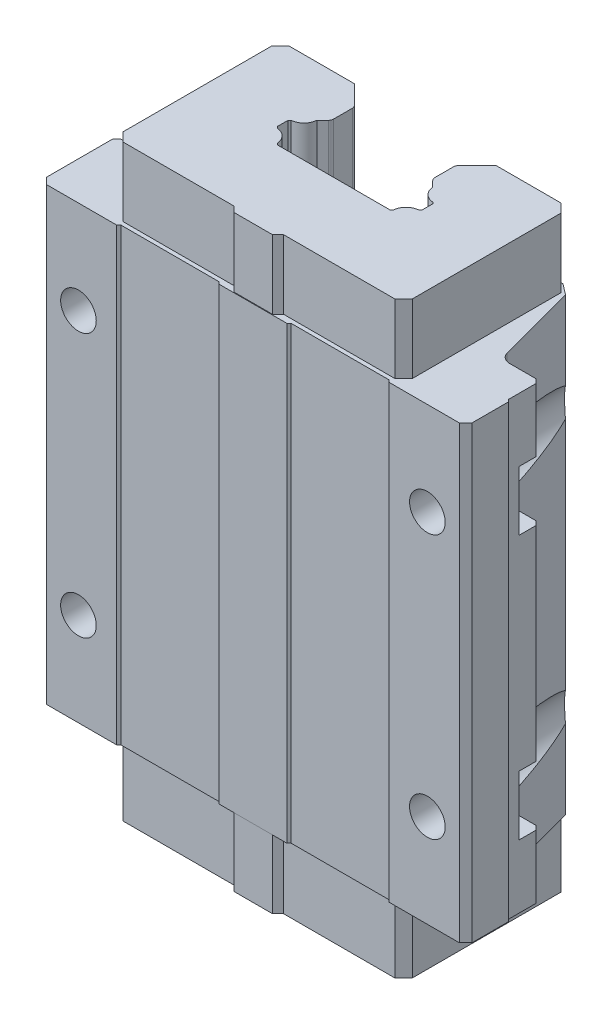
ISO-10303-21;
HEADER;
FILE_DESCRIPTION(('STEP AP214'),'2;1');
FILE_NAME('part.step','',(''),(''),'','','');
FILE_SCHEMA(('AUTOMOTIVE_DESIGN { 1 0 10303 214 1 1 1 1 }'));
ENDSEC;
DATA;
#1=APPLICATION_CONTEXT('core data for automotive mechanical design processes');
#2=APPLICATION_PROTOCOL_DEFINITION('international standard','automotive_design',2000,#1);
#3=PRODUCT_CONTEXT('',#1,'mechanical');
#4=PRODUCT('Part','Part','',(#3));
#5=PRODUCT_RELATED_PRODUCT_CATEGORY('part','',(#4));
#6=PRODUCT_DEFINITION_FORMATION('','',#4);
#7=PRODUCT_DEFINITION_CONTEXT('part definition',#1,'design');
#8=PRODUCT_DEFINITION('design','',#6,#7);
#9=PRODUCT_DEFINITION_SHAPE('','',#8);
#10=(LENGTH_UNIT() NAMED_UNIT(*) SI_UNIT(.MILLI.,.METRE.));
#11=(NAMED_UNIT(*) PLANE_ANGLE_UNIT() SI_UNIT($,.RADIAN.));
#12=(NAMED_UNIT(*) SI_UNIT($,.STERADIAN.) SOLID_ANGLE_UNIT());
#13=UNCERTAINTY_MEASURE_WITH_UNIT(LENGTH_MEASURE(1.E-05),#10,'distance_accuracy_value','');
#14=(GEOMETRIC_REPRESENTATION_CONTEXT(3) GLOBAL_UNCERTAINTY_ASSIGNED_CONTEXT((#13)) GLOBAL_UNIT_ASSIGNED_CONTEXT((#10,
#11,#12)) REPRESENTATION_CONTEXT('',''));
#15=CARTESIAN_POINT('',(0.,0.,0.));
#16=DIRECTION('',(0.,0.,1.));
#17=DIRECTION('',(1.,0.,0.));
#18=AXIS2_PLACEMENT_3D('',#15,#16,#17);
#19=CARTESIAN_POINT('',(-49.,-247.373482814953,-18.));
#20=DIRECTION('',(0.,0.,1.));
#21=DIRECTION('',(1.,0.,0.));
#22=AXIS2_PLACEMENT_3D('',#19,#20,#21);
#23=PLANE('',#22);
#24=DIRECTION('',(1.,0.,0.));
#25=VECTOR('',#24,1.);
#26=CARTESIAN_POINT('',(-49.,38.,-18.));
#27=LINE('',#26,#25);
#28=CARTESIAN_POINT('',(-49.,38.,-18.));
#29=VERTEX_POINT('',#28);
#30=CARTESIAN_POINT('',(-42.3131997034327,38.,-18.));
#31=VERTEX_POINT('',#30);
#32=EDGE_CURVE('E40',#29,#31,#27,.T.);
#33=ORIENTED_EDGE('',*,*,#32,.F.);
#34=DIRECTION('',(0.,1.,0.));
#35=VECTOR('',#34,1.);
#36=CARTESIAN_POINT('',(-49.,-247.373482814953,-18.));
#37=LINE('',#36,#35);
#38=CARTESIAN_POINT('',(-49.,52.9,-18.));
#39=VERTEX_POINT('',#38);
#40=EDGE_CURVE('E10',#29,#39,#37,.T.);
#41=ORIENTED_EDGE('',*,*,#40,.T.);
#42=DIRECTION('',(-1.,0.,0.));
#43=VECTOR('',#42,1.);
#44=CARTESIAN_POINT('',(0.,52.9,-18.));
#45=LINE('',#44,#43);
#46=CARTESIAN_POINT('',(-42.3131997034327,52.9,-18.));
#47=VERTEX_POINT('',#46);
#48=EDGE_CURVE('E1173',#47,#39,#45,.T.);
#49=ORIENTED_EDGE('',*,*,#48,.F.);
#50=DIRECTION('',(0.,1.,0.));
#51=VECTOR('',#50,1.);
#52=CARTESIAN_POINT('',(-42.3131997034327,-247.373482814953,-18.));
#53=LINE('',#52,#51);
#54=EDGE_CURVE('E1670',#31,#47,#53,.T.);
#55=ORIENTED_EDGE('',*,*,#54,.F.);
#56=EDGE_LOOP('',(#33,#41,#49,#55));
#57=FACE_BOUND('',#56,.T.);
#58=ADVANCED_FACE('F16',(#57),#23,.F.);
#59=CARTESIAN_POINT('',(-49.,-247.373482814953,-18.));
#60=DIRECTION('',(0.,0.,1.));
#61=DIRECTION('',(1.,0.,0.));
#62=AXIS2_PLACEMENT_3D('',#59,#60,#61);
#63=PLANE('',#62);
#64=DIRECTION('',(-1.,0.,0.));
#65=VECTOR('',#64,1.);
#66=CARTESIAN_POINT('',(-49.,23.9999999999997,-18.));
#67=LINE('',#66,#65);
#68=CARTESIAN_POINT('',(-42.3131997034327,23.9999999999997,-18.));
#69=VERTEX_POINT('',#68);
#70=CARTESIAN_POINT('',(-49.,23.9999999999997,-18.));
#71=VERTEX_POINT('',#70);
#72=EDGE_CURVE('E982',#69,#71,#67,.T.);
#73=ORIENTED_EDGE('',*,*,#72,.F.);
#74=DIRECTION('',(0.,1.,0.));
#75=VECTOR('',#74,1.);
#76=CARTESIAN_POINT('',(-42.3131997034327,-247.373482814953,-18.));
#77=LINE('',#76,#75);
#78=CARTESIAN_POINT('',(-42.3131997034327,-23.9999999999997,-18.));
#79=VERTEX_POINT('',#78);
#80=EDGE_CURVE('E931',#79,#69,#77,.T.);
#81=ORIENTED_EDGE('',*,*,#80,.F.);
#82=DIRECTION('',(-1.,0.,0.));
#83=VECTOR('',#82,1.);
#84=CARTESIAN_POINT('',(-49.,-23.9999999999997,-18.));
#85=LINE('',#84,#83);
#86=CARTESIAN_POINT('',(-49.,-23.9999999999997,-18.));
#87=VERTEX_POINT('',#86);
#88=EDGE_CURVE('E27',#79,#87,#85,.T.);
#89=ORIENTED_EDGE('',*,*,#88,.T.);
#90=DIRECTION('',(0.,1.,0.));
#91=VECTOR('',#90,1.);
#92=CARTESIAN_POINT('',(-49.,-247.373482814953,-18.));
#93=LINE('',#92,#91);
#94=EDGE_CURVE('E1612',#87,#71,#93,.T.);
#95=ORIENTED_EDGE('',*,*,#94,.T.);
#96=EDGE_LOOP('',(#73,#81,#89,#95));
#97=FACE_BOUND('',#96,.T.);
#98=ADVANCED_FACE('F3157',(#97),#63,.F.);
#99=CARTESIAN_POINT('',(-50.,-247.373482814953,-17.));
#100=DIRECTION('',(0.707106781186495,0.,0.7071067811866));
#101=DIRECTION('',(0.,-1.,0.));
#102=AXIS2_PLACEMENT_3D('',#99,#100,#101);
#103=PLANE('',#102);
#104=DIRECTION('',(0.7071067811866,0.,-0.707106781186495));
#105=VECTOR('',#104,1.);
#106=CARTESIAN_POINT('',(-50.,38.,-17.));
#107=LINE('',#106,#105);
#108=CARTESIAN_POINT('',(-50.,38.,-17.));
#109=VERTEX_POINT('',#108);
#110=EDGE_CURVE('E1010',#109,#29,#107,.T.);
#111=ORIENTED_EDGE('',*,*,#110,.F.);
#112=DIRECTION('',(0.,1.,0.));
#113=VECTOR('',#112,1.);
#114=CARTESIAN_POINT('',(-50.,-247.373482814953,-17.));
#115=LINE('',#114,#113);
#116=CARTESIAN_POINT('',(-50.,52.9,-17.));
#117=VERTEX_POINT('',#116);
#118=EDGE_CURVE('E1500',#109,#117,#115,.T.);
#119=ORIENTED_EDGE('',*,*,#118,.T.);
#120=DIRECTION('',(-0.7071067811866,0.,0.707106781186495));
#121=VECTOR('',#120,1.);
#122=CARTESIAN_POINT('',(-33.4999999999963,52.9,-33.5000000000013));
#123=LINE('',#122,#121);
#124=EDGE_CURVE('E1008',#39,#117,#123,.T.);
#125=ORIENTED_EDGE('',*,*,#124,.F.);
#126=ORIENTED_EDGE('',*,*,#40,.F.);
#127=EDGE_LOOP('',(#111,#119,#125,#126));
#128=FACE_BOUND('',#127,.T.);
#129=ADVANCED_FACE('F3149',(#128),#103,.F.);
#130=CARTESIAN_POINT('',(-50.,-247.373482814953,-17.));
#131=DIRECTION('',(0.707106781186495,0.,0.7071067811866));
#132=DIRECTION('',(0.,-1.,0.));
#133=AXIS2_PLACEMENT_3D('',#130,#131,#132);
#134=PLANE('',#133);
#135=DIRECTION('',(-0.7071067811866,0.,0.707106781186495));
#136=VECTOR('',#135,1.);
#137=CARTESIAN_POINT('',(-50.,23.9999999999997,-17.));
#138=LINE('',#137,#136);
#139=CARTESIAN_POINT('',(-50.,23.9999999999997,-17.));
#140=VERTEX_POINT('',#139);
#141=EDGE_CURVE('E986',#71,#140,#138,.T.);
#142=ORIENTED_EDGE('',*,*,#141,.F.);
#143=ORIENTED_EDGE('',*,*,#94,.F.);
#144=DIRECTION('',(-0.7071067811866,0.,0.707106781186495));
#145=VECTOR('',#144,1.);
#146=CARTESIAN_POINT('',(-50.,-23.9999999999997,-17.));
#147=LINE('',#146,#145);
#148=CARTESIAN_POINT('',(-50.,-23.9999999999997,-17.));
#149=VERTEX_POINT('',#148);
#150=EDGE_CURVE('E1497',#87,#149,#147,.T.);
#151=ORIENTED_EDGE('',*,*,#150,.T.);
#152=DIRECTION('',(0.,1.,0.));
#153=VECTOR('',#152,1.);
#154=CARTESIAN_POINT('',(-50.,-247.373482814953,-17.));
#155=LINE('',#154,#153);
#156=EDGE_CURVE('E1501',#149,#140,#155,.T.);
#157=ORIENTED_EDGE('',*,*,#156,.T.);
#158=EDGE_LOOP('',(#142,#143,#151,#157));
#159=FACE_BOUND('',#158,.T.);
#160=ADVANCED_FACE('F3145',(#159),#134,.F.);
#161=CARTESIAN_POINT('',(-42.3131997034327,-247.373482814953,-20.5));
#162=DIRECTION('',(0.,1.,0.));
#163=DIRECTION('',(0.,0.,1.));
#164=AXIS2_PLACEMENT_3D('',#161,#162,#163);
#165=CYLINDRICAL_SURFACE('',#164,2.5);
#166=CARTESIAN_POINT('',(-42.3131997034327,38.,-20.5));
#167=DIRECTION('',(0.,1.,0.));
#168=DIRECTION('',(1.,0.,0.));
#169=AXIS2_PLACEMENT_3D('',#166,#167,#168);
#170=CIRCLE('',#169,2.5);
#171=CARTESIAN_POINT('',(-41.,38.,-18.3726762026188));
#172=VERTEX_POINT('',#171);
#173=EDGE_CURVE('E1577',#31,#172,#170,.T.);
#174=ORIENTED_EDGE('',*,*,#173,.F.);
#175=ORIENTED_EDGE('',*,*,#54,.T.);
#176=CARTESIAN_POINT('',(-42.3131997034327,52.9,-20.5));
#177=DIRECTION('',(0.,-1.,0.));
#178=DIRECTION('',(0.,0.,1.));
#179=AXIS2_PLACEMENT_3D('',#176,#177,#178);
#180=CIRCLE('',#179,2.5);
#181=CARTESIAN_POINT('',(-39.89838513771,52.9,-19.8529523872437));
#182=VERTEX_POINT('',#181);
#183=EDGE_CURVE('E1550',#182,#47,#180,.T.);
#184=ORIENTED_EDGE('',*,*,#183,.F.);
#185=DIRECTION('',(0.,1.,0.));
#186=VECTOR('',#185,1.);
#187=CARTESIAN_POINT('',(-39.89838513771,-247.373482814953,-19.8529523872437));
#188=LINE('',#187,#186);
#189=CARTESIAN_POINT('',(-39.89838513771,37.9127740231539,-19.8529523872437));
#190=VERTEX_POINT('',#189);
#191=EDGE_CURVE('E1749',#190,#182,#188,.T.);
#192=ORIENTED_EDGE('',*,*,#191,.F.);
#193=CARTESIAN_POINT('',(-41.,38.0000000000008,-18.372676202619));
#194=CARTESIAN_POINT('',(-40.966335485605,38.0000006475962,-18.3934539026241));
#195=CARTESIAN_POINT('',(-40.9331524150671,37.9997571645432,-18.4150134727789));
#196=CARTESIAN_POINT('',(-40.8680224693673,37.9988309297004,-18.4595451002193));
#197=CARTESIAN_POINT('',(-40.8360697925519,37.9981506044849,-18.482508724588));
#198=CARTESIAN_POINT('',(-40.7734052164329,37.9964015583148,-18.5298480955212));
#199=CARTESIAN_POINT('',(-40.7426895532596,37.9953341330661,-18.5542189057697));
#200=CARTESIAN_POINT('',(-40.6825001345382,37.9928606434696,-18.6043682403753));
#201=CARTESIAN_POINT('',(-40.6530250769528,37.991454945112,-18.6301452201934));
#202=CARTESIAN_POINT('',(-40.5953169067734,37.9883522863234,-18.6831037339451));
#203=CARTESIAN_POINT('',(-40.5670853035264,37.9866549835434,-18.7102868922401));
#204=CARTESIAN_POINT('',(-40.5118626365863,37.983014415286,-18.7660545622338));
#205=CARTESIAN_POINT('',(-40.4848761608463,37.9810703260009,-18.7946435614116));
#206=CARTESIAN_POINT('',(-40.4321411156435,37.9769792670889,-18.8532201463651));
#207=CARTESIAN_POINT('',(-40.4064003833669,37.9748312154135,-18.8832147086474));
#208=CARTESIAN_POINT('',(-40.3561536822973,37.9703732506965,-18.9445999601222));
#209=CARTESIAN_POINT('',(-40.3316588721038,37.9680622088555,-18.975999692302));
#210=CARTESIAN_POINT('',(-40.284097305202,37.9633364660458,-19.0399263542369));
#211=CARTESIAN_POINT('',(-40.2610326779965,37.9609216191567,-19.0724548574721));
#212=CARTESIAN_POINT('',(-40.2166357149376,37.9560646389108,-19.1382899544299));
#213=CARTESIAN_POINT('',(-40.1952909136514,37.9536228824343,-19.1715881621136));
#214=CARTESIAN_POINT('',(-40.1543277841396,37.9487597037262,-19.2389598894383));
#215=CARTESIAN_POINT('',(-40.1346999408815,37.9463382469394,-19.2730276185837));
#216=CARTESIAN_POINT('',(-40.0971636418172,37.9415591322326,-19.3419357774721));
#217=CARTESIAN_POINT('',(-40.0792490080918,37.9392012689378,-19.3767728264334));
#218=CARTESIAN_POINT('',(-40.0451316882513,37.9345888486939,-19.4472172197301));
#219=CARTESIAN_POINT('',(-40.0289264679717,37.9323341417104,-19.4828233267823));
#220=CARTESIAN_POINT('',(-39.9982198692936,37.9279634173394,-19.5548037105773));
#221=CARTESIAN_POINT('',(-39.983719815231,37.9258475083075,-19.5911785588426));
#222=CARTESIAN_POINT('',(-39.9564164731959,37.9217862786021,-19.6646947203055));
#223=CARTESIAN_POINT('',(-39.9436184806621,37.9198414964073,-19.7018380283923));
#224=CARTESIAN_POINT('',(-39.9197080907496,37.916148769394,-19.7768895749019));
#225=CARTESIAN_POINT('',(-39.9086049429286,37.9144019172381,-19.8148008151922));
#226=CARTESIAN_POINT('',(-39.89838513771,37.912774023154,-19.8529523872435));
#227=B_SPLINE_CURVE_WITH_KNOTS('',3,(#193,#194,#195,#196,#197,#198,#199,#200,#201,#202,#203,
#204,#205,#206,#207,#208,#209,#210,#211,#212,#213,#214,#215,#216,#217,#218,#219,#220,#221,#222,
#223,#224,#225,#226),.UNSPECIFIED.,.F.,.F.,(4,2,2,2,2,2,2,2,2,2,2,2,2,2,2,2,4),(0.,
0.11867076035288,0.236687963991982,0.354313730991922,0.471812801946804,0.589450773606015,
0.707492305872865,0.826199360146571,0.945829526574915,1.06563374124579,1.18447219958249,
1.30260371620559,1.42029177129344,1.53780282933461,1.65540455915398,1.77336401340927,
1.89194582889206),.UNSPECIFIED.);
#228=EDGE_CURVE('E1666',#172,#190,#227,.T.);
#229=ORIENTED_EDGE('',*,*,#228,.F.);
#230=EDGE_LOOP('',(#174,#175,#184,#192,#229));
#231=FACE_BOUND('',#230,.T.);
#232=ADVANCED_FACE('F1366',(#231),#165,.F.);
#233=CARTESIAN_POINT('',(-42.3131997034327,-247.373482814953,-20.5));
#234=DIRECTION('',(0.,1.,0.));
#235=DIRECTION('',(0.,0.,1.));
#236=AXIS2_PLACEMENT_3D('',#233,#234,#235);
#237=CYLINDRICAL_SURFACE('',#236,2.5);
#238=CARTESIAN_POINT('',(-39.89838513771,24.087225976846,-19.852952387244));
#239=CARTESIAN_POINT('',(-39.9086050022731,24.0855980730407,-19.814800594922));
#240=CARTESIAN_POINT('',(-39.9197081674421,24.0838512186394,-19.7768891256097));
#241=CARTESIAN_POINT('',(-39.9436185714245,24.0801584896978,-19.7018367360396));
#242=CARTESIAN_POINT('',(-39.9564165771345,24.078213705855,-19.66469281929));
#243=CARTESIAN_POINT('',(-39.9837199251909,24.0741524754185,-19.5911750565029));
#244=CARTESIAN_POINT('',(-39.9982199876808,24.0720365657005,-19.5547992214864));
#245=CARTESIAN_POINT('',(-40.0289265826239,24.0676658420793,-19.4828164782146));
#246=CARTESIAN_POINT('',(-40.0451318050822,24.0654111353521,-19.4472090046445));
#247=CARTESIAN_POINT('',(-40.0792491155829,24.0607987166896,-19.3767614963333));
#248=CARTESIAN_POINT('',(-40.0971637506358,24.0584408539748,-19.3419227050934));
#249=CARTESIAN_POINT('',(-40.1347000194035,24.0536617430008,-19.2730106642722));
#250=CARTESIAN_POINT('',(-40.1543278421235,24.0512402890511,-19.2389408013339));
#251=CARTESIAN_POINT('',(-40.1952909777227,24.0463771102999,-19.1715644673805));
#252=CARTESIAN_POINT('',(-40.2166358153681,24.0439353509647,-19.1382637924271));
#253=CARTESIAN_POINT('',(-40.2610326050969,24.039078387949,-19.0724232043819));
#254=CARTESIAN_POINT('',(-40.2840970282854,24.0366635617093,-19.0398916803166));
#255=CARTESIAN_POINT('',(-40.3316512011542,24.0319385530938,-18.9759698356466));
#256=CARTESIAN_POINT('',(-40.3561383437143,24.0296281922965,-18.9445775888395));
#257=CARTESIAN_POINT('',(-40.4063719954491,24.0251712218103,-18.883205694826));
#258=CARTESIAN_POINT('',(-40.4321074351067,24.0230234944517,-18.8532170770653));
#259=CARTESIAN_POINT('',(-40.4848338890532,24.0189328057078,-18.7946505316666));
#260=CARTESIAN_POINT('',(-40.5118171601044,24.0169887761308,-18.7660657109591));
#261=CARTESIAN_POINT('',(-40.5670354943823,24.0133481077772,-18.7103045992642));
#262=CARTESIAN_POINT('',(-40.5952660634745,24.0116506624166,-18.6831239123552));
#263=CARTESIAN_POINT('',(-40.652974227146,24.0085475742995,-18.6301685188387));
#264=CARTESIAN_POINT('',(-40.6824504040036,24.0071416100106,-18.6043922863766));
#265=CARTESIAN_POINT('',(-40.7426441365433,24.0046675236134,-18.5542426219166));
#266=CARTESIAN_POINT('',(-40.7733630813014,24.0035997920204,-18.5298708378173));
#267=CARTESIAN_POINT('',(-40.8360362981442,24.0018501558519,-18.4825276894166));
#268=CARTESIAN_POINT('',(-40.8679944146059,24.001169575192,-18.4595613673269));
#269=CARTESIAN_POINT('',(-40.9331373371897,24.0002429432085,-18.415022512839));
#270=CARTESIAN_POINT('',(-40.966328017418,23.9999993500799,-18.3934585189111));
#271=CARTESIAN_POINT('',(-41.,23.9999999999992,-18.372676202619));
#272=B_SPLINE_CURVE_WITH_KNOTS('',3,(#238,#239,#240,#241,#242,#243,#244,#245,#246,#247,#248,
#249,#250,#251,#252,#253,#254,#255,#256,#257,#258,#259,#260,#261,#262,#263,#264,#265,#266,#267,
#268,#269,#270,#271),.UNSPECIFIED.,.F.,.F.,(4,2,2,2,2,2,2,2,2,2,2,2,2,2,2,2,4),(0.,
0.118582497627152,0.236543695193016,0.354148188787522,0.47166298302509,0.589355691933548,
0.70749271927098,0.82633747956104,0.946148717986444,1.06574693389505,1.18443005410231,
1.30245586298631,1.42008646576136,1.53758661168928,1.65522193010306,1.77325713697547,
1.89195427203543),.UNSPECIFIED.);
#273=CARTESIAN_POINT('',(-39.89838513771,24.0872259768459,-19.8529523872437));
#274=VERTEX_POINT('',#273);
#275=CARTESIAN_POINT('',(-41.,23.9999999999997,-18.3726762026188));
#276=VERTEX_POINT('',#275);
#277=EDGE_CURVE('E1389',#274,#276,#272,.T.);
#278=ORIENTED_EDGE('',*,*,#277,.F.);
#279=DIRECTION('',(0.,1.,0.));
#280=VECTOR('',#279,1.);
#281=CARTESIAN_POINT('',(-39.89838513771,-247.373482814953,-19.8529523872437));
#282=LINE('',#281,#280);
#283=CARTESIAN_POINT('',(-39.89838513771,-24.087225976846,-19.8529523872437));
#284=VERTEX_POINT('',#283);
#285=EDGE_CURVE('E3469',#284,#274,#282,.T.);
#286=ORIENTED_EDGE('',*,*,#285,.F.);
#287=CARTESIAN_POINT('',(-39.89838513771,-24.087225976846,-19.8529523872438));
#288=CARTESIAN_POINT('',(-39.9099885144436,-24.0853683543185,-19.809646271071));
#289=CARTESIAN_POINT('',(-39.9227539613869,-24.083320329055,-19.7666669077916));
#290=CARTESIAN_POINT('',(-39.944366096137,-24.0799209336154,-19.7004730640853));
#291=CARTESIAN_POINT('',(-39.9524208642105,-24.0786663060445,-19.6769938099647));
#292=CARTESIAN_POINT('',(-39.9697699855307,-24.0760050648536,-19.6287734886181));
#293=CARTESIAN_POINT('',(-39.979110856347,-24.0745938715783,-19.6040493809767));
#294=CARTESIAN_POINT('',(-39.9991631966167,-24.0716178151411,-19.5534161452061));
#295=CARTESIAN_POINT('',(-40.0099234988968,-24.0700488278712,-19.5275266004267));
#296=CARTESIAN_POINT('',(-40.0329502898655,-24.0667588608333,-19.4746507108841));
#297=CARTESIAN_POINT('',(-40.045267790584,-24.0650343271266,-19.4476867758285));
#298=CARTESIAN_POINT('',(-40.0695774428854,-24.061695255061,-19.3968811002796));
#299=CARTESIAN_POINT('',(-40.0814797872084,-24.0600868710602,-19.3729958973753));
#300=CARTESIAN_POINT('',(-40.1075168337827,-24.0566542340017,-19.3227760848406));
#301=CARTESIAN_POINT('',(-40.1217480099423,-24.054827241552,-19.2964915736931));
#302=CARTESIAN_POINT('',(-40.1493063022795,-24.0514045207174,-19.2477024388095));
#303=CARTESIAN_POINT('',(-40.1625241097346,-24.0498084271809,-19.225135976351));
#304=CARTESIAN_POINT('',(-40.1896612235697,-24.0466110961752,-19.1804288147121));
#305=CARTESIAN_POINT('',(-40.2035805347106,-24.045009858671,-19.1582881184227));
#306=CARTESIAN_POINT('',(-40.2321070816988,-24.0418081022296,-19.1144541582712));
#307=CARTESIAN_POINT('',(-40.2467143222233,-24.0402075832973,-19.0927608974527));
#308=CARTESIAN_POINT('',(-40.2766016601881,-24.0369913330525,-19.0498440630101));
#309=CARTESIAN_POINT('',(-40.2918817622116,-24.0353756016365,-19.0286204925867));
#310=CARTESIAN_POINT('',(-40.3255014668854,-24.0319417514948,-18.9834361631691));
#311=CARTESIAN_POINT('',(-40.3439503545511,-24.030130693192,-18.9595560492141));
#312=CARTESIAN_POINT('',(-40.3812555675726,-24.0266820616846,-18.9130344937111));
#313=CARTESIAN_POINT('',(-40.4000917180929,-24.0250413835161,-18.8903770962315));
#314=CARTESIAN_POINT('',(-40.438088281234,-24.0219155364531,-18.8462819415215));
#315=CARTESIAN_POINT('',(-40.4572295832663,-24.0204275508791,-18.8248279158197));
#316=CARTESIAN_POINT('',(-40.4957577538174,-24.0176119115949,-18.7831160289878));
#317=CARTESIAN_POINT('',(-40.5151265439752,-24.0162811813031,-18.7628416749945));
#318=CARTESIAN_POINT('',(-40.5540347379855,-24.0137789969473,-18.723462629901));
#319=CARTESIAN_POINT('',(-40.5735570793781,-24.0126043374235,-18.7043412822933));
#320=CARTESIAN_POINT('',(-40.6127013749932,-24.0104147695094,-18.6672388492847));
#321=CARTESIAN_POINT('',(-40.6323072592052,-24.0093964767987,-18.6492410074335));
#322=CARTESIAN_POINT('',(-40.6715515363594,-24.0075197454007,-18.6143537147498));
#323=CARTESIAN_POINT('',(-40.6911748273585,-24.0066577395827,-18.5974474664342));
#324=CARTESIAN_POINT('',(-40.7303906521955,-24.0050937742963,-18.5647093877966));
#325=CARTESIAN_POINT('',(-40.7499690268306,-24.0043880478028,-18.548860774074));
#326=CARTESIAN_POINT('',(-40.7890356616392,-24.003136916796,-18.5182021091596));
#327=CARTESIAN_POINT('',(-40.8085106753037,-24.0025875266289,-18.5033753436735));
#328=CARTESIAN_POINT('',(-40.8473146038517,-24.0016490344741,-18.474723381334));
#329=CARTESIAN_POINT('',(-40.8666311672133,-24.0012557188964,-18.460881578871));
#330=CARTESIAN_POINT('',(-40.9234026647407,-24.0003323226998,-18.4214129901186));
#331=CARTESIAN_POINT('',(-40.9613727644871,-24.000003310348,-18.3965200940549));
#332=CARTESIAN_POINT('',(-41.,-23.999999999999,-18.3726762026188));
#333=B_SPLINE_CURVE_WITH_KNOTS('',3,(#287,#288,#289,#290,#291,#292,#293,#294,#295,#296,#297,
#298,#299,#300,#301,#302,#303,#304,#305,#306,#307,#308,#309,#310,#311,#312,#313,#314,#315,#316,
#317,#318,#319,#320,#321,#322,#323,#324,#325,#326,#327,#328,#329,#330,#331,#332),.UNSPECIFIED.,
.F.,.F.,(4,2,2,2,2,2,2,2,2,2,2,2,2,2,2,2,2,2,2,2,2,2,4),(0.,0.13458465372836,0.209136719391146,
0.288525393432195,0.372751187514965,0.461814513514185,0.54200627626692,0.631823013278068,
0.710414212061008,0.789005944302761,0.867598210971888,0.946191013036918,1.03686294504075,
1.12537493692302,1.21172835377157,1.29592466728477,1.3779654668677,1.45785247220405,
1.53558754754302,1.61117271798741,1.68461018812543,1.75590236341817,1.89204823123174),.UNSPECIFIED.);
#334=CARTESIAN_POINT('',(-41.,-23.9999999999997,-18.3726762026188));
#335=VERTEX_POINT('',#334);
#336=EDGE_CURVE('E1348',#284,#335,#333,.T.);
#337=ORIENTED_EDGE('',*,*,#336,.T.);
#338=CARTESIAN_POINT('',(-42.3131997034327,-23.9999999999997,-20.5));
#339=DIRECTION('',(0.,-1.,0.));
#340=DIRECTION('',(-1.,0.,0.));
#341=AXIS2_PLACEMENT_3D('',#338,#339,#340);
#342=CIRCLE('',#341,2.5);
#343=EDGE_CURVE('E3484',#335,#79,#342,.T.);
#344=ORIENTED_EDGE('',*,*,#343,.T.);
#345=ORIENTED_EDGE('',*,*,#80,.T.);
#346=CARTESIAN_POINT('',(-42.3131997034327,23.9999999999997,-20.5));
#347=DIRECTION('',(0.,-1.,0.));
#348=DIRECTION('',(-1.,0.,0.));
#349=AXIS2_PLACEMENT_3D('',#346,#347,#348);
#350=CIRCLE('',#349,2.5);
#351=EDGE_CURVE('E985',#276,#69,#350,.T.);
#352=ORIENTED_EDGE('',*,*,#351,.F.);
#353=EDGE_LOOP('',(#278,#286,#337,#344,#345,#352));
#354=FACE_BOUND('',#353,.T.);
#355=ADVANCED_FACE('F1355',(#354),#237,.F.);
#356=CARTESIAN_POINT('',(-39.89838513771,-247.373482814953,-19.8529523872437));
#357=DIRECTION('',(0.965925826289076,0.,0.258819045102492));
#358=DIRECTION('',(0.,-1.,0.));
#359=AXIS2_PLACEMENT_3D('',#356,#357,#358);
#360=PLANE('',#359);
#361=CARTESIAN_POINT('',(-41.,31.,-15.7416697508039));
#362=DIRECTION('',(-0.965925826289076,0.,-0.258819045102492));
#363=DIRECTION('',(-0.258819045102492,0.,0.965925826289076));
#364=AXIS2_PLACEMENT_3D('',#361,#362,#363);
#365=ELLIPSE('',#364,27.0459231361,7.0000000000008);
#366=CARTESIAN_POINT('',(-34.8836634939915,34.4044717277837,-38.5681483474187));
#367=VERTEX_POINT('',#366);
#368=EDGE_CURVE('E2013',#190,#367,#365,.T.);
#369=ORIENTED_EDGE('',*,*,#368,.F.);
#370=ORIENTED_EDGE('',*,*,#191,.T.);
#371=DIRECTION('',(-0.258819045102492,0.,0.965925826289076));
#372=VECTOR('',#371,1.);
#373=CARTESIAN_POINT('',(-42.1889382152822,52.9,-11.30449192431));
#374=LINE('',#373,#372);
#375=CARTESIAN_POINT('',(-34.8836634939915,52.9,-38.5681483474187));
#376=VERTEX_POINT('',#375);
#377=EDGE_CURVE('E1546',#376,#182,#374,.T.);
#378=ORIENTED_EDGE('',*,*,#377,.F.);
#379=DIRECTION('',(0.,1.,0.));
#380=VECTOR('',#379,1.);
#381=CARTESIAN_POINT('',(-34.8836634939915,-247.373482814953,-38.5681483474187));
#382=LINE('',#381,#380);
#383=EDGE_CURVE('E1640',#367,#376,#382,.T.);
#384=ORIENTED_EDGE('',*,*,#383,.F.);
#385=EDGE_LOOP('',(#369,#370,#378,#384));
#386=FACE_BOUND('',#385,.T.);
#387=ADVANCED_FACE('F1365',(#386),#360,.F.);
#388=CARTESIAN_POINT('',(-50.,-247.373482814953,-17.));
#389=DIRECTION('',(1.,0.,0.));
#390=DIRECTION('',(0.,0.,-1.));
#391=AXIS2_PLACEMENT_3D('',#388,#389,#390);
#392=PLANE('',#391);
#393=DIRECTION('',(0.,0.,-1.));
#394=VECTOR('',#393,1.);
#395=CARTESIAN_POINT('',(-50.,38.,-17.));
#396=LINE('',#395,#394);
#397=CARTESIAN_POINT('',(-50.,38.,-13.));
#398=VERTEX_POINT('',#397);
#399=EDGE_CURVE('E1014',#398,#109,#396,.T.);
#400=ORIENTED_EDGE('',*,*,#399,.F.);
#401=DIRECTION('',(0.,1.,0.));
#402=VECTOR('',#401,1.);
#403=CARTESIAN_POINT('',(-50.,-247.373482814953,-13.));
#404=LINE('',#403,#402);
#405=CARTESIAN_POINT('',(-50.,23.9999999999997,-13.));
#406=VERTEX_POINT('',#405);
#407=EDGE_CURVE('E1634',#406,#398,#404,.T.);
#408=ORIENTED_EDGE('',*,*,#407,.F.);
#409=DIRECTION('',(0.,0.,1.));
#410=VECTOR('',#409,1.);
#411=CARTESIAN_POINT('',(-50.,23.9999999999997,-17.));
#412=LINE('',#411,#410);
#413=EDGE_CURVE('E1422',#140,#406,#412,.T.);
#414=ORIENTED_EDGE('',*,*,#413,.F.);
#415=ORIENTED_EDGE('',*,*,#156,.F.);
#416=DIRECTION('',(0.,0.,1.));
#417=VECTOR('',#416,1.);
#418=CARTESIAN_POINT('',(-50.,-23.9999999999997,-17.));
#419=LINE('',#418,#417);
#420=CARTESIAN_POINT('',(-50.,-23.9999999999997,-13.));
#421=VERTEX_POINT('',#420);
#422=EDGE_CURVE('E1273',#149,#421,#419,.T.);
#423=ORIENTED_EDGE('',*,*,#422,.T.);
#424=DIRECTION('',(0.,-1.,0.));
#425=VECTOR('',#424,1.);
#426=CARTESIAN_POINT('',(-50.,-247.373482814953,-13.));
#427=LINE('',#426,#425);
#428=CARTESIAN_POINT('',(-50.,-38.,-13.));
#429=VERTEX_POINT('',#428);
#430=EDGE_CURVE('E1269',#421,#429,#427,.T.);
#431=ORIENTED_EDGE('',*,*,#430,.T.);
#432=DIRECTION('',(0.,0.,-1.));
#433=VECTOR('',#432,1.);
#434=CARTESIAN_POINT('',(-50.,-38.,-17.));
#435=LINE('',#434,#433);
#436=CARTESIAN_POINT('',(-50.,-38.,-17.));
#437=VERTEX_POINT('',#436);
#438=EDGE_CURVE('E1274',#429,#437,#435,.T.);
#439=ORIENTED_EDGE('',*,*,#438,.T.);
#440=DIRECTION('',(0.,1.,0.));
#441=VECTOR('',#440,1.);
#442=CARTESIAN_POINT('',(-50.,-247.373482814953,-17.));
#443=LINE('',#442,#441);
#444=CARTESIAN_POINT('',(-50.,-52.9,-17.));
#445=VERTEX_POINT('',#444);
#446=EDGE_CURVE('E978',#445,#437,#443,.T.);
#447=ORIENTED_EDGE('',*,*,#446,.F.);
#448=DIRECTION('',(0.,0.,-1.));
#449=VECTOR('',#448,1.);
#450=CARTESIAN_POINT('',(-50.,-52.9,0.));
#451=LINE('',#450,#449);
#452=CARTESIAN_POINT('',(-50.,-52.9,-1.5));
#453=VERTEX_POINT('',#452);
#454=EDGE_CURVE('E937',#453,#445,#451,.T.);
#455=ORIENTED_EDGE('',*,*,#454,.F.);
#456=DIRECTION('',(0.,1.,0.));
#457=VECTOR('',#456,1.);
#458=CARTESIAN_POINT('',(-50.,-247.373482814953,-1.5));
#459=LINE('',#458,#457);
#460=CARTESIAN_POINT('',(-50.,52.9,-1.5));
#461=VERTEX_POINT('',#460);
#462=EDGE_CURVE('E1521',#453,#461,#459,.T.);
#463=ORIENTED_EDGE('',*,*,#462,.T.);
#464=DIRECTION('',(0.,0.,1.));
#465=VECTOR('',#464,1.);
#466=CARTESIAN_POINT('',(-50.,52.9,0.));
#467=LINE('',#466,#465);
#468=EDGE_CURVE('E1005',#117,#461,#467,.T.);
#469=ORIENTED_EDGE('',*,*,#468,.F.);
#470=ORIENTED_EDGE('',*,*,#118,.F.);
#471=EDGE_LOOP('',(#400,#408,#414,#415,#423,#431,#439,#447,#455,#463,#469,#470));
#472=FACE_BOUND('',#471,.T.);
#473=ADVANCED_FACE('F2141',(#472),#392,.F.);
#474=CARTESIAN_POINT('',(-41.,31.,0.));
#475=DIRECTION('',(0.,0.,-1.));
#476=DIRECTION('',(0.,-1.,0.));
#477=AXIS2_PLACEMENT_3D('',#474,#475,#476);
#478=CYLINDRICAL_SURFACE('',#477,4.188);
#479=CARTESIAN_POINT('',(-41.,31.,0.));
#480=DIRECTION('',(0.,0.,-1.));
#481=DIRECTION('',(0.,-1.,0.));
#482=AXIS2_PLACEMENT_3D('',#479,#480,#481);
#483=CIRCLE('',#482,4.188);
#484=CARTESIAN_POINT('',(-41.,26.812,0.));
#485=VERTEX_POINT('',#484);
#486=EDGE_CURVE('E1695',#485,#485,#483,.T.);
#487=ORIENTED_EDGE('',*,*,#486,.F.);
#488=EDGE_LOOP('',(#487));
#489=FACE_BOUND('',#488,.T.);
#490=CARTESIAN_POINT('',(-41.,31.,-13.));
#491=DIRECTION('',(0.,0.,1.));
#492=DIRECTION('',(-1.,0.,0.));
#493=AXIS2_PLACEMENT_3D('',#490,#491,#492);
#494=CIRCLE('',#493,4.188);
#495=CARTESIAN_POINT('',(-45.188,31.,-13.));
#496=VERTEX_POINT('',#495);
#497=EDGE_CURVE('E1425',#496,#496,#494,.T.);
#498=ORIENTED_EDGE('',*,*,#497,.F.);
#499=EDGE_LOOP('',(#498));
#500=FACE_BOUND('',#499,.T.);
#501=ADVANCED_FACE('F2137',(#489,#500),#478,.F.);
#502=CARTESIAN_POINT('',(-39.89838513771,-247.373482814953,-19.8529523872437));
#503=DIRECTION('',(0.965925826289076,0.,0.258819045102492));
#504=DIRECTION('',(0.,-1.,0.));
#505=AXIS2_PLACEMENT_3D('',#502,#503,#504);
#506=PLANE('',#505);
#507=DIRECTION('',(0.,1.,0.));
#508=VECTOR('',#507,1.);
#509=CARTESIAN_POINT('',(-39.89838513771,-247.373482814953,-19.8529523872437));
#510=LINE('',#509,#508);
#511=CARTESIAN_POINT('',(-39.89838513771,-52.9,-19.8529523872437));
#512=VERTEX_POINT('',#511);
#513=CARTESIAN_POINT('',(-39.89838513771,-37.912774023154,-19.8529523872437));
#514=VERTEX_POINT('',#513);
#515=EDGE_CURVE('E1525',#512,#514,#510,.T.);
#516=ORIENTED_EDGE('',*,*,#515,.T.);
#517=CARTESIAN_POINT('',(-41.,-31.,-15.7416697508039));
#518=DIRECTION('',(0.965925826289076,0.,0.258819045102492));
#519=DIRECTION('',(-0.258819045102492,0.,0.965925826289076));
#520=AXIS2_PLACEMENT_3D('',#517,#518,#519);
#521=ELLIPSE('',#520,27.0459231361,7.0000000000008);
#522=CARTESIAN_POINT('',(-34.8836634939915,-34.4044717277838,-38.5681483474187));
#523=VERTEX_POINT('',#522);
#524=EDGE_CURVE('E3560',#514,#523,#521,.T.);
#525=ORIENTED_EDGE('',*,*,#524,.T.);
#526=DIRECTION('',(0.,1.,0.));
#527=VECTOR('',#526,1.);
#528=CARTESIAN_POINT('',(-34.8836634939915,-247.373482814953,-38.5681483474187));
#529=LINE('',#528,#527);
#530=CARTESIAN_POINT('',(-34.8836634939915,-52.9,-38.5681483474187));
#531=VERTEX_POINT('',#530);
#532=EDGE_CURVE('E1858',#531,#523,#529,.T.);
#533=ORIENTED_EDGE('',*,*,#532,.F.);
#534=DIRECTION('',(0.258819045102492,0.,-0.965925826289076));
#535=VECTOR('',#534,1.);
#536=CARTESIAN_POINT('',(-42.1889382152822,-52.9,-11.30449192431));
#537=LINE('',#536,#535);
#538=EDGE_CURVE('E1283',#512,#531,#537,.T.);
#539=ORIENTED_EDGE('',*,*,#538,.F.);
#540=EDGE_LOOP('',(#516,#525,#533,#539));
#541=FACE_BOUND('',#540,.T.);
#542=ADVANCED_FACE('F2140',(#541),#506,.F.);
#543=CARTESIAN_POINT('',(42.3131997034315,-247.373482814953,-20.5));
#544=DIRECTION('',(0.,1.,0.));
#545=DIRECTION('',(0.,0.,1.));
#546=AXIS2_PLACEMENT_3D('',#543,#544,#545);
#547=CYLINDRICAL_SURFACE('',#546,2.5);
#548=CARTESIAN_POINT('',(39.8983851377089,-24.0872259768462,-19.852952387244));
#549=CARTESIAN_POINT('',(39.9086050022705,-24.0855980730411,-19.8148005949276));
#550=CARTESIAN_POINT('',(39.919708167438,-24.0838512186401,-19.776889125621));
#551=CARTESIAN_POINT('',(39.9436185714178,-24.0801584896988,-19.7018367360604));
#552=CARTESIAN_POINT('',(39.9564165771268,-24.0782137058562,-19.6646928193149));
#553=CARTESIAN_POINT('',(39.9837199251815,-24.0741524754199,-19.5911750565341));
#554=CARTESIAN_POINT('',(39.9982199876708,-24.0720365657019,-19.55479922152));
#555=CARTESIAN_POINT('',(40.0289265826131,-24.0676658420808,-19.4828164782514));
#556=CARTESIAN_POINT('',(40.0451318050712,-24.0654111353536,-19.4472090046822));
#557=CARTESIAN_POINT('',(40.0792491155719,-24.060798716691,-19.3767614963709));
#558=CARTESIAN_POINT('',(40.0971637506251,-24.0584408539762,-19.3419227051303));
#559=CARTESIAN_POINT('',(40.1347000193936,-24.053661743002,-19.2730106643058));
#560=CARTESIAN_POINT('',(40.1543278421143,-24.0512402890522,-19.238940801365));
#561=CARTESIAN_POINT('',(40.1952909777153,-24.0463771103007,-19.1715644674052));
#562=CARTESIAN_POINT('',(40.2166358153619,-24.0439353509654,-19.1382637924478));
#563=CARTESIAN_POINT('',(40.2610326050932,-24.0390783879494,-19.0724232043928));
#564=CARTESIAN_POINT('',(40.2840970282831,-24.0366635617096,-19.0398916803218));
#565=CARTESIAN_POINT('',(40.3316512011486,-24.0319385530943,-18.9759698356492));
#566=CARTESIAN_POINT('',(40.3561383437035,-24.0296281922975,-18.9445775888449));
#567=CARTESIAN_POINT('',(40.4063719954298,-24.025171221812,-18.8832056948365));
#568=CARTESIAN_POINT('',(40.4321074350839,-24.0230234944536,-18.8532170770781));
#569=CARTESIAN_POINT('',(40.4848338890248,-24.0189328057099,-18.7946505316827));
#570=CARTESIAN_POINT('',(40.5118171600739,-24.0169887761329,-18.7660657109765));
#571=CARTESIAN_POINT('',(40.567035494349,-24.0133481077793,-18.7103045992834));
#572=CARTESIAN_POINT('',(40.5952660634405,-24.0116506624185,-18.6831239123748));
#573=CARTESIAN_POINT('',(40.6529742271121,-24.0085475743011,-18.6301685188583));
#574=CARTESIAN_POINT('',(40.6824504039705,-24.0071416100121,-18.6043922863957));
#575=CARTESIAN_POINT('',(40.7426441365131,-24.0046675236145,-18.5542426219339));
#576=CARTESIAN_POINT('',(40.7733630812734,-24.0035997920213,-18.5298708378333));
#577=CARTESIAN_POINT('',(40.8360362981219,-24.0018501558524,-18.4825276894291));
#578=CARTESIAN_POINT('',(40.8679944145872,-24.0011695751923,-18.4595613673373));
#579=CARTESIAN_POINT('',(40.9331373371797,-24.0002429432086,-18.4150225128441));
#580=CARTESIAN_POINT('',(40.966328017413,-23.9999993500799,-18.3934585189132));
#581=CARTESIAN_POINT('',(41.,-23.9999999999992,-18.372676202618));
#582=B_SPLINE_CURVE_WITH_KNOTS('',3,(#548,#549,#550,#551,#552,#553,#554,#555,#556,#557,#558,
#559,#560,#561,#562,#563,#564,#565,#566,#567,#568,#569,#570,#571,#572,#573,#574,#575,#576,#577,
#578,#579,#580,#581),.UNSPECIFIED.,.F.,.F.,(4,2,2,2,2,2,2,2,2,2,2,2,2,2,2,2,4),(0.,
0.11858249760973,0.236543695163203,0.35414818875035,0.47166298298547,0.589355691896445,
0.707492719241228,0.826337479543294,0.946148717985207,1.0657469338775,1.18443005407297,
1.30245586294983,1.42008646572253,1.53758661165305,1.6552219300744,1.77325713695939,
1.89195427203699),.UNSPECIFIED.);
#583=CARTESIAN_POINT('',(39.8983851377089,-24.0872259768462,-19.8529523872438));
#584=VERTEX_POINT('',#583);
#585=CARTESIAN_POINT('',(41.,-23.9999999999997,-18.3726762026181));
#586=VERTEX_POINT('',#585);
#587=EDGE_CURVE('E1931',#584,#586,#582,.T.);
#588=ORIENTED_EDGE('',*,*,#587,.F.);
#589=DIRECTION('',(0.,1.,0.));
#590=VECTOR('',#589,1.);
#591=CARTESIAN_POINT('',(39.8983851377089,-247.373482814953,-19.8529523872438));
#592=LINE('',#591,#590);
#593=CARTESIAN_POINT('',(39.8983851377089,24.0872259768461,-19.8529523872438));
#594=VERTEX_POINT('',#593);
#595=EDGE_CURVE('E3566',#584,#594,#592,.T.);
#596=ORIENTED_EDGE('',*,*,#595,.T.);
#597=CARTESIAN_POINT('',(39.8983851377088,24.087225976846,-19.8529523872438));
#598=CARTESIAN_POINT('',(39.9099885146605,24.0853683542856,-19.809646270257));
#599=CARTESIAN_POINT('',(39.9227539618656,24.0833203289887,-19.7666669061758));
#600=CARTESIAN_POINT('',(39.9443660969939,24.0799209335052,-19.7004730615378));
#601=CARTESIAN_POINT('',(39.9524208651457,24.078666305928,-19.6769938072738));
#602=CARTESIAN_POINT('',(39.9697699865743,24.0760050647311,-19.6287734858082));
#603=CARTESIAN_POINT('',(39.9791108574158,24.0745938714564,-19.6040493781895));
#604=CARTESIAN_POINT('',(39.9991631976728,24.0716178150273,-19.5534161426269));
#605=CARTESIAN_POINT('',(40.0099234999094,24.0700488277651,-19.5275265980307));
#606=CARTESIAN_POINT('',(40.0329502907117,24.0667588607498,-19.47465070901));
#607=CARTESIAN_POINT('',(40.0452677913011,24.0650343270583,-19.4476867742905));
#608=CARTESIAN_POINT('',(40.0695774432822,24.0616952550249,-19.3968810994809));
#609=CARTESIAN_POINT('',(40.0814797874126,24.0600868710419,-19.3729958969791));
#610=CARTESIAN_POINT('',(40.1075168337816,24.056654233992,-19.3227760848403));
#611=CARTESIAN_POINT('',(40.1217480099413,24.0548272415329,-19.2964915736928));
#612=CARTESIAN_POINT('',(40.1493063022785,24.0514045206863,-19.2477024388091));
#613=CARTESIAN_POINT('',(40.1625241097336,24.0498084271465,-19.2251359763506));
#614=CARTESIAN_POINT('',(40.1896612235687,24.0466110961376,-19.1804288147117));
#615=CARTESIAN_POINT('',(40.2035805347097,24.0450098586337,-19.1582881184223));
#616=CARTESIAN_POINT('',(40.2321070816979,24.0418081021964,-19.1144541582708));
#617=CARTESIAN_POINT('',(40.2467143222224,24.040207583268,-19.0927608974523));
#618=CARTESIAN_POINT('',(40.2766016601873,24.0369913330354,-19.0498440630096));
#619=CARTESIAN_POINT('',(40.2918817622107,24.0353756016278,-19.0286204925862));
#620=CARTESIAN_POINT('',(40.3255014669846,24.0319417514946,-18.9834361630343));
#621=CARTESIAN_POINT('',(40.343950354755,24.0301306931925,-18.9595560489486));
#622=CARTESIAN_POINT('',(40.3812555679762,24.0266820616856,-18.9130344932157));
#623=CARTESIAN_POINT('',(40.4000917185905,24.0250413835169,-18.8903770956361));
#624=CARTESIAN_POINT('',(40.4380882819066,24.0219155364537,-18.8462819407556));
#625=CARTESIAN_POINT('',(40.457229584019,24.0204275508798,-18.8248279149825));
#626=CARTESIAN_POINT('',(40.4957577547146,24.0176119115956,-18.7831160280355));
#627=CARTESIAN_POINT('',(40.5151265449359,24.0162811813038,-18.7628416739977));
#628=CARTESIAN_POINT('',(40.5540347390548,24.0137789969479,-18.7234626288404));
#629=CARTESIAN_POINT('',(40.5735570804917,24.0126043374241,-18.7043412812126));
#630=CARTESIAN_POINT('',(40.6127013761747,24.01041476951,-18.6672388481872));
#631=CARTESIAN_POINT('',(40.6323072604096,24.0093964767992,-18.6492410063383));
#632=CARTESIAN_POINT('',(40.6715515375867,24.0075197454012,-18.6143537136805));
#633=CARTESIAN_POINT('',(40.6911748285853,24.0066577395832,-18.5974474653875));
#634=CARTESIAN_POINT('',(40.7303906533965,24.0050937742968,-18.564709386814));
#635=CARTESIAN_POINT('',(40.7499690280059,24.0043880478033,-18.548860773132));
#636=CARTESIAN_POINT('',(40.7890356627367,24.0031369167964,-18.5182021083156));
#637=CARTESIAN_POINT('',(40.8085106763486,24.0025875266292,-18.503375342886));
#638=CARTESIAN_POINT('',(40.847314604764,24.0016490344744,-18.4747233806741));
#639=CARTESIAN_POINT('',(40.8666311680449,24.0012557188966,-18.4608815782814));
#640=CARTESIAN_POINT('',(40.9234026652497,24.0003323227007,-18.4214129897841));
#641=CARTESIAN_POINT('',(40.961372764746,24.0000033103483,-18.3965200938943));
#642=CARTESIAN_POINT('',(41.,23.999999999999,-18.3726762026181));
#643=B_SPLINE_CURVE_WITH_KNOTS('',3,(#597,#598,#599,#600,#601,#602,#603,#604,#605,#606,#607,
#608,#609,#610,#611,#612,#613,#614,#615,#616,#617,#618,#619,#620,#621,#622,#623,#624,#625,#626,
#627,#628,#629,#630,#631,#632,#633,#634,#635,#636,#637,#638,#639,#640,#641,#642),.UNSPECIFIED.,
.F.,.F.,(4,2,2,2,2,2,2,2,2,2,2,2,2,2,2,2,2,2,2,2,2,2,4),(0.,0.134584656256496,0.20913672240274,
0.288525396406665,0.372751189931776,0.461814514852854,0.542006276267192,0.631823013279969,
0.710414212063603,0.789005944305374,0.86759821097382,0.946191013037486,1.03686294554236,
1.12537493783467,1.21172835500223,1.29592466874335,1.37796546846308,1.45785247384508,
1.5355875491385,1.61117271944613,1.68461018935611,1.75590236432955,1.89204823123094),.UNSPECIFIED.);
#644=CARTESIAN_POINT('',(41.,23.9999999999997,-18.3726762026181));
#645=VERTEX_POINT('',#644);
#646=EDGE_CURVE('E3497',#594,#645,#643,.T.);
#647=ORIENTED_EDGE('',*,*,#646,.T.);
#648=CARTESIAN_POINT('',(42.3131997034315,23.9999999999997,-20.5));
#649=DIRECTION('',(0.,1.,0.));
#650=DIRECTION('',(1.,0.,0.));
#651=AXIS2_PLACEMENT_3D('',#648,#649,#650);
#652=CIRCLE('',#651,2.5);
#653=CARTESIAN_POINT('',(42.3131997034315,23.9999999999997,-18.));
#654=VERTEX_POINT('',#653);
#655=EDGE_CURVE('E1677',#645,#654,#652,.T.);
#656=ORIENTED_EDGE('',*,*,#655,.T.);
#657=DIRECTION('',(0.,1.,0.));
#658=VECTOR('',#657,1.);
#659=CARTESIAN_POINT('',(42.3131997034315,-247.373482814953,-18.));
#660=LINE('',#659,#658);
#661=CARTESIAN_POINT('',(42.3131997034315,-23.9999999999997,-18.));
#662=VERTEX_POINT('',#661);
#663=EDGE_CURVE('E1690',#662,#654,#660,.T.);
#664=ORIENTED_EDGE('',*,*,#663,.F.);
#665=CARTESIAN_POINT('',(42.3131997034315,-23.9999999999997,-20.5));
#666=DIRECTION('',(0.,1.,0.));
#667=DIRECTION('',(1.,0.,0.));
#668=AXIS2_PLACEMENT_3D('',#665,#666,#667);
#669=CIRCLE('',#668,2.5);
#670=EDGE_CURVE('E1916',#586,#662,#669,.T.);
#671=ORIENTED_EDGE('',*,*,#670,.F.);
#672=EDGE_LOOP('',(#588,#596,#647,#656,#664,#671));
#673=FACE_BOUND('',#672,.T.);
#674=ADVANCED_FACE('F2165',(#673),#547,.F.);
#675=CARTESIAN_POINT('',(49.5,-247.373482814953,-10.6));
#676=DIRECTION('',(-1.,0.,0.));
#677=DIRECTION('',(0.,0.,1.));
#678=AXIS2_PLACEMENT_3D('',#675,#676,#677);
#679=PLANE('',#678);
#680=DIRECTION('',(0.,0.,1.));
#681=VECTOR('',#680,1.);
#682=CARTESIAN_POINT('',(49.5,-23.9999999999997,-10.6));
#683=LINE('',#682,#681);
#684=CARTESIAN_POINT('',(49.5,-23.9999999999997,-17.));
#685=VERTEX_POINT('',#684);
#686=CARTESIAN_POINT('',(49.5,-23.9999999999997,-13.));
#687=VERTEX_POINT('',#686);
#688=EDGE_CURVE('E1545',#685,#687,#683,.T.);
#689=ORIENTED_EDGE('',*,*,#688,.F.);
#690=DIRECTION('',(0.,1.,0.));
#691=VECTOR('',#690,1.);
#692=CARTESIAN_POINT('',(49.5,-247.373482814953,-17.));
#693=LINE('',#692,#691);
#694=CARTESIAN_POINT('',(49.5,23.9999999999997,-17.));
#695=VERTEX_POINT('',#694);
#696=EDGE_CURVE('E995',#685,#695,#693,.T.);
#697=ORIENTED_EDGE('',*,*,#696,.T.);
#698=DIRECTION('',(0.,0.,1.));
#699=VECTOR('',#698,1.);
#700=CARTESIAN_POINT('',(49.5,23.9999999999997,-10.6));
#701=LINE('',#700,#699);
#702=CARTESIAN_POINT('',(49.5,23.9999999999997,-13.));
#703=VERTEX_POINT('',#702);
#704=EDGE_CURVE('E991',#695,#703,#701,.T.);
#705=ORIENTED_EDGE('',*,*,#704,.T.);
#706=DIRECTION('',(0.,1.,0.));
#707=VECTOR('',#706,1.);
#708=CARTESIAN_POINT('',(49.5,-247.373482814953,-13.));
#709=LINE('',#708,#707);
#710=CARTESIAN_POINT('',(49.5,38.,-13.));
#711=VERTEX_POINT('',#710);
#712=EDGE_CURVE('E953',#703,#711,#709,.T.);
#713=ORIENTED_EDGE('',*,*,#712,.T.);
#714=DIRECTION('',(0.,0.,-1.));
#715=VECTOR('',#714,1.);
#716=CARTESIAN_POINT('',(49.5,38.,-10.6));
#717=LINE('',#716,#715);
#718=CARTESIAN_POINT('',(49.5,38.,-17.));
#719=VERTEX_POINT('',#718);
#720=EDGE_CURVE('E949',#711,#719,#717,.T.);
#721=ORIENTED_EDGE('',*,*,#720,.T.);
#722=DIRECTION('',(0.,1.,0.));
#723=VECTOR('',#722,1.);
#724=CARTESIAN_POINT('',(49.5,-247.373482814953,-17.));
#725=LINE('',#724,#723);
#726=CARTESIAN_POINT('',(49.5,52.9,-17.));
#727=VERTEX_POINT('',#726);
#728=EDGE_CURVE('E954',#719,#727,#725,.T.);
#729=ORIENTED_EDGE('',*,*,#728,.T.);
#730=DIRECTION('',(0.,0.,-1.));
#731=VECTOR('',#730,1.);
#732=CARTESIAN_POINT('',(49.5,52.9,0.));
#733=LINE('',#732,#731);
#734=CARTESIAN_POINT('',(49.5,52.9,-10.6));
#735=VERTEX_POINT('',#734);
#736=EDGE_CURVE('E1264',#735,#727,#733,.T.);
#737=ORIENTED_EDGE('',*,*,#736,.F.);
#738=DIRECTION('',(0.,1.,0.));
#739=VECTOR('',#738,1.);
#740=CARTESIAN_POINT('',(49.5,-247.373482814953,-10.6));
#741=LINE('',#740,#739);
#742=CARTESIAN_POINT('',(49.5,-52.9,-10.6));
#743=VERTEX_POINT('',#742);
#744=EDGE_CURVE('E943',#743,#735,#741,.T.);
#745=ORIENTED_EDGE('',*,*,#744,.F.);
#746=DIRECTION('',(0.,0.,1.));
#747=VECTOR('',#746,1.);
#748=CARTESIAN_POINT('',(49.5,-52.9,0.));
#749=LINE('',#748,#747);
#750=CARTESIAN_POINT('',(49.5,-52.9,-17.));
#751=VERTEX_POINT('',#750);
#752=EDGE_CURVE('E1060',#751,#743,#749,.T.);
#753=ORIENTED_EDGE('',*,*,#752,.F.);
#754=DIRECTION('',(0.,1.,0.));
#755=VECTOR('',#754,1.);
#756=CARTESIAN_POINT('',(49.5,-247.373482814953,-17.));
#757=LINE('',#756,#755);
#758=CARTESIAN_POINT('',(49.5,-38.,-17.));
#759=VERTEX_POINT('',#758);
#760=EDGE_CURVE('E1228',#751,#759,#757,.T.);
#761=ORIENTED_EDGE('',*,*,#760,.T.);
#762=DIRECTION('',(0.,0.,-1.));
#763=VECTOR('',#762,1.);
#764=CARTESIAN_POINT('',(49.5,-38.,-10.6));
#765=LINE('',#764,#763);
#766=CARTESIAN_POINT('',(49.5,-38.,-13.));
#767=VERTEX_POINT('',#766);
#768=EDGE_CURVE('E1542',#767,#759,#765,.T.);
#769=ORIENTED_EDGE('',*,*,#768,.F.);
#770=DIRECTION('',(0.,-1.,0.));
#771=VECTOR('',#770,1.);
#772=CARTESIAN_POINT('',(49.5,-247.373482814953,-13.));
#773=LINE('',#772,#771);
#774=EDGE_CURVE('E1643',#687,#767,#773,.T.);
#775=ORIENTED_EDGE('',*,*,#774,.F.);
#776=EDGE_LOOP('',(#689,#697,#705,#713,#721,#729,#737,#745,#753,#761,#769,#775));
#777=FACE_BOUND('',#776,.T.);
#778=ADVANCED_FACE('F2176',(#777),#679,.F.);
#779=CARTESIAN_POINT('',(48.5,-247.373482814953,-18.));
#780=DIRECTION('',(-0.707106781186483,0.,0.707106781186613));
#781=DIRECTION('',(0.,1.,0.));
#782=AXIS2_PLACEMENT_3D('',#779,#780,#781);
#783=PLANE('',#782);
#784=DIRECTION('',(0.707106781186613,0.,0.707106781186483));
#785=VECTOR('',#784,1.);
#786=CARTESIAN_POINT('',(48.5,-23.9999999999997,-18.));
#787=LINE('',#786,#785);
#788=CARTESIAN_POINT('',(48.5,-23.9999999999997,-18.));
#789=VERTEX_POINT('',#788);
#790=EDGE_CURVE('E1656',#789,#685,#787,.T.);
#791=ORIENTED_EDGE('',*,*,#790,.F.);
#792=DIRECTION('',(0.,1.,0.));
#793=VECTOR('',#792,1.);
#794=CARTESIAN_POINT('',(48.5,-247.373482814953,-18.));
#795=LINE('',#794,#793);
#796=CARTESIAN_POINT('',(48.5,23.9999999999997,-18.));
#797=VERTEX_POINT('',#796);
#798=EDGE_CURVE('E1232',#789,#797,#795,.T.);
#799=ORIENTED_EDGE('',*,*,#798,.T.);
#800=DIRECTION('',(0.707106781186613,0.,0.707106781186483));
#801=VECTOR('',#800,1.);
#802=CARTESIAN_POINT('',(48.5,23.9999999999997,-18.));
#803=LINE('',#802,#801);
#804=EDGE_CURVE('E1949',#797,#695,#803,.T.);
#805=ORIENTED_EDGE('',*,*,#804,.T.);
#806=ORIENTED_EDGE('',*,*,#696,.F.);
#807=EDGE_LOOP('',(#791,#799,#805,#806));
#808=FACE_BOUND('',#807,.T.);
#809=ADVANCED_FACE('F2187',(#808),#783,.F.);
#810=CARTESIAN_POINT('',(48.5,-247.373482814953,-18.));
#811=DIRECTION('',(-0.707106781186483,0.,0.707106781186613));
#812=DIRECTION('',(0.,1.,0.));
#813=AXIS2_PLACEMENT_3D('',#810,#811,#812);
#814=PLANE('',#813);
#815=DIRECTION('',(-0.707106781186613,0.,-0.707106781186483));
#816=VECTOR('',#815,1.);
#817=CARTESIAN_POINT('',(48.5,-38.,-18.));
#818=LINE('',#817,#816);
#819=CARTESIAN_POINT('',(48.5,-38.,-18.));
#820=VERTEX_POINT('',#819);
#821=EDGE_CURVE('E1169',#759,#820,#818,.T.);
#822=ORIENTED_EDGE('',*,*,#821,.F.);
#823=ORIENTED_EDGE('',*,*,#760,.F.);
#824=DIRECTION('',(0.707106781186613,0.,0.707106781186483));
#825=VECTOR('',#824,1.);
#826=CARTESIAN_POINT('',(33.2499999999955,-52.9,-33.2500000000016));
#827=LINE('',#826,#825);
#828=CARTESIAN_POINT('',(48.5,-52.9,-18.));
#829=VERTEX_POINT('',#828);
#830=EDGE_CURVE('E1056',#829,#751,#827,.T.);
#831=ORIENTED_EDGE('',*,*,#830,.F.);
#832=DIRECTION('',(0.,1.,0.));
#833=VECTOR('',#832,1.);
#834=CARTESIAN_POINT('',(48.5,-247.373482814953,-18.));
#835=LINE('',#834,#833);
#836=EDGE_CURVE('E1829',#829,#820,#835,.T.);
#837=ORIENTED_EDGE('',*,*,#836,.T.);
#838=EDGE_LOOP('',(#822,#823,#831,#837));
#839=FACE_BOUND('',#838,.T.);
#840=ADVANCED_FACE('F2198',(#839),#814,.F.);
#841=CARTESIAN_POINT('',(42.3131997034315,-247.373482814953,-18.));
#842=DIRECTION('',(0.,0.,1.));
#843=DIRECTION('',(1.,0.,0.));
#844=AXIS2_PLACEMENT_3D('',#841,#842,#843);
#845=PLANE('',#844);
#846=DIRECTION('',(1.,0.,0.));
#847=VECTOR('',#846,1.);
#848=CARTESIAN_POINT('',(42.3131997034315,-23.9999999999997,-18.));
#849=LINE('',#848,#847);
#850=EDGE_CURVE('E1660',#662,#789,#849,.T.);
#851=ORIENTED_EDGE('',*,*,#850,.F.);
#852=ORIENTED_EDGE('',*,*,#663,.T.);
#853=DIRECTION('',(1.,0.,0.));
#854=VECTOR('',#853,1.);
#855=CARTESIAN_POINT('',(42.3131997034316,23.9999999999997,-18.));
#856=LINE('',#855,#854);
#857=EDGE_CURVE('E1686',#654,#797,#856,.T.);
#858=ORIENTED_EDGE('',*,*,#857,.T.);
#859=ORIENTED_EDGE('',*,*,#798,.F.);
#860=EDGE_LOOP('',(#851,#852,#858,#859));
#861=FACE_BOUND('',#860,.T.);
#862=ADVANCED_FACE('F2208',(#861),#845,.F.);
#863=CARTESIAN_POINT('',(42.3131997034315,-247.373482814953,-18.));
#864=DIRECTION('',(0.,0.,1.));
#865=DIRECTION('',(1.,0.,0.));
#866=AXIS2_PLACEMENT_3D('',#863,#864,#865);
#867=PLANE('',#866);
#868=DIRECTION('',(-1.,0.,0.));
#869=VECTOR('',#868,1.);
#870=CARTESIAN_POINT('',(42.3131997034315,-38.,-18.));
#871=LINE('',#870,#869);
#872=CARTESIAN_POINT('',(42.3131997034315,-38.,-18.));
#873=VERTEX_POINT('',#872);
#874=EDGE_CURVE('E1166',#820,#873,#871,.T.);
#875=ORIENTED_EDGE('',*,*,#874,.F.);
#876=ORIENTED_EDGE('',*,*,#836,.F.);
#877=DIRECTION('',(1.,0.,0.));
#878=VECTOR('',#877,1.);
#879=CARTESIAN_POINT('',(0.,-52.9,-18.));
#880=LINE('',#879,#878);
#881=CARTESIAN_POINT('',(42.3131997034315,-52.9,-18.));
#882=VERTEX_POINT('',#881);
#883=EDGE_CURVE('E1059',#882,#829,#880,.T.);
#884=ORIENTED_EDGE('',*,*,#883,.F.);
#885=DIRECTION('',(0.,1.,0.));
#886=VECTOR('',#885,1.);
#887=CARTESIAN_POINT('',(42.3131997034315,-247.373482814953,-18.));
#888=LINE('',#887,#886);
#889=EDGE_CURVE('E1691',#882,#873,#888,.T.);
#890=ORIENTED_EDGE('',*,*,#889,.T.);
#891=EDGE_LOOP('',(#875,#876,#884,#890));
#892=FACE_BOUND('',#891,.T.);
#893=ADVANCED_FACE('F2219',(#892),#867,.F.);
#894=CARTESIAN_POINT('',(42.3131997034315,-247.373482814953,-20.5));
#895=DIRECTION('',(0.,1.,0.));
#896=DIRECTION('',(0.,0.,1.));
#897=AXIS2_PLACEMENT_3D('',#894,#895,#896);
#898=CYLINDRICAL_SURFACE('',#897,2.5);
#899=CARTESIAN_POINT('',(41.,-38.0000000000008,-18.372676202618));
#900=CARTESIAN_POINT('',(40.9663354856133,-38.0000006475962,-18.393453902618));
#901=CARTESIAN_POINT('',(40.9331524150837,-37.9997571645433,-18.4150134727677));
#902=CARTESIAN_POINT('',(40.8680224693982,-37.998830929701,-18.4595451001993));
#903=CARTESIAN_POINT('',(40.8360697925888,-37.9981506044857,-18.4825087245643));
#904=CARTESIAN_POINT('',(40.7734052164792,-37.9964015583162,-18.5298480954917));
#905=CARTESIAN_POINT('',(40.7426895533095,-37.995334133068,-18.554218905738));
#906=CARTESIAN_POINT('',(40.6825001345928,-37.992860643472,-18.6043682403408));
#907=CARTESIAN_POINT('',(40.6530250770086,-37.9914549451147,-18.6301452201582));
#908=CARTESIAN_POINT('',(40.5953169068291,-37.9883522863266,-18.6831037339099));
#909=CARTESIAN_POINT('',(40.5670853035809,-37.9866549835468,-18.7102868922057));
#910=CARTESIAN_POINT('',(40.511862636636,-37.9830144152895,-18.7660545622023));
#911=CARTESIAN_POINT('',(40.4848761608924,-37.9810703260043,-18.7946435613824));
#912=CARTESIAN_POINT('',(40.4321411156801,-37.9769792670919,-18.8532201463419));
#913=CARTESIAN_POINT('',(40.4064003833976,-37.9748312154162,-18.883214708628));
#914=CARTESIAN_POINT('',(40.3561536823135,-37.970373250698,-18.9445999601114));
#915=CARTESIAN_POINT('',(40.3316588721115,-37.9680622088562,-18.9759996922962));
#916=CARTESIAN_POINT('',(40.2840973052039,-37.963336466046,-19.0399263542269));
#917=CARTESIAN_POINT('',(40.2610326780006,-37.9609216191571,-19.0724548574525));
#918=CARTESIAN_POINT('',(40.2166357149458,-37.9560646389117,-19.138289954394));
#919=CARTESIAN_POINT('',(40.1952909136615,-37.9536228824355,-19.171588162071));
#920=CARTESIAN_POINT('',(40.1543277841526,-37.9487597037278,-19.2389598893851));
#921=CARTESIAN_POINT('',(40.1346999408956,-37.9463382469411,-19.2730276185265));
#922=CARTESIAN_POINT('',(40.0971636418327,-37.9415591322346,-19.3419357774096));
#923=CARTESIAN_POINT('',(40.0792490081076,-37.9392012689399,-19.3767728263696));
#924=CARTESIAN_POINT('',(40.0451316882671,-37.9345888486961,-19.4472172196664));
#925=CARTESIAN_POINT('',(40.0289264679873,-37.9323341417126,-19.48282332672));
#926=CARTESIAN_POINT('',(39.9982198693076,-37.9279634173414,-19.5548037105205));
#927=CARTESIAN_POINT('',(39.9837198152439,-37.9258475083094,-19.5911785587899));
#928=CARTESIAN_POINT('',(39.956416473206,-37.9217862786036,-19.6646947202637));
#929=CARTESIAN_POINT('',(39.9436184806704,-37.9198414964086,-19.7018380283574));
#930=CARTESIAN_POINT('',(39.9197080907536,-37.9161487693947,-19.7768895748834));
#931=CARTESIAN_POINT('',(39.90860494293,-37.9144019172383,-19.8148008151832));
#932=CARTESIAN_POINT('',(39.8983851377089,-37.9127740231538,-19.852952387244));
#933=B_SPLINE_CURVE_WITH_KNOTS('',3,(#899,#900,#901,#902,#903,#904,#905,#906,#907,#908,#909,
#910,#911,#912,#913,#914,#915,#916,#917,#918,#919,#920,#921,#922,#923,#924,#925,#926,#927,#928,
#929,#930,#931,#932),.UNSPECIFIED.,.F.,.F.,(4,2,2,2,2,2,2,2,2,2,2,2,2,2,2,2,4),(0.,
0.118670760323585,0.236687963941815,0.35431373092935,0.471812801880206,0.589450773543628,
0.707492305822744,0.82619936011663,0.945829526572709,1.06563374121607,1.18447219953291,
1.30260371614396,1.4202917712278,1.53780282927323,1.65540455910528,1.7733640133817,
1.89194582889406),.UNSPECIFIED.);
#934=CARTESIAN_POINT('',(41.,-38.,-18.3726762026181));
#935=VERTEX_POINT('',#934);
#936=CARTESIAN_POINT('',(39.8983851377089,-37.9127740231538,-19.8529523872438));
#937=VERTEX_POINT('',#936);
#938=EDGE_CURVE('E3405',#935,#937,#933,.T.);
#939=ORIENTED_EDGE('',*,*,#938,.F.);
#940=CARTESIAN_POINT('',(42.3131997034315,-38.,-20.5));
#941=DIRECTION('',(0.,-1.,0.));
#942=DIRECTION('',(-1.,0.,0.));
#943=AXIS2_PLACEMENT_3D('',#940,#941,#942);
#944=CIRCLE('',#943,2.5);
#945=EDGE_CURVE('E1170',#873,#935,#944,.T.);
#946=ORIENTED_EDGE('',*,*,#945,.F.);
#947=ORIENTED_EDGE('',*,*,#889,.F.);
#948=CARTESIAN_POINT('',(42.3131997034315,-52.9,-20.5));
#949=DIRECTION('',(0.,1.,0.));
#950=DIRECTION('',(0.,0.,1.));
#951=AXIS2_PLACEMENT_3D('',#948,#949,#950);
#952=CIRCLE('',#951,2.5);
#953=CARTESIAN_POINT('',(39.8983851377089,-52.9,-19.8529523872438));
#954=VERTEX_POINT('',#953);
#955=EDGE_CURVE('E1317',#954,#882,#952,.T.);
#956=ORIENTED_EDGE('',*,*,#955,.F.);
#957=DIRECTION('',(0.,1.,0.));
#958=VECTOR('',#957,1.);
#959=CARTESIAN_POINT('',(39.8983851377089,-247.373482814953,-19.8529523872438));
#960=LINE('',#959,#958);
#961=EDGE_CURVE('E1019',#954,#937,#960,.T.);
#962=ORIENTED_EDGE('',*,*,#961,.T.);
#963=EDGE_LOOP('',(#939,#946,#947,#956,#962));
#964=FACE_BOUND('',#963,.T.);
#965=ADVANCED_FACE('F2228',(#964),#898,.F.);
#966=CARTESIAN_POINT('',(34.8836634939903,-247.373482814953,-38.5681483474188));
#967=DIRECTION('',(-0.965925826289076,0.,0.258819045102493));
#968=DIRECTION('',(0.,1.,0.));
#969=AXIS2_PLACEMENT_3D('',#966,#967,#968);
#970=PLANE('',#969);
#971=CARTESIAN_POINT('',(41.,-31.,-15.7416697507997));
#972=DIRECTION('',(0.965925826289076,0.,-0.258819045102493));
#973=DIRECTION('',(0.258819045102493,0.,0.965925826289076));
#974=AXIS2_PLACEMENT_3D('',#971,#972,#973);
#975=ELLIPSE('',#974,27.0459231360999,7.0000000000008);
#976=CARTESIAN_POINT('',(34.8836634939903,-34.4044717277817,-38.5681483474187));
#977=VERTEX_POINT('',#976);
#978=EDGE_CURVE('E1207',#937,#977,#975,.T.);
#979=ORIENTED_EDGE('',*,*,#978,.F.);
#980=ORIENTED_EDGE('',*,*,#961,.F.);
#981=DIRECTION('',(0.258819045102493,0.,0.965925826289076));
#982=VECTOR('',#981,1.);
#983=CARTESIAN_POINT('',(42.1889382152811,-52.9,-11.3044919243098));
#984=LINE('',#983,#982);
#985=CARTESIAN_POINT('',(34.8836634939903,-52.9,-38.5681483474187));
#986=VERTEX_POINT('',#985);
#987=EDGE_CURVE('E1313',#986,#954,#984,.T.);
#988=ORIENTED_EDGE('',*,*,#987,.F.);
#989=DIRECTION('',(0.,1.,0.));
#990=VECTOR('',#989,1.);
#991=CARTESIAN_POINT('',(34.8836634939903,-247.373482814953,-38.5681483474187));
#992=LINE('',#991,#990);
#993=EDGE_CURVE('E1015',#986,#977,#992,.T.);
#994=ORIENTED_EDGE('',*,*,#993,.T.);
#995=EDGE_LOOP('',(#979,#980,#988,#994));
#996=FACE_BOUND('',#995,.T.);
#997=ADVANCED_FACE('F2239',(#996),#970,.F.);
#998=CARTESIAN_POINT('',(41.,-31.,0.));
#999=DIRECTION('',(0.,0.,-1.));
#1000=DIRECTION('',(0.,-1.,0.));
#1001=AXIS2_PLACEMENT_3D('',#998,#999,#1000);
#1002=CYLINDRICAL_SURFACE('',#1001,4.188);
#1003=CARTESIAN_POINT('',(41.,-31.,0.));
#1004=DIRECTION('',(0.,0.,-1.));
#1005=DIRECTION('',(0.,-1.,0.));
#1006=AXIS2_PLACEMENT_3D('',#1003,#1004,#1005);
#1007=CIRCLE('',#1006,4.188);
#1008=CARTESIAN_POINT('',(41.,-35.188,0.));
#1009=VERTEX_POINT('',#1008);
#1010=EDGE_CURVE('E1197',#1009,#1009,#1007,.T.);
#1011=ORIENTED_EDGE('',*,*,#1010,.F.);
#1012=EDGE_LOOP('',(#1011));
#1013=FACE_BOUND('',#1012,.T.);
#1014=CARTESIAN_POINT('',(41.,-31.,-13.));
#1015=DIRECTION('',(0.,0.,1.));
#1016=DIRECTION('',(-1.,0.,0.));
#1017=AXIS2_PLACEMENT_3D('',#1014,#1015,#1016);
#1018=CIRCLE('',#1017,4.188);
#1019=CARTESIAN_POINT('',(36.812,-31.,-13.));
#1020=VERTEX_POINT('',#1019);
#1021=EDGE_CURVE('E1650',#1020,#1020,#1018,.T.);
#1022=ORIENTED_EDGE('',*,*,#1021,.F.);
#1023=EDGE_LOOP('',(#1022));
#1024=FACE_BOUND('',#1023,.T.);
#1025=ADVANCED_FACE('F2250',(#1013,#1024),#1002,.F.);
#1026=CARTESIAN_POINT('',(48.5,-247.373482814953,-18.));
#1027=DIRECTION('',(-0.707106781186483,0.,0.707106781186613));
#1028=DIRECTION('',(0.,1.,0.));
#1029=AXIS2_PLACEMENT_3D('',#1026,#1027,#1028);
#1030=PLANE('',#1029);
#1031=ORIENTED_EDGE('',*,*,#728,.F.);
#1032=DIRECTION('',(-0.707106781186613,0.,-0.707106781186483));
#1033=VECTOR('',#1032,1.);
#1034=CARTESIAN_POINT('',(48.5,38.,-18.));
#1035=LINE('',#1034,#1033);
#1036=CARTESIAN_POINT('',(48.5,38.,-18.));
#1037=VERTEX_POINT('',#1036);
#1038=EDGE_CURVE('E1020',#719,#1037,#1035,.T.);
#1039=ORIENTED_EDGE('',*,*,#1038,.T.);
#1040=DIRECTION('',(0.,1.,0.));
#1041=VECTOR('',#1040,1.);
#1042=CARTESIAN_POINT('',(48.5,-247.373482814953,-18.));
#1043=LINE('',#1042,#1041);
#1044=CARTESIAN_POINT('',(48.5,52.9,-18.));
#1045=VERTEX_POINT('',#1044);
#1046=EDGE_CURVE('E1839',#1037,#1045,#1043,.T.);
#1047=ORIENTED_EDGE('',*,*,#1046,.T.);
#1048=DIRECTION('',(-0.707106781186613,0.,-0.707106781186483));
#1049=VECTOR('',#1048,1.);
#1050=CARTESIAN_POINT('',(33.2499999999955,52.9,-33.2500000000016));
#1051=LINE('',#1050,#1049);
#1052=EDGE_CURVE('E947',#727,#1045,#1051,.T.);
#1053=ORIENTED_EDGE('',*,*,#1052,.F.);
#1054=EDGE_LOOP('',(#1031,#1039,#1047,#1053));
#1055=FACE_BOUND('',#1054,.T.);
#1056=ADVANCED_FACE('F2259',(#1055),#1030,.F.);
#1057=CARTESIAN_POINT('',(42.3131997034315,-247.373482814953,-18.));
#1058=DIRECTION('',(0.,0.,1.));
#1059=DIRECTION('',(1.,0.,0.));
#1060=AXIS2_PLACEMENT_3D('',#1057,#1058,#1059);
#1061=PLANE('',#1060);
#1062=ORIENTED_EDGE('',*,*,#1046,.F.);
#1063=DIRECTION('',(-1.,0.,0.));
#1064=VECTOR('',#1063,1.);
#1065=CARTESIAN_POINT('',(42.3131997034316,38.,-18.));
#1066=LINE('',#1065,#1064);
#1067=CARTESIAN_POINT('',(42.3131997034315,38.,-18.));
#1068=VERTEX_POINT('',#1067);
#1069=EDGE_CURVE('E1155',#1037,#1068,#1066,.T.);
#1070=ORIENTED_EDGE('',*,*,#1069,.T.);
#1071=DIRECTION('',(0.,1.,0.));
#1072=VECTOR('',#1071,1.);
#1073=CARTESIAN_POINT('',(42.3131997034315,-247.373482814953,-18.));
#1074=LINE('',#1073,#1072);
#1075=CARTESIAN_POINT('',(42.3131997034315,52.9,-18.));
#1076=VERTEX_POINT('',#1075);
#1077=EDGE_CURVE('E1151',#1068,#1076,#1074,.T.);
#1078=ORIENTED_EDGE('',*,*,#1077,.T.);
#1079=DIRECTION('',(-1.,0.,0.));
#1080=VECTOR('',#1079,1.);
#1081=CARTESIAN_POINT('',(0.,52.9,-18.));
#1082=LINE('',#1081,#1080);
#1083=EDGE_CURVE('E944',#1045,#1076,#1082,.T.);
#1084=ORIENTED_EDGE('',*,*,#1083,.F.);
#1085=EDGE_LOOP('',(#1062,#1070,#1078,#1084));
#1086=FACE_BOUND('',#1085,.T.);
#1087=ADVANCED_FACE('F2269',(#1086),#1061,.F.);
#1088=CARTESIAN_POINT('',(34.8836634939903,-247.373482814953,-38.5681483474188));
#1089=DIRECTION('',(-0.965925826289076,0.,0.258819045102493));
#1090=DIRECTION('',(0.,1.,0.));
#1091=AXIS2_PLACEMENT_3D('',#1088,#1089,#1090);
#1092=PLANE('',#1091);
#1093=DIRECTION('',(0.,1.,0.));
#1094=VECTOR('',#1093,1.);
#1095=CARTESIAN_POINT('',(39.8983851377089,-247.373482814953,-19.8529523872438));
#1096=LINE('',#1095,#1094);
#1097=CARTESIAN_POINT('',(39.8983851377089,37.9127740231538,-19.8529523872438));
#1098=VERTEX_POINT('',#1097);
#1099=CARTESIAN_POINT('',(39.8983851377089,52.9,-19.8529523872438));
#1100=VERTEX_POINT('',#1099);
#1101=EDGE_CURVE('E1457',#1098,#1100,#1096,.T.);
#1102=ORIENTED_EDGE('',*,*,#1101,.F.);
#1103=CARTESIAN_POINT('',(41.,31.,-15.7416697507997));
#1104=DIRECTION('',(-0.965925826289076,0.,0.258819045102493));
#1105=DIRECTION('',(0.258819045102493,0.,0.965925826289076));
#1106=AXIS2_PLACEMENT_3D('',#1103,#1104,#1105);
#1107=ELLIPSE('',#1106,27.0459231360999,7.0000000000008);
#1108=CARTESIAN_POINT('',(34.8836634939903,34.4044717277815,-38.5681483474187));
#1109=VERTEX_POINT('',#1108);
#1110=EDGE_CURVE('E1111',#1098,#1109,#1107,.T.);
#1111=ORIENTED_EDGE('',*,*,#1110,.T.);
#1112=DIRECTION('',(0.,1.,0.));
#1113=VECTOR('',#1112,1.);
#1114=CARTESIAN_POINT('',(34.8836634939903,-247.373482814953,-38.5681483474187));
#1115=LINE('',#1114,#1113);
#1116=CARTESIAN_POINT('',(34.8836634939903,52.9,-38.5681483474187));
#1117=VERTEX_POINT('',#1116);
#1118=EDGE_CURVE('E1107',#1109,#1117,#1115,.T.);
#1119=ORIENTED_EDGE('',*,*,#1118,.T.);
#1120=DIRECTION('',(-0.258819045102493,0.,-0.965925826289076));
#1121=VECTOR('',#1120,1.);
#1122=CARTESIAN_POINT('',(42.1889382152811,52.9,-11.3044919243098));
#1123=LINE('',#1122,#1121);
#1124=EDGE_CURVE('E1178',#1100,#1117,#1123,.T.);
#1125=ORIENTED_EDGE('',*,*,#1124,.F.);
#1126=EDGE_LOOP('',(#1102,#1111,#1119,#1125));
#1127=FACE_BOUND('',#1126,.T.);
#1128=ADVANCED_FACE('F2280',(#1127),#1092,.F.);
#1129=CARTESIAN_POINT('',(42.3131997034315,-247.373482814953,-20.5));
#1130=DIRECTION('',(0.,1.,0.));
#1131=DIRECTION('',(0.,0.,1.));
#1132=AXIS2_PLACEMENT_3D('',#1129,#1130,#1131);
#1133=CYLINDRICAL_SURFACE('',#1132,2.5);
#1134=ORIENTED_EDGE('',*,*,#1077,.F.);
#1135=CARTESIAN_POINT('',(42.3131997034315,38.,-20.5));
#1136=DIRECTION('',(0.,-1.,0.));
#1137=DIRECTION('',(-1.,0.,0.));
#1138=AXIS2_PLACEMENT_3D('',#1135,#1136,#1137);
#1139=CIRCLE('',#1138,2.5);
#1140=CARTESIAN_POINT('',(41.,38.,-18.3726762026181));
#1141=VERTEX_POINT('',#1140);
#1142=EDGE_CURVE('E1112',#1068,#1141,#1139,.T.);
#1143=ORIENTED_EDGE('',*,*,#1142,.T.);
#1144=CARTESIAN_POINT('',(41.,38.000000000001,-18.3726762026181));
#1145=CARTESIAN_POINT('',(40.9631307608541,37.999990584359,-18.3954335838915));
#1146=CARTESIAN_POINT('',(40.9268522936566,37.9996592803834,-18.4191538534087));
#1147=CARTESIAN_POINT('',(40.8525543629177,37.9984131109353,-18.470536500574));
#1148=CARTESIAN_POINT('',(40.8146487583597,37.9974510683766,-18.4983625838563));
#1149=CARTESIAN_POINT('',(40.7579329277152,37.9956084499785,-18.5425105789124));
#1150=CARTESIAN_POINT('',(40.7385301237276,37.9949025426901,-18.558084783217));
#1151=CARTESIAN_POINT('',(40.6994897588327,37.9933387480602,-18.5903912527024));
#1152=CARTESIAN_POINT('',(40.6798701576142,37.9924761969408,-18.6071450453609));
#1153=CARTESIAN_POINT('',(40.6404699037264,37.9905992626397,-18.641858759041));
#1154=CARTESIAN_POINT('',(40.620708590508,37.9895805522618,-18.6598403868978));
#1155=CARTESIAN_POINT('',(40.5811030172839,37.9873909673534,-18.6970566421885));
#1156=CARTESIAN_POINT('',(40.5612794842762,37.9862160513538,-18.7163130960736));
#1157=CARTESIAN_POINT('',(40.5216335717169,37.9837133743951,-18.75612324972));
#1158=CARTESIAN_POINT('',(40.5018333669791,37.982381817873,-18.7766987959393));
#1159=CARTESIAN_POINT('',(40.4623237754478,37.9795673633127,-18.8191886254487));
#1160=CARTESIAN_POINT('',(40.4426380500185,37.9780809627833,-18.8411246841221));
#1161=CARTESIAN_POINT('',(40.4034533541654,37.9749497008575,-18.8863728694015));
#1162=CARTESIAN_POINT('',(40.3839795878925,37.9733013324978,-18.909706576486));
#1163=CARTESIAN_POINT('',(40.3453189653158,37.9698728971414,-18.9577855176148));
#1164=CARTESIAN_POINT('',(40.3261588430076,37.9680903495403,-18.9825520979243));
#1165=CARTESIAN_POINT('',(40.2939292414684,37.9648587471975,-19.0258691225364));
#1166=CARTESIAN_POINT('',(40.2806341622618,37.9634528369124,-19.044255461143));
#1167=CARTESIAN_POINT('',(40.251952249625,37.9603837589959,-19.0850798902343));
#1168=CARTESIAN_POINT('',(40.2366758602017,37.9587250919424,-19.1075959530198));
#1169=CARTESIAN_POINT('',(40.2010728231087,37.9547536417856,-19.1619614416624));
#1170=CARTESIAN_POINT('',(40.1810906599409,37.9524371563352,-19.1940375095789));
#1171=CARTESIAN_POINT('',(40.1526410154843,37.9490179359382,-19.2420998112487));
#1172=CARTESIAN_POINT('',(40.143603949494,37.9479123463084,-19.257751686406));
#1173=CARTESIAN_POINT('',(40.1250413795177,37.9455940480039,-19.2907217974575));
#1174=CARTESIAN_POINT('',(40.1155493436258,37.9443810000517,-19.308058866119));
#1175=CARTESIAN_POINT('',(40.0886266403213,37.9408836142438,-19.3586482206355));
#1176=CARTESIAN_POINT('',(40.0717341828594,37.9386170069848,-19.3921904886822));
#1177=CARTESIAN_POINT('',(40.0429508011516,37.9346610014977,-19.4526997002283));
#1178=CARTESIAN_POINT('',(40.0307663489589,37.9329524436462,-19.479526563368));
#1179=CARTESIAN_POINT('',(40.0080132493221,37.9296954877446,-19.5320702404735));
#1180=CARTESIAN_POINT('',(39.9973922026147,37.9281434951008,-19.5577641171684));
#1181=CARTESIAN_POINT('',(39.9776219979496,37.9252020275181,-19.6079462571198));
#1182=CARTESIAN_POINT('',(39.9684227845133,37.9238083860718,-19.6324145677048));
#1183=CARTESIAN_POINT('',(39.951356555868,37.9211829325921,-19.6800634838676));
#1184=CARTESIAN_POINT('',(39.943442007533,37.9199464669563,-19.7032268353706));
#1185=CARTESIAN_POINT('',(39.9222681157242,37.9166068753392,-19.7683042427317));
#1186=CARTESIAN_POINT('',(39.9097675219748,37.9145970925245,-19.8104711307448));
#1187=CARTESIAN_POINT('',(39.8983851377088,37.912774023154,-19.8529523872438));
#1188=B_SPLINE_CURVE_WITH_KNOTS('',3,(#1144,#1145,#1146,#1147,#1148,#1149,#1150,#1151,#1152,
#1153,#1154,#1155,#1156,#1157,#1158,#1159,#1160,#1161,#1162,#1163,#1164,#1165,#1166,#1167,#1168,
#1169,#1170,#1171,#1172,#1173,#1174,#1175,#1176,#1177,#1178,#1179,#1180,#1181,#1182,#1183,#1184,
#1185,#1186,#1187),.UNSPECIFIED.,.F.,.F.,(4,2,2,2,2,2,2,2,2,2,2,2,2,2,2,2,2,2,2,2,2,4),(0.,
0.12997330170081,0.270986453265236,0.345647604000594,0.423076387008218,0.503274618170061,
0.586243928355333,0.671985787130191,0.760501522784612,0.851792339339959,0.945859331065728,
1.01405065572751,1.09581641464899,1.20935788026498,1.26367617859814,1.32307923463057,
1.43590884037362,1.52443295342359,1.60795467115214,1.68647437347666,1.75999253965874,
1.89201517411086),.UNSPECIFIED.);
#1189=EDGE_CURVE('E3738',#1141,#1098,#1188,.T.);
#1190=ORIENTED_EDGE('',*,*,#1189,.T.);
#1191=ORIENTED_EDGE('',*,*,#1101,.T.);
#1192=CARTESIAN_POINT('',(42.3131997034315,52.9,-20.5));
#1193=DIRECTION('',(0.,-1.,0.));
#1194=DIRECTION('',(0.,0.,1.));
#1195=AXIS2_PLACEMENT_3D('',#1192,#1193,#1194);
#1196=CIRCLE('',#1195,2.5);
#1197=EDGE_CURVE('E948',#1076,#1100,#1196,.T.);
#1198=ORIENTED_EDGE('',*,*,#1197,.F.);
#1199=EDGE_LOOP('',(#1134,#1143,#1190,#1191,#1198));
#1200=FACE_BOUND('',#1199,.T.);
#1201=ADVANCED_FACE('F2290',(#1200),#1133,.F.);
#1202=CARTESIAN_POINT('',(0.,52.9,0.));
#1203=DIRECTION('',(0.,1.,0.));
#1204=DIRECTION('',(1.,0.,0.));
#1205=AXIS2_PLACEMENT_3D('',#1202,#1203,#1204);
#1206=PLANE('',#1205);
#1207=DIRECTION('',(-0.707106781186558,0.,-0.707106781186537));
#1208=VECTOR('',#1207,1.);
#1209=CARTESIAN_POINT('',(33.95352013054,52.9,-38.45424285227));
#1210=LINE('',#1209,#1208);
#1211=CARTESIAN_POINT('',(33.95352013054,52.9,-38.45424285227));
#1212=VERTEX_POINT('',#1211);
#1213=CARTESIAN_POINT('',(31.9077629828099,52.9,-40.5));
#1214=VERTEX_POINT('',#1213);
#1215=EDGE_CURVE('E1222',#1212,#1214,#1210,.T.);
#1216=ORIENTED_EDGE('',*,*,#1215,.F.);
#1217=DIRECTION('',(0.,0.,-1.));
#1218=VECTOR('',#1217,1.);
#1219=CARTESIAN_POINT('',(33.95352013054,52.9,-3.5));
#1220=LINE('',#1219,#1218);
#1221=CARTESIAN_POINT('',(33.95352013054,52.9,-3.5));
#1222=VERTEX_POINT('',#1221);
#1223=EDGE_CURVE('E1128',#1222,#1212,#1220,.T.);
#1224=ORIENTED_EDGE('',*,*,#1223,.F.);
#1225=DIRECTION('',(0.707106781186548,0.,-0.707106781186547));
#1226=VECTOR('',#1225,1.);
#1227=CARTESIAN_POINT('',(31.90776298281,52.9,-1.45424285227));
#1228=LINE('',#1227,#1226);
#1229=CARTESIAN_POINT('',(31.90776298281,52.9,-1.45424285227));
#1230=VERTEX_POINT('',#1229);
#1231=EDGE_CURVE('E1127',#1230,#1222,#1228,.T.);
#1232=ORIENTED_EDGE('',*,*,#1231,.F.);
#1233=DIRECTION('',(1.,0.,0.));
#1234=VECTOR('',#1233,1.);
#1235=CARTESIAN_POINT('',(5.75352013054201,52.9,-1.45424285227));
#1236=LINE('',#1235,#1234);
#1237=CARTESIAN_POINT('',(5.75352013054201,52.9,-1.45424285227));
#1238=VERTEX_POINT('',#1237);
#1239=EDGE_CURVE('E1239',#1238,#1230,#1236,.T.);
#1240=ORIENTED_EDGE('',*,*,#1239,.F.);
#1241=DIRECTION('',(0.707106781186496,0.,-0.707106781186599));
#1242=VECTOR('',#1241,1.);
#1243=CARTESIAN_POINT('',(4.4535201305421,52.9,-0.154242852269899));
#1244=LINE('',#1243,#1242);
#1245=CARTESIAN_POINT('',(4.4535201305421,52.9,-0.154242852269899));
#1246=VERTEX_POINT('',#1245);
#1247=EDGE_CURVE('E1187',#1246,#1238,#1244,.T.);
#1248=ORIENTED_EDGE('',*,*,#1247,.F.);
#1249=DIRECTION('',(1.,0.,0.));
#1250=VECTOR('',#1249,1.);
#1251=CARTESIAN_POINT('',(-4.54647986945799,52.9,-0.15424285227));
#1252=LINE('',#1251,#1250);
#1253=CARTESIAN_POINT('',(-4.54647986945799,52.9,-0.15424285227));
#1254=VERTEX_POINT('',#1253);
#1255=EDGE_CURVE('E1055',#1254,#1246,#1252,.T.);
#1256=ORIENTED_EDGE('',*,*,#1255,.F.);
#1257=DIRECTION('',(0.707106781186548,0.,0.707106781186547));
#1258=VECTOR('',#1257,1.);
#1259=CARTESIAN_POINT('',(-5.84647986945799,52.9,-1.45424285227));
#1260=LINE('',#1259,#1258);
#1261=CARTESIAN_POINT('',(-5.84647986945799,52.9,-1.45424285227));
#1262=VERTEX_POINT('',#1261);
#1263=EDGE_CURVE('E1054',#1262,#1254,#1260,.T.);
#1264=ORIENTED_EDGE('',*,*,#1263,.F.);
#1265=DIRECTION('',(1.,0.,0.));
#1266=VECTOR('',#1265,1.);
#1267=CARTESIAN_POINT('',(-32.0007227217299,52.9,-1.45424285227));
#1268=LINE('',#1267,#1266);
#1269=CARTESIAN_POINT('',(-32.0007227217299,52.9,-1.45424285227));
#1270=VERTEX_POINT('',#1269);
#1271=EDGE_CURVE('E1113',#1270,#1262,#1268,.T.);
#1272=ORIENTED_EDGE('',*,*,#1271,.F.);
#1273=DIRECTION('',(0.707106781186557,0.,0.707106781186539));
#1274=VECTOR('',#1273,1.);
#1275=CARTESIAN_POINT('',(-34.04647986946,52.9,-3.5));
#1276=LINE('',#1275,#1274);
#1277=CARTESIAN_POINT('',(-34.04647986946,52.9,-3.5));
#1278=VERTEX_POINT('',#1277);
#1279=EDGE_CURVE('E1308',#1278,#1270,#1276,.T.);
#1280=ORIENTED_EDGE('',*,*,#1279,.F.);
#1281=DIRECTION('',(0.,0.,1.));
#1282=VECTOR('',#1281,1.);
#1283=CARTESIAN_POINT('',(-34.04647986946,52.9,-38.45424285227));
#1284=LINE('',#1283,#1282);
#1285=CARTESIAN_POINT('',(-34.04647986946,52.9,-38.45424285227));
#1286=VERTEX_POINT('',#1285);
#1287=EDGE_CURVE('E1718',#1286,#1278,#1284,.T.);
#1288=ORIENTED_EDGE('',*,*,#1287,.F.);
#1289=DIRECTION('',(-0.707106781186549,0.,0.707106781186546));
#1290=VECTOR('',#1289,1.);
#1291=CARTESIAN_POINT('',(-32.00072272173,52.9,-40.5));
#1292=LINE('',#1291,#1290);
#1293=CARTESIAN_POINT('',(-32.00072272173,52.9,-40.5));
#1294=VERTEX_POINT('',#1293);
#1295=EDGE_CURVE('E1796',#1294,#1286,#1292,.T.);
#1296=ORIENTED_EDGE('',*,*,#1295,.F.);
#1297=DIRECTION('',(-1.,0.,0.));
#1298=VECTOR('',#1297,1.);
#1299=CARTESIAN_POINT('',(0.,52.9,-40.5));
#1300=LINE('',#1299,#1298);
#1301=CARTESIAN_POINT('',(-32.3660254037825,52.9,-40.5));
#1302=VERTEX_POINT('',#1301);
#1303=EDGE_CURVE('E1453',#1294,#1302,#1300,.T.);
#1304=ORIENTED_EDGE('',*,*,#1303,.T.);
#1305=DIRECTION('',(-0.793353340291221,0.,0.608761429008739));
#1306=VECTOR('',#1305,1.);
#1307=CARTESIAN_POINT('',(-31.5545387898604,52.9,-41.1226755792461));
#1308=LINE('',#1307,#1306);
#1309=EDGE_CURVE('E1458',#1302,#376,#1308,.T.);
#1310=ORIENTED_EDGE('',*,*,#1309,.T.);
#1311=ORIENTED_EDGE('',*,*,#377,.T.);
#1312=ORIENTED_EDGE('',*,*,#183,.T.);
#1313=ORIENTED_EDGE('',*,*,#48,.T.);
#1314=ORIENTED_EDGE('',*,*,#124,.T.);
#1315=ORIENTED_EDGE('',*,*,#468,.T.);
#1316=DIRECTION('',(0.707106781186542,0.,0.707106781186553));
#1317=VECTOR('',#1316,1.);
#1318=CARTESIAN_POINT('',(-24.2500000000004,52.9,24.25));
#1319=LINE('',#1318,#1317);
#1320=CARTESIAN_POINT('',(-48.5,52.9,0.));
#1321=VERTEX_POINT('',#1320);
#1322=EDGE_CURVE('E1009',#461,#1321,#1319,.T.);
#1323=ORIENTED_EDGE('',*,*,#1322,.T.);
#1324=DIRECTION('',(1.,0.,0.));
#1325=VECTOR('',#1324,1.);
#1326=CARTESIAN_POINT('',(-100.,52.9,0.));
#1327=LINE('',#1326,#1325);
#1328=CARTESIAN_POINT('',(-32.,52.9,0.));
#1329=VERTEX_POINT('',#1328);
#1330=EDGE_CURVE('E1792',#1321,#1329,#1327,.T.);
#1331=ORIENTED_EDGE('',*,*,#1330,.T.);
#1332=DIRECTION('',(0.707106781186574,0.,-0.707106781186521));
#1333=VECTOR('',#1332,1.);
#1334=CARTESIAN_POINT('',(-15.9999999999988,52.9,-16.));
#1335=LINE('',#1334,#1333);
#1336=CARTESIAN_POINT('',(-31.5,52.9,-0.5));
#1337=VERTEX_POINT('',#1336);
#1338=EDGE_CURVE('E1529',#1329,#1337,#1335,.T.);
#1339=ORIENTED_EDGE('',*,*,#1338,.T.);
#1340=DIRECTION('',(1.,0.,0.));
#1341=VECTOR('',#1340,1.);
#1342=CARTESIAN_POINT('',(0.,52.9,-0.5));
#1343=LINE('',#1342,#1341);
#1344=CARTESIAN_POINT('',(-8.5,52.9,-0.5));
#1345=VERTEX_POINT('',#1344);
#1346=EDGE_CURVE('E1136',#1337,#1345,#1343,.T.);
#1347=ORIENTED_EDGE('',*,*,#1346,.T.);
#1348=DIRECTION('',(0.707106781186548,0.,0.707106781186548));
#1349=VECTOR('',#1348,1.);
#1350=CARTESIAN_POINT('',(-4.,52.9,4.));
#1351=LINE('',#1350,#1349);
#1352=CARTESIAN_POINT('',(-8.,52.9,0.));
#1353=VERTEX_POINT('',#1352);
#1354=EDGE_CURVE('E1132',#1345,#1353,#1351,.T.);
#1355=ORIENTED_EDGE('',*,*,#1354,.T.);
#1356=DIRECTION('',(1.,0.,0.));
#1357=VECTOR('',#1356,1.);
#1358=CARTESIAN_POINT('',(-100.,52.9,0.));
#1359=LINE('',#1358,#1357);
#1360=CARTESIAN_POINT('',(8.,52.9,0.));
#1361=VERTEX_POINT('',#1360);
#1362=EDGE_CURVE('E1025',#1353,#1361,#1359,.T.);
#1363=ORIENTED_EDGE('',*,*,#1362,.T.);
#1364=DIRECTION('',(0.707106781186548,0.,-0.707106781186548));
#1365=VECTOR('',#1364,1.);
#1366=CARTESIAN_POINT('',(4.,52.9,4.));
#1367=LINE('',#1366,#1365);
#1368=CARTESIAN_POINT('',(8.5,52.9,-0.5));
#1369=VERTEX_POINT('',#1368);
#1370=EDGE_CURVE('E1021',#1361,#1369,#1367,.T.);
#1371=ORIENTED_EDGE('',*,*,#1370,.T.);
#1372=DIRECTION('',(1.,0.,0.));
#1373=VECTOR('',#1372,1.);
#1374=CARTESIAN_POINT('',(0.,52.9,-0.5));
#1375=LINE('',#1374,#1373);
#1376=CARTESIAN_POINT('',(31.5,52.9,-0.5));
#1377=VERTEX_POINT('',#1376);
#1378=EDGE_CURVE('E1026',#1369,#1377,#1375,.T.);
#1379=ORIENTED_EDGE('',*,*,#1378,.T.);
#1380=DIRECTION('',(0.707106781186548,0.,0.707106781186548));
#1381=VECTOR('',#1380,1.);
#1382=CARTESIAN_POINT('',(16.,52.9,-16.));
#1383=LINE('',#1382,#1381);
#1384=CARTESIAN_POINT('',(32.,52.9,0.));
#1385=VERTEX_POINT('',#1384);
#1386=EDGE_CURVE('E1462',#1377,#1385,#1383,.T.);
#1387=ORIENTED_EDGE('',*,*,#1386,.T.);
#1388=DIRECTION('',(1.,0.,0.));
#1389=VECTOR('',#1388,1.);
#1390=CARTESIAN_POINT('',(-100.,52.9,0.));
#1391=LINE('',#1390,#1389);
#1392=CARTESIAN_POINT('',(48.5,52.9,0.));
#1393=VERTEX_POINT('',#1392);
#1394=EDGE_CURVE('E1469',#1385,#1393,#1391,.T.);
#1395=ORIENTED_EDGE('',*,*,#1394,.T.);
#1396=DIRECTION('',(0.707106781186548,0.,-0.707106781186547));
#1397=VECTOR('',#1396,1.);
#1398=CARTESIAN_POINT('',(24.25,52.9,24.25));
#1399=LINE('',#1398,#1397);
#1400=CARTESIAN_POINT('',(50.,52.9,-1.5));
#1401=VERTEX_POINT('',#1400);
#1402=EDGE_CURVE('E1086',#1393,#1401,#1399,.T.);
#1403=ORIENTED_EDGE('',*,*,#1402,.T.);
#1404=DIRECTION('',(0.,0.,-1.));
#1405=VECTOR('',#1404,1.);
#1406=CARTESIAN_POINT('',(50.,52.9,-2.01712032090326E-13));
#1407=LINE('',#1406,#1405);
#1408=CARTESIAN_POINT('',(50.,52.9,-10.1));
#1409=VERTEX_POINT('',#1408);
#1410=EDGE_CURVE('E1082',#1401,#1409,#1407,.T.);
#1411=ORIENTED_EDGE('',*,*,#1410,.T.);
#1412=DIRECTION('',(-0.707106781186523,0.,-0.707106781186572));
#1413=VECTOR('',#1412,1.);
#1414=CARTESIAN_POINT('',(30.0500000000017,52.9,-30.0499999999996));
#1415=LINE('',#1414,#1413);
#1416=EDGE_CURVE('E1087',#1409,#735,#1415,.T.);
#1417=ORIENTED_EDGE('',*,*,#1416,.T.);
#1418=ORIENTED_EDGE('',*,*,#736,.T.);
#1419=ORIENTED_EDGE('',*,*,#1052,.T.);
#1420=ORIENTED_EDGE('',*,*,#1083,.T.);
#1421=ORIENTED_EDGE('',*,*,#1197,.T.);
#1422=ORIENTED_EDGE('',*,*,#1124,.T.);
#1423=DIRECTION('',(-0.793353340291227,0.,-0.608761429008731));
#1424=VECTOR('',#1423,1.);
#1425=CARTESIAN_POINT('',(31.5545387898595,52.9,-41.1226755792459));
#1426=LINE('',#1425,#1424);
#1427=CARTESIAN_POINT('',(32.3660254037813,52.9,-40.5));
#1428=VERTEX_POINT('',#1427);
#1429=EDGE_CURVE('E1174',#1117,#1428,#1426,.T.);
#1430=ORIENTED_EDGE('',*,*,#1429,.T.);
#1431=DIRECTION('',(-1.,0.,3.17718482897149E-13));
#1432=VECTOR('',#1431,1.);
#1433=CARTESIAN_POINT('',(-1.28675985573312E-11,52.9,-40.4999999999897));
#1434=LINE('',#1433,#1432);
#1435=EDGE_CURVE('E1031',#1428,#1214,#1434,.T.);
#1436=ORIENTED_EDGE('',*,*,#1435,.T.);
#1437=EDGE_LOOP('',(#1216,#1224,#1232,#1240,#1248,#1256,#1264,#1272,#1280,#1288,#1296,#1304,
#1310,#1311,#1312,#1313,#1314,#1315,#1323,#1331,#1339,#1347,#1355,#1363,#1371,#1379,#1387,#1395,
#1403,#1411,#1417,#1418,#1419,#1420,#1421,#1422,#1430,#1436));
#1438=FACE_BOUND('',#1437,.T.);
#1439=ADVANCED_FACE('F2300',(#1438),#1206,.T.);
#1440=CARTESIAN_POINT('',(0.,-52.9,0.));
#1441=DIRECTION('',(0.,1.,0.));
#1442=DIRECTION('',(1.,0.,0.));
#1443=AXIS2_PLACEMENT_3D('',#1440,#1441,#1442);
#1444=PLANE('',#1443);
#1445=DIRECTION('',(0.707106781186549,0.,-0.707106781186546));
#1446=VECTOR('',#1445,1.);
#1447=CARTESIAN_POINT('',(-34.04647986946,-52.9,-38.45424285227));
#1448=LINE('',#1447,#1446);
#1449=CARTESIAN_POINT('',(-34.04647986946,-52.9,-38.45424285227));
#1450=VERTEX_POINT('',#1449);
#1451=CARTESIAN_POINT('',(-32.00072272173,-52.9,-40.5));
#1452=VERTEX_POINT('',#1451);
#1453=EDGE_CURVE('E913',#1450,#1452,#1448,.T.);
#1454=ORIENTED_EDGE('',*,*,#1453,.F.);
#1455=DIRECTION('',(0.,0.,-1.));
#1456=VECTOR('',#1455,1.);
#1457=CARTESIAN_POINT('',(-34.04647986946,-52.9,-3.5));
#1458=LINE('',#1457,#1456);
#1459=CARTESIAN_POINT('',(-34.04647986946,-52.9,-3.5));
#1460=VERTEX_POINT('',#1459);
#1461=EDGE_CURVE('E910',#1460,#1450,#1458,.T.);
#1462=ORIENTED_EDGE('',*,*,#1461,.F.);
#1463=DIRECTION('',(-0.707106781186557,0.,-0.707106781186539));
#1464=VECTOR('',#1463,1.);
#1465=CARTESIAN_POINT('',(-32.0007227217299,-52.9,-1.45424285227));
#1466=LINE('',#1465,#1464);
#1467=CARTESIAN_POINT('',(-32.0007227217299,-52.9,-1.45424285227));
#1468=VERTEX_POINT('',#1467);
#1469=EDGE_CURVE('E1217',#1468,#1460,#1466,.T.);
#1470=ORIENTED_EDGE('',*,*,#1469,.F.);
#1471=DIRECTION('',(-1.,0.,0.));
#1472=VECTOR('',#1471,1.);
#1473=CARTESIAN_POINT('',(-5.84647986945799,-52.9,-1.45424285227));
#1474=LINE('',#1473,#1472);
#1475=CARTESIAN_POINT('',(-5.84647986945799,-52.9,-1.45424285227));
#1476=VERTEX_POINT('',#1475);
#1477=EDGE_CURVE('E999',#1476,#1468,#1474,.T.);
#1478=ORIENTED_EDGE('',*,*,#1477,.F.);
#1479=DIRECTION('',(-0.707106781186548,0.,-0.707106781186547));
#1480=VECTOR('',#1479,1.);
#1481=CARTESIAN_POINT('',(-4.54647986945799,-52.9,-0.15424285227));
#1482=LINE('',#1481,#1480);
#1483=CARTESIAN_POINT('',(-4.54647986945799,-52.9,-0.154242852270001));
#1484=VERTEX_POINT('',#1483);
#1485=EDGE_CURVE('E674',#1484,#1476,#1482,.T.);
#1486=ORIENTED_EDGE('',*,*,#1485,.F.);
#1487=DIRECTION('',(-1.,0.,0.));
#1488=VECTOR('',#1487,1.);
#1489=CARTESIAN_POINT('',(4.4535201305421,-52.9,-0.154242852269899));
#1490=LINE('',#1489,#1488);
#1491=CARTESIAN_POINT('',(4.4535201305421,-52.9,-0.154242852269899));
#1492=VERTEX_POINT('',#1491);
#1493=EDGE_CURVE('E681',#1492,#1484,#1490,.T.);
#1494=ORIENTED_EDGE('',*,*,#1493,.F.);
#1495=DIRECTION('',(-0.707106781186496,0.,0.707106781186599));
#1496=VECTOR('',#1495,1.);
#1497=CARTESIAN_POINT('',(5.75352013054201,-52.9,-1.45424285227));
#1498=LINE('',#1497,#1496);
#1499=CARTESIAN_POINT('',(5.75352013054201,-52.9,-1.45424285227));
#1500=VERTEX_POINT('',#1499);
#1501=EDGE_CURVE('E1898',#1500,#1492,#1498,.T.);
#1502=ORIENTED_EDGE('',*,*,#1501,.F.);
#1503=DIRECTION('',(-1.,0.,0.));
#1504=VECTOR('',#1503,1.);
#1505=CARTESIAN_POINT('',(31.90776298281,-52.9,-1.45424285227));
#1506=LINE('',#1505,#1504);
#1507=CARTESIAN_POINT('',(31.90776298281,-52.9,-1.45424285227));
#1508=VERTEX_POINT('',#1507);
#1509=EDGE_CURVE('E1238',#1508,#1500,#1506,.T.);
#1510=ORIENTED_EDGE('',*,*,#1509,.F.);
#1511=DIRECTION('',(-0.707106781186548,0.,0.707106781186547));
#1512=VECTOR('',#1511,1.);
#1513=CARTESIAN_POINT('',(33.95352013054,-52.9,-3.5));
#1514=LINE('',#1513,#1512);
#1515=CARTESIAN_POINT('',(33.95352013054,-52.9,-3.5));
#1516=VERTEX_POINT('',#1515);
#1517=EDGE_CURVE('E1237',#1516,#1508,#1514,.T.);
#1518=ORIENTED_EDGE('',*,*,#1517,.F.);
#1519=DIRECTION('',(0.,0.,1.));
#1520=VECTOR('',#1519,1.);
#1521=CARTESIAN_POINT('',(33.95352013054,-52.9,-38.45424285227));
#1522=LINE('',#1521,#1520);
#1523=CARTESIAN_POINT('',(33.95352013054,-52.9,-38.45424285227));
#1524=VERTEX_POINT('',#1523);
#1525=EDGE_CURVE('E966',#1524,#1516,#1522,.T.);
#1526=ORIENTED_EDGE('',*,*,#1525,.F.);
#1527=DIRECTION('',(0.707106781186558,0.,0.707106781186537));
#1528=VECTOR('',#1527,1.);
#1529=CARTESIAN_POINT('',(31.9077629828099,-52.9,-40.5));
#1530=LINE('',#1529,#1528);
#1531=CARTESIAN_POINT('',(31.9077629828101,-52.9,-40.5));
#1532=VERTEX_POINT('',#1531);
#1533=EDGE_CURVE('E1256',#1532,#1524,#1530,.T.);
#1534=ORIENTED_EDGE('',*,*,#1533,.F.);
#1535=DIRECTION('',(1.,0.,-3.17718482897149E-13));
#1536=VECTOR('',#1535,1.);
#1537=CARTESIAN_POINT('',(-1.28675985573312E-11,-52.9,-40.4999999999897));
#1538=LINE('',#1537,#1536);
#1539=CARTESIAN_POINT('',(32.3660254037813,-52.9,-40.5));
#1540=VERTEX_POINT('',#1539);
#1541=EDGE_CURVE('E1027',#1532,#1540,#1538,.T.);
#1542=ORIENTED_EDGE('',*,*,#1541,.T.);
#1543=DIRECTION('',(0.793353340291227,0.,0.608761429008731));
#1544=VECTOR('',#1543,1.);
#1545=CARTESIAN_POINT('',(31.5545387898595,-52.9,-41.1226755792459));
#1546=LINE('',#1545,#1544);
#1547=EDGE_CURVE('E1032',#1540,#986,#1546,.T.);
#1548=ORIENTED_EDGE('',*,*,#1547,.T.);
#1549=ORIENTED_EDGE('',*,*,#987,.T.);
#1550=ORIENTED_EDGE('',*,*,#955,.T.);
#1551=ORIENTED_EDGE('',*,*,#883,.T.);
#1552=ORIENTED_EDGE('',*,*,#830,.T.);
#1553=ORIENTED_EDGE('',*,*,#752,.T.);
#1554=DIRECTION('',(0.707106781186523,0.,0.707106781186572));
#1555=VECTOR('',#1554,1.);
#1556=CARTESIAN_POINT('',(30.0500000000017,-52.9,-30.0499999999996));
#1557=LINE('',#1556,#1555);
#1558=CARTESIAN_POINT('',(50.,-52.9,-10.1));
#1559=VERTEX_POINT('',#1558);
#1560=EDGE_CURVE('E1322',#743,#1559,#1557,.T.);
#1561=ORIENTED_EDGE('',*,*,#1560,.T.);
#1562=DIRECTION('',(0.,0.,1.));
#1563=VECTOR('',#1562,1.);
#1564=CARTESIAN_POINT('',(50.,-52.9,-2.01712032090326E-13));
#1565=LINE('',#1564,#1563);
#1566=CARTESIAN_POINT('',(50.,-52.9,-1.5));
#1567=VERTEX_POINT('',#1566);
#1568=EDGE_CURVE('E1318',#1559,#1567,#1565,.T.);
#1569=ORIENTED_EDGE('',*,*,#1568,.T.);
#1570=DIRECTION('',(-0.707106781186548,0.,0.707106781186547));
#1571=VECTOR('',#1570,1.);
#1572=CARTESIAN_POINT('',(24.25,-52.9,24.25));
#1573=LINE('',#1572,#1571);
#1574=CARTESIAN_POINT('',(48.5,-52.9,0.));
#1575=VERTEX_POINT('',#1574);
#1576=EDGE_CURVE('E1076',#1567,#1575,#1573,.T.);
#1577=ORIENTED_EDGE('',*,*,#1576,.T.);
#1578=DIRECTION('',(1.,0.,0.));
#1579=VECTOR('',#1578,1.);
#1580=CARTESIAN_POINT('',(-100.,-52.9,0.));
#1581=LINE('',#1580,#1579);
#1582=CARTESIAN_POINT('',(32.,-52.9,0.));
#1583=VERTEX_POINT('',#1582);
#1584=EDGE_CURVE('E1033',#1583,#1575,#1581,.T.);
#1585=ORIENTED_EDGE('',*,*,#1584,.F.);
#1586=DIRECTION('',(-0.707106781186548,0.,-0.707106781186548));
#1587=VECTOR('',#1586,1.);
#1588=CARTESIAN_POINT('',(16.,-52.9,-16.));
#1589=LINE('',#1588,#1587);
#1590=CARTESIAN_POINT('',(31.5,-52.9,-0.5));
#1591=VERTEX_POINT('',#1590);
#1592=EDGE_CURVE('E1072',#1583,#1591,#1589,.T.);
#1593=ORIENTED_EDGE('',*,*,#1592,.T.);
#1594=DIRECTION('',(-1.,0.,0.));
#1595=VECTOR('',#1594,1.);
#1596=CARTESIAN_POINT('',(0.,-52.9,-0.5));
#1597=LINE('',#1596,#1595);
#1598=CARTESIAN_POINT('',(8.5,-52.9,-0.5));
#1599=VERTEX_POINT('',#1598);
#1600=EDGE_CURVE('E1077',#1591,#1599,#1597,.T.);
#1601=ORIENTED_EDGE('',*,*,#1600,.T.);
#1602=DIRECTION('',(-0.707106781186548,0.,0.707106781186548));
#1603=VECTOR('',#1602,1.);
#1604=CARTESIAN_POINT('',(4.,-52.9,4.));
#1605=LINE('',#1604,#1603);
#1606=CARTESIAN_POINT('',(8.,-52.9,0.));
#1607=VERTEX_POINT('',#1606);
#1608=EDGE_CURVE('E1106',#1599,#1607,#1605,.T.);
#1609=ORIENTED_EDGE('',*,*,#1608,.T.);
#1610=DIRECTION('',(1.,0.,0.));
#1611=VECTOR('',#1610,1.);
#1612=CARTESIAN_POINT('',(-100.,-52.9,0.));
#1613=LINE('',#1612,#1611);
#1614=CARTESIAN_POINT('',(-8.,-52.9,0.));
#1615=VERTEX_POINT('',#1614);
#1616=EDGE_CURVE('E1188',#1615,#1607,#1613,.T.);
#1617=ORIENTED_EDGE('',*,*,#1616,.F.);
#1618=DIRECTION('',(-0.707106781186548,0.,-0.707106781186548));
#1619=VECTOR('',#1618,1.);
#1620=CARTESIAN_POINT('',(-4.,-52.9,4.));
#1621=LINE('',#1620,#1619);
#1622=CARTESIAN_POINT('',(-8.5,-52.9,-0.5));
#1623=VERTEX_POINT('',#1622);
#1624=EDGE_CURVE('E1198',#1615,#1623,#1621,.T.);
#1625=ORIENTED_EDGE('',*,*,#1624,.T.);
#1626=DIRECTION('',(-1.,0.,0.));
#1627=VECTOR('',#1626,1.);
#1628=CARTESIAN_POINT('',(0.,-52.9,-0.5));
#1629=LINE('',#1628,#1627);
#1630=CARTESIAN_POINT('',(-31.5,-52.9,-0.5));
#1631=VERTEX_POINT('',#1630);
#1632=EDGE_CURVE('E1202',#1623,#1631,#1629,.T.);
#1633=ORIENTED_EDGE('',*,*,#1632,.T.);
#1634=DIRECTION('',(-0.707106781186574,0.,0.707106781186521));
#1635=VECTOR('',#1634,1.);
#1636=CARTESIAN_POINT('',(-15.9999999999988,-52.9,-16.));
#1637=LINE('',#1636,#1635);
#1638=CARTESIAN_POINT('',(-32.,-52.9,0.));
#1639=VERTEX_POINT('',#1638);
#1640=EDGE_CURVE('E936',#1631,#1639,#1637,.T.);
#1641=ORIENTED_EDGE('',*,*,#1640,.T.);
#1642=DIRECTION('',(1.,0.,0.));
#1643=VECTOR('',#1642,1.);
#1644=CARTESIAN_POINT('',(-100.,-52.9,0.));
#1645=LINE('',#1644,#1643);
#1646=CARTESIAN_POINT('',(-48.5,-52.9,0.));
#1647=VERTEX_POINT('',#1646);
#1648=EDGE_CURVE('E1474',#1647,#1639,#1645,.T.);
#1649=ORIENTED_EDGE('',*,*,#1648,.F.);
#1650=DIRECTION('',(-0.707106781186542,0.,-0.707106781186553));
#1651=VECTOR('',#1650,1.);
#1652=CARTESIAN_POINT('',(-24.2500000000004,-52.9,24.25));
#1653=LINE('',#1652,#1651);
#1654=EDGE_CURVE('E933',#1647,#453,#1653,.T.);
#1655=ORIENTED_EDGE('',*,*,#1654,.T.);
#1656=ORIENTED_EDGE('',*,*,#454,.T.);
#1657=DIRECTION('',(0.7071067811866,0.,-0.707106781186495));
#1658=VECTOR('',#1657,1.);
#1659=CARTESIAN_POINT('',(-33.4999999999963,-52.9,-33.5000000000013));
#1660=LINE('',#1659,#1658);
#1661=CARTESIAN_POINT('',(-49.,-52.9,-18.));
#1662=VERTEX_POINT('',#1661);
#1663=EDGE_CURVE('E1479',#445,#1662,#1660,.T.);
#1664=ORIENTED_EDGE('',*,*,#1663,.T.);
#1665=DIRECTION('',(1.,0.,0.));
#1666=VECTOR('',#1665,1.);
#1667=CARTESIAN_POINT('',(0.,-52.9,-18.));
#1668=LINE('',#1667,#1666);
#1669=CARTESIAN_POINT('',(-42.3131997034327,-52.9,-18.));
#1670=VERTEX_POINT('',#1669);
#1671=EDGE_CURVE('E1483',#1662,#1670,#1668,.T.);
#1672=ORIENTED_EDGE('',*,*,#1671,.T.);
#1673=CARTESIAN_POINT('',(-42.3131997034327,-52.9,-20.5));
#1674=DIRECTION('',(0.,1.,0.));
#1675=DIRECTION('',(0.,0.,1.));
#1676=AXIS2_PLACEMENT_3D('',#1673,#1674,#1675);
#1677=CIRCLE('',#1676,2.5);
#1678=EDGE_CURVE('E1287',#1670,#512,#1677,.T.);
#1679=ORIENTED_EDGE('',*,*,#1678,.T.);
#1680=ORIENTED_EDGE('',*,*,#538,.T.);
#1681=DIRECTION('',(0.793353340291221,0.,-0.608761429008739));
#1682=VECTOR('',#1681,1.);
#1683=CARTESIAN_POINT('',(-31.5545387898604,-52.9,-41.1226755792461));
#1684=LINE('',#1683,#1682);
#1685=CARTESIAN_POINT('',(-32.3660254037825,-52.9,-40.5));
#1686=VERTEX_POINT('',#1685);
#1687=EDGE_CURVE('E1288',#531,#1686,#1684,.T.);
#1688=ORIENTED_EDGE('',*,*,#1687,.T.);
#1689=DIRECTION('',(1.,0.,0.));
#1690=VECTOR('',#1689,1.);
#1691=CARTESIAN_POINT('',(0.,-52.9,-40.5));
#1692=LINE('',#1691,#1690);
#1693=EDGE_CURVE('E1699',#1686,#1452,#1692,.T.);
#1694=ORIENTED_EDGE('',*,*,#1693,.T.);
#1695=EDGE_LOOP('',(#1454,#1462,#1470,#1478,#1486,#1494,#1502,#1510,#1518,#1526,#1534,#1542,
#1548,#1549,#1550,#1551,#1552,#1553,#1561,#1569,#1577,#1585,#1593,#1601,#1609,#1617,#1625,#1633,
#1641,#1649,#1655,#1656,#1664,#1672,#1679,#1680,#1688,#1694));
#1696=FACE_BOUND('',#1695,.T.);
#1697=ADVANCED_FACE('F2309',(#1696),#1444,.F.);
#1698=CARTESIAN_POINT('',(-100.,-52.9,0.));
#1699=DIRECTION('',(0.,0.,1.));
#1700=DIRECTION('',(1.,0.,0.));
#1701=AXIS2_PLACEMENT_3D('',#1698,#1699,#1700);
#1702=PLANE('',#1701);
#1703=ORIENTED_EDGE('',*,*,#486,.T.);
#1704=EDGE_LOOP('',(#1703));
#1705=FACE_BOUND('',#1704,.T.);
#1706=CARTESIAN_POINT('',(-41.,-31.,0.));
#1707=DIRECTION('',(0.,0.,-1.));
#1708=DIRECTION('',(0.,-1.,0.));
#1709=AXIS2_PLACEMENT_3D('',#1706,#1707,#1708);
#1710=CIRCLE('',#1709,4.188);
#1711=CARTESIAN_POINT('',(-41.,-35.188,0.));
#1712=VERTEX_POINT('',#1711);
#1713=EDGE_CURVE('E1700',#1712,#1712,#1710,.T.);
#1714=ORIENTED_EDGE('',*,*,#1713,.T.);
#1715=EDGE_LOOP('',(#1714));
#1716=FACE_BOUND('',#1715,.T.);
#1717=DIRECTION('',(0.,1.,0.));
#1718=VECTOR('',#1717,1.);
#1719=CARTESIAN_POINT('',(-32.,-247.373482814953,0.));
#1720=LINE('',#1719,#1718);
#1721=EDGE_CURVE('E1776',#1639,#1329,#1720,.T.);
#1722=ORIENTED_EDGE('',*,*,#1721,.T.);
#1723=ORIENTED_EDGE('',*,*,#1330,.F.);
#1724=DIRECTION('',(0.,1.,0.));
#1725=VECTOR('',#1724,1.);
#1726=CARTESIAN_POINT('',(-48.5,-247.373482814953,0.));
#1727=LINE('',#1726,#1725);
#1728=EDGE_CURVE('E1038',#1647,#1321,#1727,.T.);
#1729=ORIENTED_EDGE('',*,*,#1728,.F.);
#1730=ORIENTED_EDGE('',*,*,#1648,.T.);
#1731=EDGE_LOOP('',(#1722,#1723,#1729,#1730));
#1732=FACE_BOUND('',#1731,.T.);
#1733=ADVANCED_FACE('F2319',(#1705,#1716,#1732),#1702,.T.);
#1734=CARTESIAN_POINT('',(-100.,-52.9,0.));
#1735=DIRECTION('',(0.,0.,1.));
#1736=DIRECTION('',(1.,0.,0.));
#1737=AXIS2_PLACEMENT_3D('',#1734,#1735,#1736);
#1738=PLANE('',#1737);
#1739=DIRECTION('',(0.,1.,0.));
#1740=VECTOR('',#1739,1.);
#1741=CARTESIAN_POINT('',(8.,-247.373482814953,0.));
#1742=LINE('',#1741,#1740);
#1743=EDGE_CURVE('E1192',#1607,#1361,#1742,.T.);
#1744=ORIENTED_EDGE('',*,*,#1743,.T.);
#1745=ORIENTED_EDGE('',*,*,#1362,.F.);
#1746=DIRECTION('',(0.,1.,0.));
#1747=VECTOR('',#1746,1.);
#1748=CARTESIAN_POINT('',(-8.,-247.373482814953,0.));
#1749=LINE('',#1748,#1747);
#1750=EDGE_CURVE('E1341',#1615,#1353,#1749,.T.);
#1751=ORIENTED_EDGE('',*,*,#1750,.F.);
#1752=ORIENTED_EDGE('',*,*,#1616,.T.);
#1753=EDGE_LOOP('',(#1744,#1745,#1751,#1752));
#1754=FACE_BOUND('',#1753,.T.);
#1755=ADVANCED_FACE('F2328',(#1754),#1738,.T.);
#1756=CARTESIAN_POINT('',(-100.,-52.9,0.));
#1757=DIRECTION('',(0.,0.,1.));
#1758=DIRECTION('',(1.,0.,0.));
#1759=AXIS2_PLACEMENT_3D('',#1756,#1757,#1758);
#1760=PLANE('',#1759);
#1761=CARTESIAN_POINT('',(41.,31.,0.));
#1762=DIRECTION('',(0.,0.,-1.));
#1763=DIRECTION('',(0.,-1.,0.));
#1764=AXIS2_PLACEMENT_3D('',#1761,#1762,#1763);
#1765=CIRCLE('',#1764,4.188);
#1766=CARTESIAN_POINT('',(41.,26.812,0.));
#1767=VERTEX_POINT('',#1766);
#1768=EDGE_CURVE('E1193',#1767,#1767,#1765,.T.);
#1769=ORIENTED_EDGE('',*,*,#1768,.T.);
#1770=EDGE_LOOP('',(#1769));
#1771=FACE_BOUND('',#1770,.T.);
#1772=ORIENTED_EDGE('',*,*,#1010,.T.);
#1773=EDGE_LOOP('',(#1772));
#1774=FACE_BOUND('',#1773,.T.);
#1775=DIRECTION('',(0.,1.,0.));
#1776=VECTOR('',#1775,1.);
#1777=CARTESIAN_POINT('',(48.5,-247.373482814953,0.));
#1778=LINE('',#1777,#1776);
#1779=EDGE_CURVE('E1037',#1575,#1393,#1778,.T.);
#1780=ORIENTED_EDGE('',*,*,#1779,.T.);
#1781=ORIENTED_EDGE('',*,*,#1394,.F.);
#1782=DIRECTION('',(0.,1.,0.));
#1783=VECTOR('',#1782,1.);
#1784=CARTESIAN_POINT('',(32.,-247.373482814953,0.));
#1785=LINE('',#1784,#1783);
#1786=EDGE_CURVE('E1251',#1583,#1385,#1785,.T.);
#1787=ORIENTED_EDGE('',*,*,#1786,.F.);
#1788=ORIENTED_EDGE('',*,*,#1584,.T.);
#1789=EDGE_LOOP('',(#1780,#1781,#1787,#1788));
#1790=FACE_BOUND('',#1789,.T.);
#1791=ADVANCED_FACE('F2338',(#1771,#1774,#1790),#1760,.T.);
#1792=CARTESIAN_POINT('',(-48.5,-247.373482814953,0.));
#1793=DIRECTION('',(0.707106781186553,0.,-0.707106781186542));
#1794=DIRECTION('',(0.,-1.,0.));
#1795=AXIS2_PLACEMENT_3D('',#1792,#1793,#1794);
#1796=PLANE('',#1795);
#1797=ORIENTED_EDGE('',*,*,#1728,.T.);
#1798=ORIENTED_EDGE('',*,*,#1322,.F.);
#1799=ORIENTED_EDGE('',*,*,#462,.F.);
#1800=ORIENTED_EDGE('',*,*,#1654,.F.);
#1801=EDGE_LOOP('',(#1797,#1798,#1799,#1800));
#1802=FACE_BOUND('',#1801,.T.);
#1803=ADVANCED_FACE('F2347',(#1802),#1796,.F.);
#1804=CARTESIAN_POINT('',(50.,-247.373482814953,-1.5));
#1805=DIRECTION('',(-0.707106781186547,0.,-0.707106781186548));
#1806=DIRECTION('',(-0.707106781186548,0.,0.707106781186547));
#1807=AXIS2_PLACEMENT_3D('',#1804,#1805,#1806);
#1808=PLANE('',#1807);
#1809=DIRECTION('',(0.,1.,0.));
#1810=VECTOR('',#1809,1.);
#1811=CARTESIAN_POINT('',(50.,-247.373482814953,-1.5));
#1812=LINE('',#1811,#1810);
#1813=EDGE_CURVE('E1081',#1567,#1401,#1812,.T.);
#1814=ORIENTED_EDGE('',*,*,#1813,.T.);
#1815=ORIENTED_EDGE('',*,*,#1402,.F.);
#1816=ORIENTED_EDGE('',*,*,#1779,.F.);
#1817=ORIENTED_EDGE('',*,*,#1576,.F.);
#1818=EDGE_LOOP('',(#1814,#1815,#1816,#1817));
#1819=FACE_BOUND('',#1818,.T.);
#1820=ADVANCED_FACE('F2356',(#1819),#1808,.F.);
#1821=CARTESIAN_POINT('',(-11.9000000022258,-247.373482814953,-30.8584776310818));
#1822=DIRECTION('',(-1.,0.,0.));
#1823=DIRECTION('',(0.,0.,1.));
#1824=AXIS2_PLACEMENT_3D('',#1821,#1822,#1823);
#1825=PLANE('',#1824);
#1826=DIRECTION('',(0.,1.,0.));
#1827=VECTOR('',#1826,1.);
#1828=CARTESIAN_POINT('',(-11.9000000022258,-247.373482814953,-35.2615420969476));
#1829=LINE('',#1828,#1827);
#1830=CARTESIAN_POINT('',(-11.9000000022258,-69.1,-35.2615420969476));
#1831=VERTEX_POINT('',#1830);
#1832=CARTESIAN_POINT('',(-11.9000000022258,69.1,-35.2615420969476));
#1833=VERTEX_POINT('',#1832);
#1834=EDGE_CURVE('E1043',#1831,#1833,#1829,.T.);
#1835=ORIENTED_EDGE('',*,*,#1834,.T.);
#1836=DIRECTION('',(0.,0.,-1.));
#1837=VECTOR('',#1836,1.);
#1838=CARTESIAN_POINT('',(-11.9000000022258,69.1,-30.8584776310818));
#1839=LINE('',#1838,#1837);
#1840=CARTESIAN_POINT('',(-11.9000000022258,69.1,-30.8584776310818));
#1841=VERTEX_POINT('',#1840);
#1842=EDGE_CURVE('E1140',#1841,#1833,#1839,.T.);
#1843=ORIENTED_EDGE('',*,*,#1842,.F.);
#1844=DIRECTION('',(0.,1.,0.));
#1845=VECTOR('',#1844,1.);
#1846=CARTESIAN_POINT('',(-11.9000000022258,-247.373482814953,-30.8584776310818));
#1847=LINE('',#1846,#1845);
#1848=CARTESIAN_POINT('',(-11.9000000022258,-69.1,-30.8584776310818));
#1849=VERTEX_POINT('',#1848);
#1850=EDGE_CURVE('E1801',#1849,#1841,#1847,.T.);
#1851=ORIENTED_EDGE('',*,*,#1850,.F.);
#1852=DIRECTION('',(0.,0.,1.));
#1853=VECTOR('',#1852,1.);
#1854=CARTESIAN_POINT('',(-11.9000000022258,-69.1,-35.2615420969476));
#1855=LINE('',#1854,#1853);
#1856=EDGE_CURVE('E1452',#1831,#1849,#1855,.T.);
#1857=ORIENTED_EDGE('',*,*,#1856,.F.);
#1858=EDGE_LOOP('',(#1835,#1843,#1851,#1857));
#1859=FACE_BOUND('',#1858,.T.);
#1860=ADVANCED_FACE('F2366',(#1859),#1825,.F.);
#1861=CARTESIAN_POINT('',(-13.1000000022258,-247.373482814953,-35.2615420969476));
#1862=DIRECTION('',(0.,1.,0.));
#1863=DIRECTION('',(0.,0.,1.));
#1864=AXIS2_PLACEMENT_3D('',#1861,#1862,#1863);
#1865=CYLINDRICAL_SURFACE('',#1864,1.2);
#1866=DIRECTION('',(0.,1.,0.));
#1867=VECTOR('',#1866,1.);
#1868=CARTESIAN_POINT('',(-12.251471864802,-247.373482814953,-36.1100702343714));
#1869=LINE('',#1868,#1867);
#1870=CARTESIAN_POINT('',(-12.2514718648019,-69.1,-36.1100702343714));
#1871=VERTEX_POINT('',#1870);
#1872=CARTESIAN_POINT('',(-12.2514718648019,69.1,-36.1100702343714));
#1873=VERTEX_POINT('',#1872);
#1874=EDGE_CURVE('E1039',#1871,#1873,#1869,.T.);
#1875=ORIENTED_EDGE('',*,*,#1874,.T.);
#1876=CARTESIAN_POINT('',(-13.1000000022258,69.1,-35.2615420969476));
#1877=DIRECTION('',(0.,1.,0.));
#1878=DIRECTION('',(1.,0.,0.));
#1879=AXIS2_PLACEMENT_3D('',#1876,#1877,#1878);
#1880=CIRCLE('',#1879,1.2);
#1881=EDGE_CURVE('E1137',#1833,#1873,#1880,.T.);
#1882=ORIENTED_EDGE('',*,*,#1881,.F.);
#1883=ORIENTED_EDGE('',*,*,#1834,.F.);
#1884=CARTESIAN_POINT('',(-13.1000000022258,-69.1,-35.2615420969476));
#1885=DIRECTION('',(0.,-1.,0.));
#1886=DIRECTION('',(-1.,0.,0.));
#1887=AXIS2_PLACEMENT_3D('',#1884,#1885,#1886);
#1888=CIRCLE('',#1887,1.2);
#1889=EDGE_CURVE('E914',#1871,#1831,#1888,.T.);
#1890=ORIENTED_EDGE('',*,*,#1889,.F.);
#1891=EDGE_LOOP('',(#1875,#1882,#1883,#1890));
#1892=FACE_BOUND('',#1891,.T.);
#1893=ADVANCED_FACE('F2375',(#1892),#1865,.T.);
#1894=CARTESIAN_POINT('',(-12.251471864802,-247.373482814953,-36.1100702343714));
#1895=DIRECTION('',(-0.70710678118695,0.,0.707106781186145));
#1896=DIRECTION('',(0.,1.,0.));
#1897=AXIS2_PLACEMENT_3D('',#1894,#1895,#1896);
#1898=PLANE('',#1897);
#1899=DIRECTION('',(0.,1.,0.));
#1900=VECTOR('',#1899,1.);
#1901=CARTESIAN_POINT('',(-16.6414016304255,-247.373482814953,-40.5));
#1902=LINE('',#1901,#1900);
#1903=CARTESIAN_POINT('',(-16.6414016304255,-69.1,-40.499999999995));
#1904=VERTEX_POINT('',#1903);
#1905=CARTESIAN_POINT('',(-16.6414016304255,69.1,-40.499999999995));
#1906=VERTEX_POINT('',#1905);
#1907=EDGE_CURVE('E1044',#1904,#1906,#1902,.T.);
#1908=ORIENTED_EDGE('',*,*,#1907,.T.);
#1909=DIRECTION('',(-0.707106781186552,0.,-0.707106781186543));
#1910=VECTOR('',#1909,1.);
#1911=CARTESIAN_POINT('',(-12.2514718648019,69.1,-36.1100702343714));
#1912=LINE('',#1911,#1910);
#1913=EDGE_CURVE('E1141',#1873,#1906,#1912,.T.);
#1914=ORIENTED_EDGE('',*,*,#1913,.F.);
#1915=ORIENTED_EDGE('',*,*,#1874,.F.);
#1916=DIRECTION('',(0.707106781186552,0.,0.707106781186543));
#1917=VECTOR('',#1916,1.);
#1918=CARTESIAN_POINT('',(-16.6414016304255,-69.1,-40.499999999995));
#1919=LINE('',#1918,#1917);
#1920=EDGE_CURVE('E927',#1904,#1871,#1919,.T.);
#1921=ORIENTED_EDGE('',*,*,#1920,.F.);
#1922=EDGE_LOOP('',(#1908,#1914,#1915,#1921));
#1923=FACE_BOUND('',#1922,.T.);
#1924=ADVANCED_FACE('F2385',(#1923),#1898,.F.);
#1925=CARTESIAN_POINT('',(-32.3660254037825,-247.373482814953,-40.5));
#1926=DIRECTION('',(0.,0.,1.));
#1927=DIRECTION('',(1.,0.,0.));
#1928=AXIS2_PLACEMENT_3D('',#1925,#1926,#1927);
#1929=PLANE('',#1928);
#1930=DIRECTION('',(0.,1.,0.));
#1931=VECTOR('',#1930,1.);
#1932=CARTESIAN_POINT('',(-32.3660254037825,-247.373482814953,-40.5));
#1933=LINE('',#1932,#1931);
#1934=EDGE_CURVE('E1639',#1686,#1302,#1933,.T.);
#1935=ORIENTED_EDGE('',*,*,#1934,.T.);
#1936=ORIENTED_EDGE('',*,*,#1303,.F.);
#1937=DIRECTION('',(0.,-1.,0.));
#1938=VECTOR('',#1937,1.);
#1939=CARTESIAN_POINT('',(-32.00072272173,69.1,-40.5));
#1940=LINE('',#1939,#1938);
#1941=CARTESIAN_POINT('',(-32.00072272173,69.1,-40.5));
#1942=VERTEX_POINT('',#1941);
#1943=EDGE_CURVE('E1721',#1942,#1294,#1940,.T.);
#1944=ORIENTED_EDGE('',*,*,#1943,.F.);
#1945=DIRECTION('',(-1.,0.,-3.25500914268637E-13));
#1946=VECTOR('',#1945,1.);
#1947=CARTESIAN_POINT('',(-16.6414016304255,69.1,-40.499999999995));
#1948=LINE('',#1947,#1946);
#1949=EDGE_CURVE('E1209',#1906,#1942,#1948,.T.);
#1950=ORIENTED_EDGE('',*,*,#1949,.F.);
#1951=ORIENTED_EDGE('',*,*,#1907,.F.);
#1952=DIRECTION('',(1.,0.,3.25500914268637E-13));
#1953=VECTOR('',#1952,1.);
#1954=CARTESIAN_POINT('',(-32.00072272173,-69.1,-40.5));
#1955=LINE('',#1954,#1953);
#1956=CARTESIAN_POINT('',(-32.00072272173,-69.1,-40.5));
#1957=VERTEX_POINT('',#1956);
#1958=EDGE_CURVE('E921',#1957,#1904,#1955,.T.);
#1959=ORIENTED_EDGE('',*,*,#1958,.F.);
#1960=DIRECTION('',(0.,1.,0.));
#1961=VECTOR('',#1960,1.);
#1962=CARTESIAN_POINT('',(-32.00072272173,-69.1,-40.5));
#1963=LINE('',#1962,#1961);
#1964=EDGE_CURVE('E919',#1957,#1452,#1963,.T.);
#1965=ORIENTED_EDGE('',*,*,#1964,.T.);
#1966=ORIENTED_EDGE('',*,*,#1693,.F.);
#1967=EDGE_LOOP('',(#1935,#1936,#1944,#1950,#1951,#1959,#1965,#1966));
#1968=FACE_BOUND('',#1967,.T.);
#1969=ADVANCED_FACE('F2394',(#1968),#1929,.F.);
#1970=CARTESIAN_POINT('',(-34.8836634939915,-247.373482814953,-38.5681483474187));
#1971=DIRECTION('',(0.608761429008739,0.,0.793353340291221));
#1972=DIRECTION('',(0.,-1.,0.));
#1973=AXIS2_PLACEMENT_3D('',#1970,#1971,#1972);
#1974=PLANE('',#1973);
#1975=CARTESIAN_POINT('',(-41.,31.,-33.8749182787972));
#1976=DIRECTION('',(-0.608761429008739,0.,-0.793353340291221));
#1977=DIRECTION('',(-0.793353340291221,0.,0.608761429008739));
#1978=AXIS2_PLACEMENT_3D('',#1975,#1976,#1977);
#1979=ELLIPSE('',#1978,8.82330689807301,7.0000000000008);
#1980=CARTESIAN_POINT('',(-34.8836634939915,27.5955282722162,-38.5681483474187));
#1981=VERTEX_POINT('',#1980);
#1982=EDGE_CURVE('E1388',#367,#1981,#1979,.T.);
#1983=ORIENTED_EDGE('',*,*,#1982,.F.);
#1984=ORIENTED_EDGE('',*,*,#383,.T.);
#1985=ORIENTED_EDGE('',*,*,#1309,.F.);
#1986=ORIENTED_EDGE('',*,*,#1934,.F.);
#1987=ORIENTED_EDGE('',*,*,#1687,.F.);
#1988=ORIENTED_EDGE('',*,*,#532,.T.);
#1989=CARTESIAN_POINT('',(-41.,-31.,-33.8749182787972));
#1990=DIRECTION('',(0.608761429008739,0.,0.793353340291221));
#1991=DIRECTION('',(-0.793353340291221,0.,0.608761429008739));
#1992=AXIS2_PLACEMENT_3D('',#1989,#1990,#1991);
#1993=ELLIPSE('',#1992,8.82330689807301,7.0000000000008);
#1994=CARTESIAN_POINT('',(-34.8836634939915,-27.5955282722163,-38.5681483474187));
#1995=VERTEX_POINT('',#1994);
#1996=EDGE_CURVE('E1164',#523,#1995,#1993,.T.);
#1997=ORIENTED_EDGE('',*,*,#1996,.T.);
#1998=DIRECTION('',(0.,1.,0.));
#1999=VECTOR('',#1998,1.);
#2000=CARTESIAN_POINT('',(-34.8836634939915,-247.373482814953,-38.5681483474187));
#2001=LINE('',#2000,#1999);
#2002=EDGE_CURVE('E1160',#1995,#1981,#2001,.T.);
#2003=ORIENTED_EDGE('',*,*,#2002,.T.);
#2004=EDGE_LOOP('',(#1983,#1984,#1985,#1986,#1987,#1988,#1997,#2003));
#2005=FACE_BOUND('',#2004,.T.);
#2006=ADVANCED_FACE('F2403',(#2005),#1974,.F.);
#2007=CARTESIAN_POINT('',(-39.89838513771,-247.373482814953,-19.8529523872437));
#2008=DIRECTION('',(0.965925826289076,0.,0.258819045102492));
#2009=DIRECTION('',(0.,-1.,0.));
#2010=AXIS2_PLACEMENT_3D('',#2007,#2008,#2009);
#2011=PLANE('',#2010);
#2012=CARTESIAN_POINT('',(-41.,31.,-15.7416697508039));
#2013=DIRECTION('',(-0.965925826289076,0.,-0.258819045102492));
#2014=DIRECTION('',(-0.258819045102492,0.,0.965925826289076));
#2015=AXIS2_PLACEMENT_3D('',#2012,#2013,#2014);
#2016=ELLIPSE('',#2015,27.0459231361,7.0000000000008);
#2017=EDGE_CURVE('E1379',#1981,#274,#2016,.T.);
#2018=ORIENTED_EDGE('',*,*,#2017,.F.);
#2019=ORIENTED_EDGE('',*,*,#2002,.F.);
#2020=CARTESIAN_POINT('',(-41.,-31.,-15.7416697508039));
#2021=DIRECTION('',(0.965925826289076,0.,0.258819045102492));
#2022=DIRECTION('',(-0.258819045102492,0.,0.965925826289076));
#2023=AXIS2_PLACEMENT_3D('',#2020,#2021,#2022);
#2024=ELLIPSE('',#2023,27.0459231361,7.0000000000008);
#2025=EDGE_CURVE('E1165',#1995,#284,#2024,.T.);
#2026=ORIENTED_EDGE('',*,*,#2025,.T.);
#2027=ORIENTED_EDGE('',*,*,#285,.T.);
#2028=EDGE_LOOP('',(#2018,#2019,#2026,#2027));
#2029=FACE_BOUND('',#2028,.T.);
#2030=ADVANCED_FACE('F2412',(#2029),#2011,.F.);
#2031=CARTESIAN_POINT('',(-42.3131997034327,-247.373482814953,-20.5));
#2032=DIRECTION('',(0.,1.,0.));
#2033=DIRECTION('',(0.,0.,1.));
#2034=AXIS2_PLACEMENT_3D('',#2031,#2032,#2033);
#2035=CYLINDRICAL_SURFACE('',#2034,2.5);
#2036=CARTESIAN_POINT('',(-42.3131997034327,-38.,-20.5));
#2037=DIRECTION('',(0.,1.,0.));
#2038=DIRECTION('',(1.,0.,0.));
#2039=AXIS2_PLACEMENT_3D('',#2036,#2037,#2038);
#2040=CIRCLE('',#2039,2.5);
#2041=CARTESIAN_POINT('',(-42.3131997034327,-38.,-18.));
#2042=VERTEX_POINT('',#2041);
#2043=CARTESIAN_POINT('',(-41.,-38.,-18.3726762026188));
#2044=VERTEX_POINT('',#2043);
#2045=EDGE_CURVE('E3457',#2042,#2044,#2040,.T.);
#2046=ORIENTED_EDGE('',*,*,#2045,.T.);
#2047=CARTESIAN_POINT('',(-41.,-38.000000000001,-18.3726762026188));
#2048=CARTESIAN_POINT('',(-40.963130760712,-37.9999905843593,-18.3954335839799));
#2049=CARTESIAN_POINT('',(-40.926852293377,-37.999659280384,-18.4191538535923));
#2050=CARTESIAN_POINT('',(-40.8525543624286,-37.9984131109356,-18.4705365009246));
#2051=CARTESIAN_POINT('',(-40.8146487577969,-37.9974510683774,-18.4983625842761));
#2052=CARTESIAN_POINT('',(-40.7579329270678,-37.9956084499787,-18.5425105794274));
#2053=CARTESIAN_POINT('',(-40.738530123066,-37.9949025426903,-18.5580847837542));
#2054=CARTESIAN_POINT('',(-40.6994897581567,-37.9933387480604,-18.5903912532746));
#2055=CARTESIAN_POINT('',(-40.6798701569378,-37.9924761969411,-18.6071450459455));
#2056=CARTESIAN_POINT('',(-40.6404699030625,-37.99059926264,-18.6418587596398));
#2057=CARTESIAN_POINT('',(-40.6207085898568,-37.9895805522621,-18.659840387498));
#2058=CARTESIAN_POINT('',(-40.5811030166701,-37.9873909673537,-18.6970566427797));
#2059=CARTESIAN_POINT('',(-40.5612794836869,-37.9862160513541,-18.716313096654));
#2060=CARTESIAN_POINT('',(-40.5216335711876,-37.9837133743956,-18.7561232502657));
#2061=CARTESIAN_POINT('',(-40.5018333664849,-37.9823818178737,-18.7766987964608));
#2062=CARTESIAN_POINT('',(-40.4623237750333,-37.9795673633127,-18.8191886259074));
#2063=CARTESIAN_POINT('',(-40.4426380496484,-37.9780809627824,-18.8411246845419));
#2064=CARTESIAN_POINT('',(-40.4034533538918,-37.9749497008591,-18.8863728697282));
#2065=CARTESIAN_POINT('',(-40.3839795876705,-37.9733013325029,-18.9097065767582));
#2066=CARTESIAN_POINT('',(-40.3453189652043,-37.9698728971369,-18.9577855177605));
#2067=CARTESIAN_POINT('',(-40.3261588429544,-37.9680903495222,-18.9825520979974));
#2068=CARTESIAN_POINT('',(-40.293929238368,-37.9648587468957,-19.0258691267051));
#2069=CARTESIAN_POINT('',(-40.2806341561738,-37.9634528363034,-19.044255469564));
#2070=CARTESIAN_POINT('',(-40.2519522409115,-37.9603837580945,-19.0850799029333));
#2071=CARTESIAN_POINT('',(-40.2366758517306,-37.9587250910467,-19.1075959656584));
#2072=CARTESIAN_POINT('',(-40.2010728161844,-37.9547536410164,-19.1619614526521));
#2073=CARTESIAN_POINT('',(-40.1810906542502,-37.952437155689,-19.1940375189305));
#2074=CARTESIAN_POINT('',(-40.1526410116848,-37.9490179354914,-19.2420998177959));
#2075=CARTESIAN_POINT('',(-40.1436039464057,-37.9479123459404,-19.2577516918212));
#2076=CARTESIAN_POINT('',(-40.1250413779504,-37.9455940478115,-19.2907218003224));
#2077=CARTESIAN_POINT('',(-40.1155493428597,-37.9443809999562,-19.3080588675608));
#2078=CARTESIAN_POINT('',(-40.0886266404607,-37.9408836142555,-19.3586482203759));
#2079=CARTESIAN_POINT('',(-40.0717341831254,-37.9386170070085,-19.3921904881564));
#2080=CARTESIAN_POINT('',(-40.0429508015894,-37.9346610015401,-19.4526996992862));
#2081=CARTESIAN_POINT('',(-40.030766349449,-37.9329524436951,-19.4795265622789));
#2082=CARTESIAN_POINT('',(-40.0080132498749,-37.9296954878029,-19.5320702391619));
#2083=CARTESIAN_POINT('',(-39.9973922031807,-37.9281434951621,-19.5577641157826));
#2084=CARTESIAN_POINT('',(-39.9776219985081,-37.925202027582,-19.6079462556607));
#2085=CARTESIAN_POINT('',(-39.9684227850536,-37.9238083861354,-19.6324145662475));
#2086=CARTESIAN_POINT('',(-39.9513565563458,-37.9211829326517,-19.6800634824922));
#2087=CARTESIAN_POINT('',(-39.9434420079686,-37.9199464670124,-19.7032268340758));
#2088=CARTESIAN_POINT('',(-39.9222681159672,-37.9166068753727,-19.7683042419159));
#2089=CARTESIAN_POINT('',(-39.9097675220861,-37.914597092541,-19.8104711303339));
#2090=CARTESIAN_POINT('',(-39.89838513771,-37.912774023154,-19.8529523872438));
#2091=B_SPLINE_CURVE_WITH_KNOTS('',3,(#2047,#2048,#2049,#2050,#2051,#2052,#2053,#2054,#2055,
#2056,#2057,#2058,#2059,#2060,#2061,#2062,#2063,#2064,#2065,#2066,#2067,#2068,#2069,#2070,#2071,
#2072,#2073,#2074,#2075,#2076,#2077,#2078,#2079,#2080,#2081,#2082,#2083,#2084,#2085,#2086,#2087,
#2088,#2089,#2090),.UNSPECIFIED.,.F.,.F.,(4,2,2,2,2,2,2,2,2,2,2,2,2,2,2,2,2,2,2,2,2,4),(0.,
0.129973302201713,0.270986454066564,0.345647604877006,0.423076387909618,0.503274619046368,
0.586243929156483,0.671985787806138,0.760501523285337,0.851792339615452,0.945859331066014,
1.01405067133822,1.09581642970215,1.20935788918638,1.26367618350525,1.32307923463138,
1.43590883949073,1.52443295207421,1.60795466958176,1.68647437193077,1.75999253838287,
1.89201517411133),.UNSPECIFIED.);
#2092=EDGE_CURVE('E2053',#2044,#514,#2091,.T.);
#2093=ORIENTED_EDGE('',*,*,#2092,.T.);
#2094=ORIENTED_EDGE('',*,*,#515,.F.);
#2095=ORIENTED_EDGE('',*,*,#1678,.F.);
#2096=DIRECTION('',(0.,1.,0.));
#2097=VECTOR('',#2096,1.);
#2098=CARTESIAN_POINT('',(-42.3131997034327,-247.373482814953,-18.));
#2099=LINE('',#2098,#2097);
#2100=EDGE_CURVE('E1307',#1670,#2042,#2099,.T.);
#2101=ORIENTED_EDGE('',*,*,#2100,.T.);
#2102=EDGE_LOOP('',(#2046,#2093,#2094,#2095,#2101));
#2103=FACE_BOUND('',#2102,.T.);
#2104=ADVANCED_FACE('F2422',(#2103),#2035,.F.);
#2105=CARTESIAN_POINT('',(-49.,-247.373482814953,-18.));
#2106=DIRECTION('',(0.,0.,1.));
#2107=DIRECTION('',(1.,0.,0.));
#2108=AXIS2_PLACEMENT_3D('',#2105,#2106,#2107);
#2109=PLANE('',#2108);
#2110=DIRECTION('',(0.,1.,0.));
#2111=VECTOR('',#2110,1.);
#2112=CARTESIAN_POINT('',(-49.,-247.373482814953,-18.));
#2113=LINE('',#2112,#2111);
#2114=CARTESIAN_POINT('',(-49.,-38.,-18.));
#2115=VERTEX_POINT('',#2114);
#2116=EDGE_CURVE('E1303',#1662,#2115,#2113,.T.);
#2117=ORIENTED_EDGE('',*,*,#2116,.T.);
#2118=DIRECTION('',(1.,0.,0.));
#2119=VECTOR('',#2118,1.);
#2120=CARTESIAN_POINT('',(-49.,-38.,-18.));
#2121=LINE('',#2120,#2119);
#2122=EDGE_CURVE('E981',#2115,#2042,#2121,.T.);
#2123=ORIENTED_EDGE('',*,*,#2122,.T.);
#2124=ORIENTED_EDGE('',*,*,#2100,.F.);
#2125=ORIENTED_EDGE('',*,*,#1671,.F.);
#2126=EDGE_LOOP('',(#2117,#2123,#2124,#2125));
#2127=FACE_BOUND('',#2126,.T.);
#2128=ADVANCED_FACE('F2432',(#2127),#2109,.F.);
#2129=CARTESIAN_POINT('',(-50.,-247.373482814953,-17.));
#2130=DIRECTION('',(0.707106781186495,0.,0.7071067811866));
#2131=DIRECTION('',(0.,-1.,0.));
#2132=AXIS2_PLACEMENT_3D('',#2129,#2130,#2131);
#2133=PLANE('',#2132);
#2134=ORIENTED_EDGE('',*,*,#446,.T.);
#2135=DIRECTION('',(0.7071067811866,0.,-0.707106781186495));
#2136=VECTOR('',#2135,1.);
#2137=CARTESIAN_POINT('',(-50.,-38.,-17.));
#2138=LINE('',#2137,#2136);
#2139=EDGE_CURVE('E942',#437,#2115,#2138,.T.);
#2140=ORIENTED_EDGE('',*,*,#2139,.T.);
#2141=ORIENTED_EDGE('',*,*,#2116,.F.);
#2142=ORIENTED_EDGE('',*,*,#1663,.F.);
#2143=EDGE_LOOP('',(#2134,#2140,#2141,#2142));
#2144=FACE_BOUND('',#2143,.T.);
#2145=ADVANCED_FACE('F2440',(#2144),#2133,.F.);
#2146=CARTESIAN_POINT('',(50.,-247.373482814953,-1.5));
#2147=DIRECTION('',(-1.,0.,0.));
#2148=DIRECTION('',(0.,1.,0.));
#2149=AXIS2_PLACEMENT_3D('',#2146,#2147,#2148);
#2150=PLANE('',#2149);
#2151=DIRECTION('',(0.,1.,0.));
#2152=VECTOR('',#2151,1.);
#2153=CARTESIAN_POINT('',(50.,-247.373482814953,-10.1));
#2154=LINE('',#2153,#2152);
#2155=EDGE_CURVE('E938',#1559,#1409,#2154,.T.);
#2156=ORIENTED_EDGE('',*,*,#2155,.T.);
#2157=ORIENTED_EDGE('',*,*,#1410,.F.);
#2158=ORIENTED_EDGE('',*,*,#1813,.F.);
#2159=ORIENTED_EDGE('',*,*,#1568,.F.);
#2160=EDGE_LOOP('',(#2156,#2157,#2158,#2159));
#2161=FACE_BOUND('',#2160,.T.);
#2162=ADVANCED_FACE('F2449',(#2161),#2150,.F.);
#2163=CARTESIAN_POINT('',(50.,-247.373482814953,-10.1));
#2164=DIRECTION('',(-0.707106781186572,0.,0.707106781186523));
#2165=DIRECTION('',(0.,1.,0.));
#2166=AXIS2_PLACEMENT_3D('',#2163,#2164,#2165);
#2167=PLANE('',#2166);
#2168=ORIENTED_EDGE('',*,*,#744,.T.);
#2169=ORIENTED_EDGE('',*,*,#1416,.F.);
#2170=ORIENTED_EDGE('',*,*,#2155,.F.);
#2171=ORIENTED_EDGE('',*,*,#1560,.F.);
#2172=EDGE_LOOP('',(#2168,#2169,#2170,#2171));
#2173=FACE_BOUND('',#2172,.T.);
#2174=ADVANCED_FACE('F2459',(#2173),#2167,.F.);
#2175=CARTESIAN_POINT('',(34.8836634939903,-247.373482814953,-38.5681483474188));
#2176=DIRECTION('',(-0.965925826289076,0.,0.258819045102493));
#2177=DIRECTION('',(0.,1.,0.));
#2178=AXIS2_PLACEMENT_3D('',#2175,#2176,#2177);
#2179=PLANE('',#2178);
#2180=CARTESIAN_POINT('',(41.,-31.,-15.7416697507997));
#2181=DIRECTION('',(0.965925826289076,0.,-0.258819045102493));
#2182=DIRECTION('',(0.258819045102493,0.,0.965925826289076));
#2183=AXIS2_PLACEMENT_3D('',#2180,#2181,#2182);
#2184=ELLIPSE('',#2183,27.0459231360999,7.0000000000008);
#2185=CARTESIAN_POINT('',(34.8836634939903,-27.5955282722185,-38.5681483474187));
#2186=VERTEX_POINT('',#2185);
#2187=EDGE_CURVE('E1208',#2186,#584,#2184,.T.);
#2188=ORIENTED_EDGE('',*,*,#2187,.F.);
#2189=DIRECTION('',(0.,1.,0.));
#2190=VECTOR('',#2189,1.);
#2191=CARTESIAN_POINT('',(34.8836634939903,-247.373482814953,-38.5681483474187));
#2192=LINE('',#2191,#2190);
#2193=CARTESIAN_POINT('',(34.8836634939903,27.5955282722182,-38.5681483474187));
#2194=VERTEX_POINT('',#2193);
#2195=EDGE_CURVE('E1131',#2186,#2194,#2192,.T.);
#2196=ORIENTED_EDGE('',*,*,#2195,.T.);
#2197=CARTESIAN_POINT('',(41.,31.,-15.7416697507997));
#2198=DIRECTION('',(-0.965925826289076,0.,0.258819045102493));
#2199=DIRECTION('',(0.258819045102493,0.,0.965925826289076));
#2200=AXIS2_PLACEMENT_3D('',#2197,#2198,#2199);
#2201=ELLIPSE('',#2200,27.0459231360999,7.0000000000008);
#2202=EDGE_CURVE('E1775',#2194,#594,#2201,.T.);
#2203=ORIENTED_EDGE('',*,*,#2202,.T.);
#2204=ORIENTED_EDGE('',*,*,#595,.F.);
#2205=EDGE_LOOP('',(#2188,#2196,#2203,#2204));
#2206=FACE_BOUND('',#2205,.T.);
#2207=ADVANCED_FACE('F2470',(#2206),#2179,.F.);
#2208=CARTESIAN_POINT('',(32.3660254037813,-247.373482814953,-40.5));
#2209=DIRECTION('',(-0.608761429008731,0.,0.793353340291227));
#2210=DIRECTION('',(0.,1.,0.));
#2211=AXIS2_PLACEMENT_3D('',#2208,#2209,#2210);
#2212=PLANE('',#2211);
#2213=CARTESIAN_POINT('',(41.,-31.,-33.8749182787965));
#2214=DIRECTION('',(0.608761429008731,0.,-0.793353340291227));
#2215=DIRECTION('',(0.793353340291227,0.,0.608761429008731));
#2216=AXIS2_PLACEMENT_3D('',#2213,#2214,#2215);
#2217=ELLIPSE('',#2216,8.82330689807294,7.0000000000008);
#2218=EDGE_CURVE('E1203',#977,#2186,#2217,.T.);
#2219=ORIENTED_EDGE('',*,*,#2218,.F.);
#2220=ORIENTED_EDGE('',*,*,#993,.F.);
#2221=ORIENTED_EDGE('',*,*,#1547,.F.);
#2222=DIRECTION('',(0.,1.,0.));
#2223=VECTOR('',#2222,1.);
#2224=CARTESIAN_POINT('',(32.3660254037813,-247.373482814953,-40.5));
#2225=LINE('',#2224,#2223);
#2226=EDGE_CURVE('E1764',#1540,#1428,#2225,.T.);
#2227=ORIENTED_EDGE('',*,*,#2226,.T.);
#2228=ORIENTED_EDGE('',*,*,#1429,.F.);
#2229=ORIENTED_EDGE('',*,*,#1118,.F.);
#2230=CARTESIAN_POINT('',(41.,31.,-33.8749182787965));
#2231=DIRECTION('',(-0.608761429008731,0.,0.793353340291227));
#2232=DIRECTION('',(0.793353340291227,0.,0.608761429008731));
#2233=AXIS2_PLACEMENT_3D('',#2230,#2231,#2232);
#2234=ELLIPSE('',#2233,8.82330689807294,7.0000000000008);
#2235=EDGE_CURVE('E1494',#1109,#2194,#2234,.T.);
#2236=ORIENTED_EDGE('',*,*,#2235,.T.);
#2237=ORIENTED_EDGE('',*,*,#2195,.F.);
#2238=EDGE_LOOP('',(#2219,#2220,#2221,#2227,#2228,#2229,#2236,#2237));
#2239=FACE_BOUND('',#2238,.T.);
#2240=ADVANCED_FACE('F2479',(#2239),#2212,.F.);
#2241=CARTESIAN_POINT('',(16.6414016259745,-247.373482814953,-40.499999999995));
#2242=DIRECTION('',(3.17718482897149E-13,0.,1.));
#2243=DIRECTION('',(1.,0.,-3.17718482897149E-13));
#2244=AXIS2_PLACEMENT_3D('',#2241,#2242,#2243);
#2245=PLANE('',#2244);
#2246=DIRECTION('',(0.,1.,0.));
#2247=VECTOR('',#2246,1.);
#2248=CARTESIAN_POINT('',(16.6414016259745,-247.373482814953,-40.499999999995));
#2249=LINE('',#2248,#2247);
#2250=CARTESIAN_POINT('',(16.6414016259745,-69.1,-40.499999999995));
#2251=VERTEX_POINT('',#2250);
#2252=CARTESIAN_POINT('',(16.6414016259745,69.1,-40.499999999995));
#2253=VERTEX_POINT('',#2252);
#2254=EDGE_CURVE('E1326',#2251,#2253,#2249,.T.);
#2255=ORIENTED_EDGE('',*,*,#2254,.T.);
#2256=DIRECTION('',(-1.,0.,3.27482950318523E-13));
#2257=VECTOR('',#2256,1.);
#2258=CARTESIAN_POINT('',(31.9077629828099,69.1,-40.5));
#2259=LINE('',#2258,#2257);
#2260=CARTESIAN_POINT('',(31.9077629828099,69.1,-40.5));
#2261=VERTEX_POINT('',#2260);
#2262=EDGE_CURVE('E955',#2261,#2253,#2259,.T.);
#2263=ORIENTED_EDGE('',*,*,#2262,.F.);
#2264=DIRECTION('',(0.,-1.,0.));
#2265=VECTOR('',#2264,1.);
#2266=CARTESIAN_POINT('',(31.9077629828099,69.1,-40.5));
#2267=LINE('',#2266,#2265);
#2268=EDGE_CURVE('E1279',#2261,#1214,#2267,.T.);
#2269=ORIENTED_EDGE('',*,*,#2268,.T.);
#2270=ORIENTED_EDGE('',*,*,#1435,.F.);
#2271=ORIENTED_EDGE('',*,*,#2226,.F.);
#2272=ORIENTED_EDGE('',*,*,#1541,.F.);
#2273=DIRECTION('',(0.,1.,0.));
#2274=VECTOR('',#2273,1.);
#2275=CARTESIAN_POINT('',(31.9077629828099,-69.1,-40.5));
#2276=LINE('',#2275,#2274);
#2277=CARTESIAN_POINT('',(31.9077629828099,-69.1,-40.5));
#2278=VERTEX_POINT('',#2277);
#2279=EDGE_CURVE('E970',#2278,#1532,#2276,.T.);
#2280=ORIENTED_EDGE('',*,*,#2279,.F.);
#2281=DIRECTION('',(1.,0.,-3.27482950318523E-13));
#2282=VECTOR('',#2281,1.);
#2283=CARTESIAN_POINT('',(16.6414016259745,-69.1,-40.499999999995));
#2284=LINE('',#2283,#2282);
#2285=EDGE_CURVE('E1567',#2251,#2278,#2284,.T.);
#2286=ORIENTED_EDGE('',*,*,#2285,.F.);
#2287=EDGE_LOOP('',(#2255,#2263,#2269,#2270,#2271,#2272,#2280,#2286));
#2288=FACE_BOUND('',#2287,.T.);
#2289=ADVANCED_FACE('F2488',(#2288),#2245,.F.);
#2290=CARTESIAN_POINT('',(16.6414016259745,-247.373482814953,-40.499999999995));
#2291=DIRECTION('',(0.707106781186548,0.,0.707106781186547));
#2292=DIRECTION('',(0.,-1.,0.));
#2293=AXIS2_PLACEMENT_3D('',#2290,#2291,#2292);
#2294=PLANE('',#2293);
#2295=DIRECTION('',(0.,1.,0.));
#2296=VECTOR('',#2295,1.);
#2297=CARTESIAN_POINT('',(12.2514718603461,-247.373482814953,-36.1100702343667));
#2298=LINE('',#2297,#2296);
#2299=CARTESIAN_POINT('',(12.2514718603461,-69.1,-36.1100702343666));
#2300=VERTEX_POINT('',#2299);
#2301=CARTESIAN_POINT('',(12.2514718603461,69.1,-36.1100702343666));
#2302=VERTEX_POINT('',#2301);
#2303=EDGE_CURVE('E1275',#2300,#2302,#2298,.T.);
#2304=ORIENTED_EDGE('',*,*,#2303,.T.);
#2305=DIRECTION('',(-0.70710678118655,0.,0.707106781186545));
#2306=VECTOR('',#2305,1.);
#2307=CARTESIAN_POINT('',(16.6414016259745,69.1,-40.499999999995));
#2308=LINE('',#2307,#2306);
#2309=EDGE_CURVE('E959',#2253,#2302,#2308,.T.);
#2310=ORIENTED_EDGE('',*,*,#2309,.F.);
#2311=ORIENTED_EDGE('',*,*,#2254,.F.);
#2312=DIRECTION('',(0.70710678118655,0.,-0.707106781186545));
#2313=VECTOR('',#2312,1.);
#2314=CARTESIAN_POINT('',(12.2514718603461,-69.1,-36.1100702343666));
#2315=LINE('',#2314,#2313);
#2316=EDGE_CURVE('E1800',#2300,#2251,#2315,.T.);
#2317=ORIENTED_EDGE('',*,*,#2316,.F.);
#2318=EDGE_LOOP('',(#2304,#2310,#2311,#2317));
#2319=FACE_BOUND('',#2318,.T.);
#2320=ADVANCED_FACE('F2498',(#2319),#2294,.F.);
#2321=CARTESIAN_POINT('',(13.09999999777,-247.373482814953,-35.2615420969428));
#2322=DIRECTION('',(0.,1.,0.));
#2323=DIRECTION('',(0.,0.,1.));
#2324=AXIS2_PLACEMENT_3D('',#2321,#2322,#2323);
#2325=CYLINDRICAL_SURFACE('',#2324,1.2);
#2326=DIRECTION('',(0.,1.,0.));
#2327=VECTOR('',#2326,1.);
#2328=CARTESIAN_POINT('',(11.89999999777,-247.373482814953,-35.2615420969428));
#2329=LINE('',#2328,#2327);
#2330=CARTESIAN_POINT('',(11.89999999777,-69.1,-35.2615420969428));
#2331=VERTEX_POINT('',#2330);
#2332=CARTESIAN_POINT('',(11.89999999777,69.1,-35.2615420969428));
#2333=VERTEX_POINT('',#2332);
#2334=EDGE_CURVE('E1149',#2331,#2333,#2329,.T.);
#2335=ORIENTED_EDGE('',*,*,#2334,.T.);
#2336=CARTESIAN_POINT('',(13.09999999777,69.1,-35.2615420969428));
#2337=DIRECTION('',(0.,1.,0.));
#2338=DIRECTION('',(1.,0.,0.));
#2339=AXIS2_PLACEMENT_3D('',#2336,#2337,#2338);
#2340=CIRCLE('',#2339,1.2);
#2341=EDGE_CURVE('E1156',#2302,#2333,#2340,.T.);
#2342=ORIENTED_EDGE('',*,*,#2341,.F.);
#2343=ORIENTED_EDGE('',*,*,#2303,.F.);
#2344=CARTESIAN_POINT('',(13.09999999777,-69.1,-35.2615420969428));
#2345=DIRECTION('',(0.,-1.,0.));
#2346=DIRECTION('',(1.,0.,0.));
#2347=AXIS2_PLACEMENT_3D('',#2344,#2345,#2346);
#2348=CIRCLE('',#2347,1.2);
#2349=EDGE_CURVE('E1714',#2331,#2300,#2348,.T.);
#2350=ORIENTED_EDGE('',*,*,#2349,.F.);
#2351=EDGE_LOOP('',(#2335,#2342,#2343,#2350));
#2352=FACE_BOUND('',#2351,.T.);
#2353=ADVANCED_FACE('F2507',(#2352),#2325,.T.);
#2354=CARTESIAN_POINT('',(11.89999999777,-247.373482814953,-35.2615420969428));
#2355=DIRECTION('',(1.,0.,0.));
#2356=DIRECTION('',(0.,0.,-1.));
#2357=AXIS2_PLACEMENT_3D('',#2354,#2355,#2356);
#2358=PLANE('',#2357);
#2359=DIRECTION('',(0.,1.,0.));
#2360=VECTOR('',#2359,1.);
#2361=CARTESIAN_POINT('',(11.89999999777,-247.373482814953,-30.8584776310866));
#2362=LINE('',#2361,#2360);
#2363=CARTESIAN_POINT('',(11.89999999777,-69.1,-30.8584776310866));
#2364=VERTEX_POINT('',#2363);
#2365=CARTESIAN_POINT('',(11.89999999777,69.1,-30.8584776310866));
#2366=VERTEX_POINT('',#2365);
#2367=EDGE_CURVE('E1145',#2364,#2366,#2362,.T.);
#2368=ORIENTED_EDGE('',*,*,#2367,.T.);
#2369=DIRECTION('',(0.,0.,1.));
#2370=VECTOR('',#2369,1.);
#2371=CARTESIAN_POINT('',(11.89999999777,69.1,-35.2615420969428));
#2372=LINE('',#2371,#2370);
#2373=EDGE_CURVE('E1159',#2333,#2366,#2372,.T.);
#2374=ORIENTED_EDGE('',*,*,#2373,.F.);
#2375=ORIENTED_EDGE('',*,*,#2334,.F.);
#2376=DIRECTION('',(0.,0.,-1.));
#2377=VECTOR('',#2376,1.);
#2378=CARTESIAN_POINT('',(11.89999999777,-69.1,-30.8584776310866));
#2379=LINE('',#2378,#2377);
#2380=EDGE_CURVE('E1709',#2364,#2331,#2379,.T.);
#2381=ORIENTED_EDGE('',*,*,#2380,.F.);
#2382=EDGE_LOOP('',(#2368,#2374,#2375,#2381));
#2383=FACE_BOUND('',#2382,.T.);
#2384=ADVANCED_FACE('F2516',(#2383),#2358,.F.);
#2385=CARTESIAN_POINT('',(13.09999999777,-247.373482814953,-30.8584776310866));
#2386=DIRECTION('',(0.,1.,0.));
#2387=DIRECTION('',(0.,0.,1.));
#2388=AXIS2_PLACEMENT_3D('',#2385,#2386,#2387);
#2389=CYLINDRICAL_SURFACE('',#2388,1.2);
#2390=DIRECTION('',(0.,1.,0.));
#2391=VECTOR('',#2390,1.);
#2392=CARTESIAN_POINT('',(12.2514718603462,-247.373482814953,-30.0099494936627));
#2393=LINE('',#2392,#2391);
#2394=CARTESIAN_POINT('',(12.2514718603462,-69.1,-30.0099494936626));
#2395=VERTEX_POINT('',#2394);
#2396=CARTESIAN_POINT('',(12.2514718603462,69.1,-30.0099494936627));
#2397=VERTEX_POINT('',#2396);
#2398=EDGE_CURVE('E1150',#2395,#2397,#2393,.T.);
#2399=ORIENTED_EDGE('',*,*,#2398,.T.);
#2400=CARTESIAN_POINT('',(13.09999999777,69.1,-30.8584776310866));
#2401=DIRECTION('',(0.,1.,0.));
#2402=DIRECTION('',(1.,0.,0.));
#2403=AXIS2_PLACEMENT_3D('',#2400,#2401,#2402);
#2404=CIRCLE('',#2403,1.2);
#2405=EDGE_CURVE('E1070',#2366,#2397,#2404,.T.);
#2406=ORIENTED_EDGE('',*,*,#2405,.F.);
#2407=ORIENTED_EDGE('',*,*,#2367,.F.);
#2408=CARTESIAN_POINT('',(13.09999999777,-69.1,-30.8584776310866));
#2409=DIRECTION('',(0.,-1.,0.));
#2410=DIRECTION('',(1.,0.,0.));
#2411=AXIS2_PLACEMENT_3D('',#2408,#2409,#2410);
#2412=CIRCLE('',#2411,1.2);
#2413=EDGE_CURVE('E1713',#2395,#2364,#2412,.T.);
#2414=ORIENTED_EDGE('',*,*,#2413,.F.);
#2415=EDGE_LOOP('',(#2399,#2406,#2407,#2414));
#2416=FACE_BOUND('',#2415,.T.);
#2417=ADVANCED_FACE('F2526',(#2416),#2389,.T.);
#2418=CARTESIAN_POINT('',(12.2514718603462,-247.373482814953,-30.0099494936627));
#2419=DIRECTION('',(0.707106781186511,0.,-0.707106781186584));
#2420=DIRECTION('',(0.,-1.,0.));
#2421=AXIS2_PLACEMENT_3D('',#2418,#2419,#2420);
#2422=PLANE('',#2421);
#2423=DIRECTION('',(0.,1.,0.));
#2424=VECTOR('',#2423,1.);
#2425=CARTESIAN_POINT('',(13.6259433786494,-247.373482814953,-28.6354779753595));
#2426=LINE('',#2425,#2424);
#2427=CARTESIAN_POINT('',(13.6259433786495,-69.1,-28.6354779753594));
#2428=VERTEX_POINT('',#2427);
#2429=CARTESIAN_POINT('',(13.6259433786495,69.1,-28.6354779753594));
#2430=VERTEX_POINT('',#2429);
#2431=EDGE_CURVE('E1520',#2428,#2430,#2426,.T.);
#2432=ORIENTED_EDGE('',*,*,#2431,.T.);
#2433=DIRECTION('',(0.707106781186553,0.,0.707106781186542));
#2434=VECTOR('',#2433,1.);
#2435=CARTESIAN_POINT('',(12.2514718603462,69.1,-30.0099494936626));
#2436=LINE('',#2435,#2434);
#2437=EDGE_CURVE('E1067',#2397,#2430,#2436,.T.);
#2438=ORIENTED_EDGE('',*,*,#2437,.F.);
#2439=ORIENTED_EDGE('',*,*,#2398,.F.);
#2440=DIRECTION('',(-0.707106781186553,0.,-0.707106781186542));
#2441=VECTOR('',#2440,1.);
#2442=CARTESIAN_POINT('',(13.6259433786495,-69.1,-28.6354779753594));
#2443=LINE('',#2442,#2441);
#2444=EDGE_CURVE('E1724',#2428,#2395,#2443,.T.);
#2445=ORIENTED_EDGE('',*,*,#2444,.F.);
#2446=EDGE_LOOP('',(#2432,#2438,#2439,#2445));
#2447=FACE_BOUND('',#2446,.T.);
#2448=ADVANCED_FACE('F2534',(#2447),#2422,.F.);
#2449=CARTESIAN_POINT('',(16.8675735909,-247.373482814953,-28.868573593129));
#2450=DIRECTION('',(0.,1.,0.));
#2451=DIRECTION('',(0.,0.,1.));
#2452=AXIS2_PLACEMENT_3D('',#2449,#2450,#2451);
#2453=CYLINDRICAL_SURFACE('',#2452,3.24999999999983);
#2454=DIRECTION('',(0.,1.,0.));
#2455=VECTOR('',#2454,1.);
#2456=CARTESIAN_POINT('',(16.6462867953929,-247.373482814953,-25.6261158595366));
#2457=LINE('',#2456,#2455);
#2458=CARTESIAN_POINT('',(16.6462867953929,-69.1,-25.6261158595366));
#2459=VERTEX_POINT('',#2458);
#2460=CARTESIAN_POINT('',(16.6462867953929,69.1,-25.6261158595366));
#2461=VERTEX_POINT('',#2460);
#2462=EDGE_CURVE('E1048',#2459,#2461,#2457,.T.);
#2463=ORIENTED_EDGE('',*,*,#2462,.T.);
#2464=CARTESIAN_POINT('',(16.8675735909,69.1,-28.868573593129));
#2465=DIRECTION('',(0.,1.,0.));
#2466=DIRECTION('',(1.,0.,0.));
#2467=AXIS2_PLACEMENT_3D('',#2464,#2465,#2466);
#2468=CIRCLE('',#2467,3.24999999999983);
#2469=EDGE_CURVE('E1071',#2430,#2461,#2468,.T.);
#2470=ORIENTED_EDGE('',*,*,#2469,.F.);
#2471=ORIENTED_EDGE('',*,*,#2431,.F.);
#2472=CARTESIAN_POINT('',(16.8675735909,-69.1,-28.868573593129));
#2473=DIRECTION('',(0.,-1.,0.));
#2474=DIRECTION('',(1.,0.,0.));
#2475=AXIS2_PLACEMENT_3D('',#2472,#2473,#2474);
#2476=CIRCLE('',#2475,3.24999999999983);
#2477=EDGE_CURVE('E1733',#2459,#2428,#2476,.T.);
#2478=ORIENTED_EDGE('',*,*,#2477,.F.);
#2479=EDGE_LOOP('',(#2463,#2470,#2471,#2478));
#2480=FACE_BOUND('',#2479,.T.);
#2481=ADVANCED_FACE('F2544',(#2480),#2453,.T.);
#2482=CARTESIAN_POINT('',(16.6462867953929,-247.373482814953,-25.6261158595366));
#2483=DIRECTION('',(0.707106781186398,0.,-0.707106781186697));
#2484=DIRECTION('',(0.,-1.,0.));
#2485=AXIS2_PLACEMENT_3D('',#2482,#2483,#2484);
#2486=PLANE('',#2485);
#2487=DIRECTION('',(0.,1.,0.));
#2488=VECTOR('',#2487,1.);
#2489=CARTESIAN_POINT('',(16.99999999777,-247.373482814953,-25.2724026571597));
#2490=LINE('',#2489,#2488);
#2491=CARTESIAN_POINT('',(16.99999999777,-69.1,-25.2724026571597));
#2492=VERTEX_POINT('',#2491);
#2493=CARTESIAN_POINT('',(16.99999999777,69.1,-25.2724026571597));
#2494=VERTEX_POINT('',#2493);
#2495=EDGE_CURVE('E1045',#2492,#2494,#2490,.T.);
#2496=ORIENTED_EDGE('',*,*,#2495,.T.);
#2497=DIRECTION('',(0.7071067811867,0.,0.707106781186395));
#2498=VECTOR('',#2497,1.);
#2499=CARTESIAN_POINT('',(16.6462867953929,69.1,-25.6261158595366));
#2500=LINE('',#2499,#2498);
#2501=EDGE_CURVE('E530',#2461,#2494,#2500,.T.);
#2502=ORIENTED_EDGE('',*,*,#2501,.F.);
#2503=ORIENTED_EDGE('',*,*,#2462,.F.);
#2504=DIRECTION('',(-0.7071067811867,0.,-0.707106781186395));
#2505=VECTOR('',#2504,1.);
#2506=CARTESIAN_POINT('',(16.99999999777,-69.1,-25.2724026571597));
#2507=LINE('',#2506,#2505);
#2508=EDGE_CURVE('E545',#2492,#2459,#2507,.T.);
#2509=ORIENTED_EDGE('',*,*,#2508,.F.);
#2510=EDGE_LOOP('',(#2496,#2502,#2503,#2509));
#2511=FACE_BOUND('',#2510,.T.);
#2512=ADVANCED_FACE('F2553',(#2511),#2486,.F.);
#2513=CARTESIAN_POINT('',(16.99999999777,-247.373482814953,-25.2724026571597));
#2514=DIRECTION('',(1.,0.,0.));
#2515=DIRECTION('',(0.,0.,-1.));
#2516=AXIS2_PLACEMENT_3D('',#2513,#2514,#2515);
#2517=PLANE('',#2516);
#2518=DIRECTION('',(0.,1.,0.));
#2519=VECTOR('',#2518,1.);
#2520=CARTESIAN_POINT('',(16.99999999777,-247.373482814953,-22.7247485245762));
#2521=LINE('',#2520,#2519);
#2522=CARTESIAN_POINT('',(16.99999999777,-69.1,-22.7247485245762));
#2523=VERTEX_POINT('',#2522);
#2524=CARTESIAN_POINT('',(16.99999999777,69.1,-22.7247485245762));
#2525=VERTEX_POINT('',#2524);
#2526=EDGE_CURVE('E1049',#2523,#2525,#2521,.T.);
#2527=ORIENTED_EDGE('',*,*,#2526,.T.);
#2528=DIRECTION('',(0.,0.,1.));
#2529=VECTOR('',#2528,1.);
#2530=CARTESIAN_POINT('',(16.99999999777,69.1,-25.2724026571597));
#2531=LINE('',#2530,#2529);
#2532=EDGE_CURVE('E1669',#2494,#2525,#2531,.T.);
#2533=ORIENTED_EDGE('',*,*,#2532,.F.);
#2534=ORIENTED_EDGE('',*,*,#2495,.F.);
#2535=DIRECTION('',(0.,0.,-1.));
#2536=VECTOR('',#2535,1.);
#2537=CARTESIAN_POINT('',(16.99999999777,-69.1,-22.7247485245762));
#2538=LINE('',#2537,#2536);
#2539=EDGE_CURVE('E990',#2523,#2492,#2538,.T.);
#2540=ORIENTED_EDGE('',*,*,#2539,.F.);
#2541=EDGE_LOOP('',(#2527,#2533,#2534,#2540));
#2542=FACE_BOUND('',#2541,.T.);
#2543=ADVANCED_FACE('F2562',(#2542),#2517,.F.);
#2544=CARTESIAN_POINT('',(16.99999999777,-247.373482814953,-22.7247485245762));
#2545=DIRECTION('',(0.7071067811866,0.,0.707106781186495));
#2546=DIRECTION('',(0.,-1.,0.));
#2547=AXIS2_PLACEMENT_3D('',#2544,#2545,#2546);
#2548=PLANE('',#2547);
#2549=DIRECTION('',(0.,1.,0.));
#2550=VECTOR('',#2549,1.);
#2551=CARTESIAN_POINT('',(16.6482703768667,-247.373482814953,-22.3730189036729));
#2552=LINE('',#2551,#2550);
#2553=CARTESIAN_POINT('',(16.6482703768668,-69.1,-22.3730189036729));
#2554=VERTEX_POINT('',#2553);
#2555=CARTESIAN_POINT('',(16.6482703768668,69.1,-22.3730189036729));
#2556=VERTEX_POINT('',#2555);
#2557=EDGE_CURVE('E1292',#2554,#2556,#2552,.T.);
#2558=ORIENTED_EDGE('',*,*,#2557,.T.);
#2559=DIRECTION('',(-0.707106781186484,0.,0.707106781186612));
#2560=VECTOR('',#2559,1.);
#2561=CARTESIAN_POINT('',(16.99999999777,69.1,-22.7247485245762));
#2562=LINE('',#2561,#2560);
#2563=EDGE_CURVE('E1331',#2525,#2556,#2562,.T.);
#2564=ORIENTED_EDGE('',*,*,#2563,.F.);
#2565=ORIENTED_EDGE('',*,*,#2526,.F.);
#2566=DIRECTION('',(0.707106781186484,0.,-0.707106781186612));
#2567=VECTOR('',#2566,1.);
#2568=CARTESIAN_POINT('',(16.6482703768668,-69.1,-22.3730189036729));
#2569=LINE('',#2568,#2567);
#2570=EDGE_CURVE('E977',#2554,#2523,#2569,.T.);
#2571=ORIENTED_EDGE('',*,*,#2570,.F.);
#2572=EDGE_LOOP('',(#2558,#2564,#2565,#2571));
#2573=FACE_BOUND('',#2572,.T.);
#2574=ADVANCED_FACE('F2571',(#2573),#2548,.F.);
#2575=CARTESIAN_POINT('',(16.8675735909,-247.373482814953,-19.1304264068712));
#2576=DIRECTION('',(0.,1.,0.));
#2577=DIRECTION('',(0.,0.,1.));
#2578=AXIS2_PLACEMENT_3D('',#2575,#2576,#2577);
#2579=CYLINDRICAL_SURFACE('',#2578,3.25);
#2580=DIRECTION('',(0.,1.,0.));
#2581=VECTOR('',#2580,1.);
#2582=CARTESIAN_POINT('',(13.6252691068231,-247.373482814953,-19.3539473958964));
#2583=LINE('',#2582,#2581);
#2584=CARTESIAN_POINT('',(13.6252691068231,-69.1,-19.3539473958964));
#2585=VERTEX_POINT('',#2584);
#2586=CARTESIAN_POINT('',(13.6252691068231,69.1,-19.3539473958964));
#2587=VERTEX_POINT('',#2586);
#2588=EDGE_CURVE('E1296',#2585,#2587,#2583,.T.);
#2589=ORIENTED_EDGE('',*,*,#2588,.T.);
#2590=CARTESIAN_POINT('',(16.8675735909,69.1,-19.1304264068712));
#2591=DIRECTION('',(0.,1.,0.));
#2592=DIRECTION('',(1.,0.,0.));
#2593=AXIS2_PLACEMENT_3D('',#2590,#2591,#2592);
#2594=CIRCLE('',#2593,3.25);
#2595=EDGE_CURVE('E1327',#2556,#2587,#2594,.T.);
#2596=ORIENTED_EDGE('',*,*,#2595,.F.);
#2597=ORIENTED_EDGE('',*,*,#2557,.F.);
#2598=CARTESIAN_POINT('',(16.8675735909,-69.1,-19.1304264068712));
#2599=DIRECTION('',(0.,-1.,0.));
#2600=DIRECTION('',(1.,0.,0.));
#2601=AXIS2_PLACEMENT_3D('',#2598,#2599,#2600);
#2602=CIRCLE('',#2601,3.25);
#2603=EDGE_CURVE('E972',#2585,#2554,#2602,.T.);
#2604=ORIENTED_EDGE('',*,*,#2603,.F.);
#2605=EDGE_LOOP('',(#2589,#2596,#2597,#2604));
#2606=FACE_BOUND('',#2605,.T.);
#2607=ADVANCED_FACE('F2580',(#2606),#2579,.T.);
#2608=CARTESIAN_POINT('',(13.6252691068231,-247.373482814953,-19.3539473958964));
#2609=DIRECTION('',(0.707106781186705,0.,0.70710678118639));
#2610=DIRECTION('',(0.,-1.,0.));
#2611=AXIS2_PLACEMENT_3D('',#2608,#2609,#2610);
#2612=PLANE('',#2611);
#2613=DIRECTION('',(0.,1.,0.));
#2614=VECTOR('',#2613,1.);
#2615=CARTESIAN_POINT('',(13.2713217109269,-247.373482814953,-19.));
#2616=LINE('',#2615,#2614);
#2617=CARTESIAN_POINT('',(13.2713217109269,-69.1,-19.));
#2618=VERTEX_POINT('',#2617);
#2619=CARTESIAN_POINT('',(13.2713217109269,69.1,-19.));
#2620=VERTEX_POINT('',#2619);
#2621=EDGE_CURVE('E964',#2618,#2620,#2616,.T.);
#2622=ORIENTED_EDGE('',*,*,#2621,.T.);
#2623=DIRECTION('',(-0.707106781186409,0.,0.707106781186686));
#2624=VECTOR('',#2623,1.);
#2625=CARTESIAN_POINT('',(13.6252691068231,69.1,-19.3539473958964));
#2626=LINE('',#2625,#2624);
#2627=EDGE_CURVE('E1332',#2587,#2620,#2626,.T.);
#2628=ORIENTED_EDGE('',*,*,#2627,.F.);
#2629=ORIENTED_EDGE('',*,*,#2588,.F.);
#2630=DIRECTION('',(0.707106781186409,0.,-0.707106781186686));
#2631=VECTOR('',#2630,1.);
#2632=CARTESIAN_POINT('',(13.2713217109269,-69.1,-19.));
#2633=LINE('',#2632,#2631);
#2634=EDGE_CURVE('E976',#2618,#2585,#2633,.T.);
#2635=ORIENTED_EDGE('',*,*,#2634,.F.);
#2636=EDGE_LOOP('',(#2622,#2628,#2629,#2635));
#2637=FACE_BOUND('',#2636,.T.);
#2638=ADVANCED_FACE('F2588',(#2637),#2612,.F.);
#2639=CARTESIAN_POINT('',(13.2713217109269,-247.373482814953,-19.));
#2640=DIRECTION('',(0.,0.,1.));
#2641=DIRECTION('',(1.,0.,0.));
#2642=AXIS2_PLACEMENT_3D('',#2639,#2640,#2641);
#2643=PLANE('',#2642);
#2644=DIRECTION('',(0.,1.,0.));
#2645=VECTOR('',#2644,1.);
#2646=CARTESIAN_POINT('',(-13.2731705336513,-247.373482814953,-19.));
#2647=LINE('',#2646,#2645);
#2648=CARTESIAN_POINT('',(-13.2731705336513,-69.1,-19.));
#2649=VERTEX_POINT('',#2648);
#2650=CARTESIAN_POINT('',(-13.2731705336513,69.1,-19.));
#2651=VERTEX_POINT('',#2650);
#2652=EDGE_CURVE('E960',#2649,#2651,#2647,.T.);
#2653=ORIENTED_EDGE('',*,*,#2652,.T.);
#2654=DIRECTION('',(-1.,0.,0.));
#2655=VECTOR('',#2654,1.);
#2656=CARTESIAN_POINT('',(13.2713217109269,69.1,-19.));
#2657=LINE('',#2656,#2655);
#2658=EDGE_CURVE('E1755',#2620,#2651,#2657,.T.);
#2659=ORIENTED_EDGE('',*,*,#2658,.F.);
#2660=ORIENTED_EDGE('',*,*,#2621,.F.);
#2661=DIRECTION('',(1.,0.,0.));
#2662=VECTOR('',#2661,1.);
#2663=CARTESIAN_POINT('',(-13.2731705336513,-69.1,-19.));
#2664=LINE('',#2663,#2662);
#2665=EDGE_CURVE('E1093',#2649,#2618,#2664,.T.);
#2666=ORIENTED_EDGE('',*,*,#2665,.F.);
#2667=EDGE_LOOP('',(#2653,#2659,#2660,#2666));
#2668=FACE_BOUND('',#2667,.T.);
#2669=ADVANCED_FACE('F2596',(#2668),#2643,.F.);
#2670=CARTESIAN_POINT('',(-13.2731705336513,-247.373482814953,-19.));
#2671=DIRECTION('',(-0.70710678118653,0.,0.707106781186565));
#2672=DIRECTION('',(0.,1.,0.));
#2673=AXIS2_PLACEMENT_3D('',#2670,#2671,#2672);
#2674=PLANE('',#2673);
#2675=DIRECTION('',(0.,1.,0.));
#2676=VECTOR('',#2675,1.);
#2677=CARTESIAN_POINT('',(-13.6251328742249,-247.373482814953,-19.3519623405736));
#2678=LINE('',#2677,#2676);
#2679=CARTESIAN_POINT('',(-13.6251328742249,-69.1,-19.3519623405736));
#2680=VERTEX_POINT('',#2679);
#2681=CARTESIAN_POINT('',(-13.6251328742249,69.1,-19.3519623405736));
#2682=VERTEX_POINT('',#2681);
#2683=EDGE_CURVE('E965',#2680,#2682,#2678,.T.);
#2684=ORIENTED_EDGE('',*,*,#2683,.T.);
#2685=DIRECTION('',(-0.707106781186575,0.,-0.70710678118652));
#2686=VECTOR('',#2685,1.);
#2687=CARTESIAN_POINT('',(-13.2731705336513,69.1,-19.));
#2688=LINE('',#2687,#2686);
#2689=EDGE_CURVE('E1226',#2651,#2682,#2688,.T.);
#2690=ORIENTED_EDGE('',*,*,#2689,.F.);
#2691=ORIENTED_EDGE('',*,*,#2652,.F.);
#2692=DIRECTION('',(0.707106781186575,0.,0.70710678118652));
#2693=VECTOR('',#2692,1.);
#2694=CARTESIAN_POINT('',(-13.6251328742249,-69.1,-19.3519623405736));
#2695=LINE('',#2694,#2693);
#2696=EDGE_CURVE('E1088',#2680,#2649,#2695,.T.);
#2697=ORIENTED_EDGE('',*,*,#2696,.F.);
#2698=EDGE_LOOP('',(#2684,#2690,#2691,#2697));
#2699=FACE_BOUND('',#2698,.T.);
#2700=ADVANCED_FACE('F2604',(#2699),#2674,.F.);
#2701=CARTESIAN_POINT('',(-16.8675735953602,-247.373482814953,-19.1304264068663));
#2702=DIRECTION('',(0.,1.,0.));
#2703=DIRECTION('',(0.,0.,1.));
#2704=AXIS2_PLACEMENT_3D('',#2701,#2702,#2703);
#2705=CYLINDRICAL_SURFACE('',#2704,3.25);
#2706=DIRECTION('',(0.,1.,0.));
#2707=VECTOR('',#2706,1.);
#2708=CARTESIAN_POINT('',(-16.6462867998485,-247.373482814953,-22.3728841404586));
#2709=LINE('',#2708,#2707);
#2710=CARTESIAN_POINT('',(-16.6462867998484,-69.1,-22.3728841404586));
#2711=VERTEX_POINT('',#2710);
#2712=CARTESIAN_POINT('',(-16.6462867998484,69.1,-22.3728841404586));
#2713=VERTEX_POINT('',#2712);
#2714=EDGE_CURVE('E1439',#2711,#2713,#2709,.T.);
#2715=ORIENTED_EDGE('',*,*,#2714,.T.);
#2716=CARTESIAN_POINT('',(-16.8675735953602,69.1,-19.1304264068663));
#2717=DIRECTION('',(0.,1.,0.));
#2718=DIRECTION('',(1.,0.,0.));
#2719=AXIS2_PLACEMENT_3D('',#2716,#2717,#2718);
#2720=CIRCLE('',#2719,3.25);
#2721=EDGE_CURVE('E1223',#2682,#2713,#2720,.T.);
#2722=ORIENTED_EDGE('',*,*,#2721,.F.);
#2723=ORIENTED_EDGE('',*,*,#2683,.F.);
#2724=CARTESIAN_POINT('',(-16.8675735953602,-69.1,-19.1304264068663));
#2725=DIRECTION('',(0.,-1.,0.));
#2726=DIRECTION('',(1.,0.,0.));
#2727=AXIS2_PLACEMENT_3D('',#2724,#2725,#2726);
#2728=CIRCLE('',#2727,3.25);
#2729=EDGE_CURVE('E1092',#2711,#2680,#2728,.T.);
#2730=ORIENTED_EDGE('',*,*,#2729,.F.);
#2731=EDGE_LOOP('',(#2715,#2722,#2723,#2730));
#2732=FACE_BOUND('',#2731,.T.);
#2733=ADVANCED_FACE('F1370',(#2732),#2705,.T.);
#2734=CARTESIAN_POINT('',(-16.6462867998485,-247.373482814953,-22.3728841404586));
#2735=DIRECTION('',(-0.707106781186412,0.,0.707106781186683));
#2736=DIRECTION('',(0.,1.,0.));
#2737=AXIS2_PLACEMENT_3D('',#2734,#2735,#2736);
#2738=PLANE('',#2737);
#2739=DIRECTION('',(0.,1.,0.));
#2740=VECTOR('',#2739,1.);
#2741=CARTESIAN_POINT('',(-17.0000000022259,-247.373482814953,-22.7265973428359));
#2742=LINE('',#2741,#2740);
#2743=CARTESIAN_POINT('',(-17.0000000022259,-69.1,-22.7265973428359));
#2744=VERTEX_POINT('',#2743);
#2745=CARTESIAN_POINT('',(-17.0000000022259,69.1,-22.7265973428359));
#2746=VERTEX_POINT('',#2745);
#2747=EDGE_CURVE('E1436',#2744,#2746,#2742,.T.);
#2748=ORIENTED_EDGE('',*,*,#2747,.T.);
#2749=DIRECTION('',(-0.707106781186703,0.,-0.707106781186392));
#2750=VECTOR('',#2749,1.);
#2751=CARTESIAN_POINT('',(-16.6462867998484,69.1,-22.3728841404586));
#2752=LINE('',#2751,#2750);
#2753=EDGE_CURVE('E1227',#2713,#2746,#2752,.T.);
#2754=ORIENTED_EDGE('',*,*,#2753,.F.);
#2755=ORIENTED_EDGE('',*,*,#2714,.F.);
#2756=DIRECTION('',(0.707106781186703,0.,0.707106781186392));
#2757=VECTOR('',#2756,1.);
#2758=CARTESIAN_POINT('',(-17.0000000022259,-69.1,-22.7265973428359));
#2759=LINE('',#2758,#2757);
#2760=EDGE_CURVE('E1538',#2744,#2711,#2759,.T.);
#2761=ORIENTED_EDGE('',*,*,#2760,.F.);
#2762=EDGE_LOOP('',(#2748,#2754,#2755,#2761));
#2763=FACE_BOUND('',#2762,.T.);
#2764=ADVANCED_FACE('F2619',(#2763),#2738,.F.);
#2765=CARTESIAN_POINT('',(-17.0000000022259,-247.373482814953,-22.7265973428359));
#2766=DIRECTION('',(-1.,0.,0.));
#2767=DIRECTION('',(0.,1.,0.));
#2768=AXIS2_PLACEMENT_3D('',#2765,#2766,#2767);
#2769=PLANE('',#2768);
#2770=DIRECTION('',(0.,1.,0.));
#2771=VECTOR('',#2770,1.);
#2772=CARTESIAN_POINT('',(-17.0000000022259,-247.373482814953,-25.2742514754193));
#2773=LINE('',#2772,#2771);
#2774=CARTESIAN_POINT('',(-17.0000000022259,-69.1,-25.2742514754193));
#2775=VERTEX_POINT('',#2774);
#2776=CARTESIAN_POINT('',(-17.0000000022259,69.1,-25.2742514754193));
#2777=VERTEX_POINT('',#2776);
#2778=EDGE_CURVE('E1440',#2775,#2777,#2773,.T.);
#2779=ORIENTED_EDGE('',*,*,#2778,.T.);
#2780=DIRECTION('',(0.,0.,-1.));
#2781=VECTOR('',#2780,1.);
#2782=CARTESIAN_POINT('',(-17.0000000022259,69.1,-22.7265973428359));
#2783=LINE('',#2782,#2781);
#2784=EDGE_CURVE('E1333',#2746,#2777,#2783,.T.);
#2785=ORIENTED_EDGE('',*,*,#2784,.F.);
#2786=ORIENTED_EDGE('',*,*,#2747,.F.);
#2787=DIRECTION('',(0.,0.,1.));
#2788=VECTOR('',#2787,1.);
#2789=CARTESIAN_POINT('',(-17.0000000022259,-69.1,-25.2742514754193));
#2790=LINE('',#2789,#2788);
#2791=EDGE_CURVE('E1533',#2775,#2744,#2790,.T.);
#2792=ORIENTED_EDGE('',*,*,#2791,.F.);
#2793=EDGE_LOOP('',(#2779,#2785,#2786,#2792));
#2794=FACE_BOUND('',#2793,.T.);
#2795=ADVANCED_FACE('F2625',(#2794),#2769,.F.);
#2796=CARTESIAN_POINT('',(-17.0000000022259,-247.373482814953,-25.2742514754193));
#2797=DIRECTION('',(-0.707106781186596,0.,-0.707106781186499));
#2798=DIRECTION('',(-0.707106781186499,0.,0.707106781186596));
#2799=AXIS2_PLACEMENT_3D('',#2796,#2797,#2798);
#2800=PLANE('',#2799);
#2801=DIRECTION('',(0.,1.,0.));
#2802=VECTOR('',#2801,1.);
#2803=CARTESIAN_POINT('',(-16.6482703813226,-247.373482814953,-25.6259810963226));
#2804=LINE('',#2803,#2802);
#2805=CARTESIAN_POINT('',(-16.6482703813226,-69.1,-25.6259810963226));
#2806=VERTEX_POINT('',#2805);
#2807=CARTESIAN_POINT('',(-16.6482703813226,69.1,-25.6259810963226));
#2808=VERTEX_POINT('',#2807);
#2809=EDGE_CURVE('E1301',#2806,#2808,#2804,.T.);
#2810=ORIENTED_EDGE('',*,*,#2809,.T.);
#2811=DIRECTION('',(0.707106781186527,0.,-0.707106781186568));
#2812=VECTOR('',#2811,1.);
#2813=CARTESIAN_POINT('',(-17.0000000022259,69.1,-25.2742514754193));
#2814=LINE('',#2813,#2812);
#2815=EDGE_CURVE('E1336',#2777,#2808,#2814,.T.);
#2816=ORIENTED_EDGE('',*,*,#2815,.F.);
#2817=ORIENTED_EDGE('',*,*,#2778,.F.);
#2818=DIRECTION('',(-0.707106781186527,0.,0.707106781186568));
#2819=VECTOR('',#2818,1.);
#2820=CARTESIAN_POINT('',(-16.6482703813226,-69.1,-25.6259810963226));
#2821=LINE('',#2820,#2819);
#2822=EDGE_CURVE('E1537',#2806,#2775,#2821,.T.);
#2823=ORIENTED_EDGE('',*,*,#2822,.F.);
#2824=EDGE_LOOP('',(#2810,#2816,#2817,#2823));
#2825=FACE_BOUND('',#2824,.T.);
#2826=ADVANCED_FACE('F2633',(#2825),#2800,.F.);
#2827=CARTESIAN_POINT('',(-16.867573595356,-247.373482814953,-28.8685735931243));
#2828=DIRECTION('',(0.,1.,0.));
#2829=DIRECTION('',(0.,0.,1.));
#2830=AXIS2_PLACEMENT_3D('',#2827,#2828,#2829);
#2831=CYLINDRICAL_SURFACE('',#2830,3.25);
#2832=DIRECTION('',(0.,1.,0.));
#2833=VECTOR('',#2832,1.);
#2834=CARTESIAN_POINT('',(-13.6259433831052,-247.373482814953,-28.6354779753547));
#2835=LINE('',#2834,#2833);
#2836=CARTESIAN_POINT('',(-13.6259433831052,-69.1,-28.6354779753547));
#2837=VERTEX_POINT('',#2836);
#2838=CARTESIAN_POINT('',(-13.6259433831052,69.1,-28.6354779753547));
#2839=VERTEX_POINT('',#2838);
#2840=EDGE_CURVE('E1297',#2837,#2839,#2835,.T.);
#2841=ORIENTED_EDGE('',*,*,#2840,.T.);
#2842=CARTESIAN_POINT('',(-16.8675735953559,69.1,-28.8685735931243));
#2843=DIRECTION('',(0.,1.,0.));
#2844=DIRECTION('',(1.,0.,0.));
#2845=AXIS2_PLACEMENT_3D('',#2842,#2843,#2844);
#2846=CIRCLE('',#2845,3.25);
#2847=EDGE_CURVE('E1563',#2808,#2839,#2846,.T.);
#2848=ORIENTED_EDGE('',*,*,#2847,.F.);
#2849=ORIENTED_EDGE('',*,*,#2809,.F.);
#2850=CARTESIAN_POINT('',(-16.8675735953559,-69.1,-28.8685735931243));
#2851=DIRECTION('',(0.,-1.,0.));
#2852=DIRECTION('',(1.,0.,0.));
#2853=AXIS2_PLACEMENT_3D('',#2850,#2851,#2852);
#2854=CIRCLE('',#2853,3.25);
#2855=EDGE_CURVE('E1879',#2837,#2806,#2854,.T.);
#2856=ORIENTED_EDGE('',*,*,#2855,.F.);
#2857=EDGE_LOOP('',(#2841,#2848,#2849,#2856));
#2858=FACE_BOUND('',#2857,.T.);
#2859=ADVANCED_FACE('F2642',(#2858),#2831,.T.);
#2860=CARTESIAN_POINT('',(-13.6259433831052,-247.373482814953,-28.6354779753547));
#2861=DIRECTION('',(-0.707106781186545,0.,-0.70710678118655));
#2862=DIRECTION('',(-0.70710678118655,0.,0.707106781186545));
#2863=AXIS2_PLACEMENT_3D('',#2860,#2861,#2862);
#2864=PLANE('',#2863);
#2865=DIRECTION('',(0.,1.,0.));
#2866=VECTOR('',#2865,1.);
#2867=CARTESIAN_POINT('',(-12.2514718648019,-247.373482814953,-30.009949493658));
#2868=LINE('',#2867,#2866);
#2869=CARTESIAN_POINT('',(-12.2514718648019,-69.1,-30.009949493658));
#2870=VERTEX_POINT('',#2869);
#2871=CARTESIAN_POINT('',(-12.2514718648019,69.1,-30.009949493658));
#2872=VERTEX_POINT('',#2871);
#2873=EDGE_CURVE('E1302',#2870,#2872,#2868,.T.);
#2874=ORIENTED_EDGE('',*,*,#2873,.T.);
#2875=DIRECTION('',(0.707106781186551,0.,-0.707106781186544));
#2876=VECTOR('',#2875,1.);
#2877=CARTESIAN_POINT('',(-13.6259433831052,69.1,-28.6354779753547));
#2878=LINE('',#2877,#2876);
#2879=EDGE_CURVE('E1578',#2839,#2872,#2878,.T.);
#2880=ORIENTED_EDGE('',*,*,#2879,.F.);
#2881=ORIENTED_EDGE('',*,*,#2840,.F.);
#2882=DIRECTION('',(-0.707106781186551,0.,0.707106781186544));
#2883=VECTOR('',#2882,1.);
#2884=CARTESIAN_POINT('',(-12.2514718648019,-69.1,-30.009949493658));
#2885=LINE('',#2884,#2883);
#2886=EDGE_CURVE('E1737',#2870,#2837,#2885,.T.);
#2887=ORIENTED_EDGE('',*,*,#2886,.F.);
#2888=EDGE_LOOP('',(#2874,#2880,#2881,#2887));
#2889=FACE_BOUND('',#2888,.T.);
#2890=ADVANCED_FACE('F2651',(#2889),#2864,.F.);
#2891=CARTESIAN_POINT('',(-13.1000000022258,-247.373482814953,-30.8584776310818));
#2892=DIRECTION('',(0.,1.,0.));
#2893=DIRECTION('',(0.,0.,1.));
#2894=AXIS2_PLACEMENT_3D('',#2891,#2892,#2893);
#2895=CYLINDRICAL_SURFACE('',#2894,1.2);
#2896=ORIENTED_EDGE('',*,*,#1850,.T.);
#2897=CARTESIAN_POINT('',(-13.1000000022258,69.1,-30.8584776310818));
#2898=DIRECTION('',(0.,1.,0.));
#2899=DIRECTION('',(-1.,0.,0.));
#2900=AXIS2_PLACEMENT_3D('',#2897,#2898,#2899);
#2901=CIRCLE('',#2900,1.2);
#2902=EDGE_CURVE('E1581',#2872,#1841,#2901,.T.);
#2903=ORIENTED_EDGE('',*,*,#2902,.F.);
#2904=ORIENTED_EDGE('',*,*,#2873,.F.);
#2905=CARTESIAN_POINT('',(-13.1000000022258,-69.1,-30.8584776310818));
#2906=DIRECTION('',(0.,-1.,0.));
#2907=DIRECTION('',(1.,0.,0.));
#2908=AXIS2_PLACEMENT_3D('',#2905,#2906,#2907);
#2909=CIRCLE('',#2908,1.2);
#2910=EDGE_CURVE('E1541',#1849,#2870,#2909,.T.);
#2911=ORIENTED_EDGE('',*,*,#2910,.F.);
#2912=EDGE_LOOP('',(#2896,#2903,#2904,#2911));
#2913=FACE_BOUND('',#2912,.T.);
#2914=ADVANCED_FACE('F2660',(#2913),#2895,.T.);
#2915=CARTESIAN_POINT('',(-8.5,-247.373482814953,-0.5));
#2916=DIRECTION('',(0.707106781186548,0.,-0.707106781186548));
#2917=DIRECTION('',(0.,-1.,0.));
#2918=AXIS2_PLACEMENT_3D('',#2915,#2916,#2917);
#2919=PLANE('',#2918);
#2920=ORIENTED_EDGE('',*,*,#1750,.T.);
#2921=ORIENTED_EDGE('',*,*,#1354,.F.);
#2922=DIRECTION('',(0.,1.,0.));
#2923=VECTOR('',#2922,1.);
#2924=CARTESIAN_POINT('',(-8.5,-247.373482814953,-0.5));
#2925=LINE('',#2924,#2923);
#2926=EDGE_CURVE('E1342',#1623,#1345,#2925,.T.);
#2927=ORIENTED_EDGE('',*,*,#2926,.F.);
#2928=ORIENTED_EDGE('',*,*,#1624,.F.);
#2929=EDGE_LOOP('',(#2920,#2921,#2927,#2928));
#2930=FACE_BOUND('',#2929,.T.);
#2931=ADVANCED_FACE('F2670',(#2930),#2919,.F.);
#2932=CARTESIAN_POINT('',(-32.,-247.373482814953,0.));
#2933=DIRECTION('',(-0.707106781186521,0.,-0.707106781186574));
#2934=DIRECTION('',(-0.707106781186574,0.,0.707106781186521));
#2935=AXIS2_PLACEMENT_3D('',#2932,#2933,#2934);
#2936=PLANE('',#2935);
#2937=DIRECTION('',(0.,1.,0.));
#2938=VECTOR('',#2937,1.);
#2939=CARTESIAN_POINT('',(-31.5,-247.373482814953,-0.5));
#2940=LINE('',#2939,#2938);
#2941=EDGE_CURVE('E1337',#1631,#1337,#2940,.T.);
#2942=ORIENTED_EDGE('',*,*,#2941,.T.);
#2943=ORIENTED_EDGE('',*,*,#1338,.F.);
#2944=ORIENTED_EDGE('',*,*,#1721,.F.);
#2945=ORIENTED_EDGE('',*,*,#1640,.F.);
#2946=EDGE_LOOP('',(#2942,#2943,#2944,#2945));
#2947=FACE_BOUND('',#2946,.T.);
#2948=ADVANCED_FACE('F2678',(#2947),#2936,.F.);
#2949=CARTESIAN_POINT('',(-31.5,-247.373482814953,-0.5));
#2950=DIRECTION('',(0.,0.,-1.));
#2951=DIRECTION('',(-1.,0.,0.));
#2952=AXIS2_PLACEMENT_3D('',#2949,#2950,#2951);
#2953=PLANE('',#2952);
#2954=ORIENTED_EDGE('',*,*,#2926,.T.);
#2955=ORIENTED_EDGE('',*,*,#1346,.F.);
#2956=ORIENTED_EDGE('',*,*,#2941,.F.);
#2957=ORIENTED_EDGE('',*,*,#1632,.F.);
#2958=EDGE_LOOP('',(#2954,#2955,#2956,#2957));
#2959=FACE_BOUND('',#2958,.T.);
#2960=ADVANCED_FACE('F2686',(#2959),#2953,.F.);
#2961=CARTESIAN_POINT('',(8.,-247.373482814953,0.));
#2962=DIRECTION('',(-0.707106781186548,0.,-0.707106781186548));
#2963=DIRECTION('',(-0.707106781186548,0.,0.707106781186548));
#2964=AXIS2_PLACEMENT_3D('',#2961,#2962,#2963);
#2965=PLANE('',#2964);
#2966=DIRECTION('',(0.,1.,0.));
#2967=VECTOR('',#2966,1.);
#2968=CARTESIAN_POINT('',(8.5,-247.373482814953,-0.5));
#2969=LINE('',#2968,#2967);
#2970=EDGE_CURVE('E1490',#1599,#1369,#2969,.T.);
#2971=ORIENTED_EDGE('',*,*,#2970,.T.);
#2972=ORIENTED_EDGE('',*,*,#1370,.F.);
#2973=ORIENTED_EDGE('',*,*,#1743,.F.);
#2974=ORIENTED_EDGE('',*,*,#1608,.F.);
#2975=EDGE_LOOP('',(#2971,#2972,#2973,#2974));
#2976=FACE_BOUND('',#2975,.T.);
#2977=ADVANCED_FACE('F2695',(#2976),#2965,.F.);
#2978=CARTESIAN_POINT('',(8.5,-247.373482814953,-0.5));
#2979=DIRECTION('',(0.,0.,-1.));
#2980=DIRECTION('',(0.,-1.,0.));
#2981=AXIS2_PLACEMENT_3D('',#2978,#2979,#2980);
#2982=PLANE('',#2981);
#2983=DIRECTION('',(0.,1.,0.));
#2984=VECTOR('',#2983,1.);
#2985=CARTESIAN_POINT('',(31.5,-247.373482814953,-0.5));
#2986=LINE('',#2985,#2984);
#2987=EDGE_CURVE('E1255',#1591,#1377,#2986,.T.);
#2988=ORIENTED_EDGE('',*,*,#2987,.T.);
#2989=ORIENTED_EDGE('',*,*,#1378,.F.);
#2990=ORIENTED_EDGE('',*,*,#2970,.F.);
#2991=ORIENTED_EDGE('',*,*,#1600,.F.);
#2992=EDGE_LOOP('',(#2988,#2989,#2990,#2991));
#2993=FACE_BOUND('',#2992,.T.);
#2994=ADVANCED_FACE('F2704',(#2993),#2982,.F.);
#2995=CARTESIAN_POINT('',(31.5,-247.373482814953,-0.5));
#2996=DIRECTION('',(0.707106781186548,0.,-0.707106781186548));
#2997=DIRECTION('',(0.,-1.,0.));
#2998=AXIS2_PLACEMENT_3D('',#2995,#2996,#2997);
#2999=PLANE('',#2998);
#3000=ORIENTED_EDGE('',*,*,#1786,.T.);
#3001=ORIENTED_EDGE('',*,*,#1386,.F.);
#3002=ORIENTED_EDGE('',*,*,#2987,.F.);
#3003=ORIENTED_EDGE('',*,*,#1592,.F.);
#3004=EDGE_LOOP('',(#3000,#3001,#3002,#3003));
#3005=FACE_BOUND('',#3004,.T.);
#3006=ADVANCED_FACE('F2712',(#3005),#2999,.F.);
#3007=CARTESIAN_POINT('',(31.9077629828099,-69.1,-40.5));
#3008=DIRECTION('',(-0.707106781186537,0.,0.707106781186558));
#3009=DIRECTION('',(0.,1.,0.));
#3010=AXIS2_PLACEMENT_3D('',#3007,#3008,#3009);
#3011=PLANE('',#3010);
#3012=ORIENTED_EDGE('',*,*,#1533,.T.);
#3013=DIRECTION('',(0.,1.,0.));
#3014=VECTOR('',#3013,1.);
#3015=CARTESIAN_POINT('',(33.95352013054,-69.1,-38.45424285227));
#3016=LINE('',#3015,#3014);
#3017=CARTESIAN_POINT('',(33.95352013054,-69.1,-38.45424285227));
#3018=VERTEX_POINT('',#3017);
#3019=EDGE_CURVE('E971',#3018,#1524,#3016,.T.);
#3020=ORIENTED_EDGE('',*,*,#3019,.F.);
#3021=DIRECTION('',(0.707106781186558,0.,0.707106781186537));
#3022=VECTOR('',#3021,1.);
#3023=CARTESIAN_POINT('',(31.9077629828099,-69.1,-40.5));
#3024=LINE('',#3023,#3022);
#3025=EDGE_CURVE('E1564',#2278,#3018,#3024,.T.);
#3026=ORIENTED_EDGE('',*,*,#3025,.F.);
#3027=ORIENTED_EDGE('',*,*,#2279,.T.);
#3028=EDGE_LOOP('',(#3012,#3020,#3026,#3027));
#3029=FACE_BOUND('',#3028,.T.);
#3030=ADVANCED_FACE('F2721',(#3029),#3011,.F.);
#3031=CARTESIAN_POINT('',(33.95352013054,-69.1,-38.45424285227));
#3032=DIRECTION('',(-1.,0.,0.));
#3033=DIRECTION('',(0.,0.,1.));
#3034=AXIS2_PLACEMENT_3D('',#3031,#3032,#3033);
#3035=PLANE('',#3034);
#3036=ORIENTED_EDGE('',*,*,#1525,.T.);
#3037=DIRECTION('',(0.,1.,0.));
#3038=VECTOR('',#3037,1.);
#3039=CARTESIAN_POINT('',(33.95352013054,-69.1,-3.5));
#3040=LINE('',#3039,#3038);
#3041=CARTESIAN_POINT('',(33.95352013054,-69.1,-3.5));
#3042=VERTEX_POINT('',#3041);
#3043=EDGE_CURVE('E1233',#3042,#1516,#3040,.T.);
#3044=ORIENTED_EDGE('',*,*,#3043,.F.);
#3045=DIRECTION('',(0.,0.,1.));
#3046=VECTOR('',#3045,1.);
#3047=CARTESIAN_POINT('',(33.95352013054,-69.1,-38.45424285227));
#3048=LINE('',#3047,#3046);
#3049=EDGE_CURVE('E1568',#3018,#3042,#3048,.T.);
#3050=ORIENTED_EDGE('',*,*,#3049,.F.);
#3051=ORIENTED_EDGE('',*,*,#3019,.T.);
#3052=EDGE_LOOP('',(#3036,#3044,#3050,#3051));
#3053=FACE_BOUND('',#3052,.T.);
#3054=ADVANCED_FACE('F2730',(#3053),#3035,.F.);
#3055=CARTESIAN_POINT('',(33.95352013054,-69.1,-3.5));
#3056=DIRECTION('',(-0.707106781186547,0.,-0.707106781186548));
#3057=DIRECTION('',(-0.707106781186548,0.,0.707106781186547));
#3058=AXIS2_PLACEMENT_3D('',#3055,#3056,#3057);
#3059=PLANE('',#3058);
#3060=ORIENTED_EDGE('',*,*,#1517,.T.);
#3061=DIRECTION('',(0.,1.,0.));
#3062=VECTOR('',#3061,1.);
#3063=CARTESIAN_POINT('',(31.90776298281,-69.1,-1.45424285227));
#3064=LINE('',#3063,#3062);
#3065=CARTESIAN_POINT('',(31.90776298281,-69.1,-1.45424285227));
#3066=VERTEX_POINT('',#3065);
#3067=EDGE_CURVE('E1851',#3066,#1508,#3064,.T.);
#3068=ORIENTED_EDGE('',*,*,#3067,.F.);
#3069=DIRECTION('',(-0.707106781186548,0.,0.707106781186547));
#3070=VECTOR('',#3069,1.);
#3071=CARTESIAN_POINT('',(33.95352013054,-69.1,-3.5));
#3072=LINE('',#3071,#3070);
#3073=EDGE_CURVE('E1600',#3042,#3066,#3072,.T.);
#3074=ORIENTED_EDGE('',*,*,#3073,.F.);
#3075=ORIENTED_EDGE('',*,*,#3043,.T.);
#3076=EDGE_LOOP('',(#3060,#3068,#3074,#3075));
#3077=FACE_BOUND('',#3076,.T.);
#3078=ADVANCED_FACE('F2738',(#3077),#3059,.F.);
#3079=CARTESIAN_POINT('',(31.90776298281,-69.1,-1.45424285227));
#3080=DIRECTION('',(0.,0.,-1.));
#3081=DIRECTION('',(0.,-1.,0.));
#3082=AXIS2_PLACEMENT_3D('',#3079,#3080,#3081);
#3083=PLANE('',#3082);
#3084=ORIENTED_EDGE('',*,*,#1509,.T.);
#3085=DIRECTION('',(0.,1.,0.));
#3086=VECTOR('',#3085,1.);
#3087=CARTESIAN_POINT('',(5.75352013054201,-69.1,-1.45424285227));
#3088=LINE('',#3087,#3086);
#3089=CARTESIAN_POINT('',(5.75352013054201,-69.1,-1.45424285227));
#3090=VERTEX_POINT('',#3089);
#3091=EDGE_CURVE('E1901',#3090,#1500,#3088,.T.);
#3092=ORIENTED_EDGE('',*,*,#3091,.F.);
#3093=DIRECTION('',(-1.,0.,0.));
#3094=VECTOR('',#3093,1.);
#3095=CARTESIAN_POINT('',(31.90776298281,-69.1,-1.45424285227));
#3096=LINE('',#3095,#3094);
#3097=EDGE_CURVE('E1065',#3066,#3090,#3096,.T.);
#3098=ORIENTED_EDGE('',*,*,#3097,.F.);
#3099=ORIENTED_EDGE('',*,*,#3067,.T.);
#3100=EDGE_LOOP('',(#3084,#3092,#3098,#3099));
#3101=FACE_BOUND('',#3100,.T.);
#3102=ADVANCED_FACE('F18',(#3101),#3083,.F.);
#3103=CARTESIAN_POINT('',(5.75352013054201,-69.1,-1.45424285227));
#3104=DIRECTION('',(-0.707106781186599,0.,-0.707106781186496));
#3105=DIRECTION('',(-0.707106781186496,0.,0.707106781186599));
#3106=AXIS2_PLACEMENT_3D('',#3103,#3104,#3105);
#3107=PLANE('',#3106);
#3108=ORIENTED_EDGE('',*,*,#1501,.T.);
#3109=DIRECTION('',(0.,1.,0.));
#3110=VECTOR('',#3109,1.);
#3111=CARTESIAN_POINT('',(4.4535201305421,-69.1,-0.154242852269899));
#3112=LINE('',#3111,#3110);
#3113=CARTESIAN_POINT('',(4.4535201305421,-69.1,-0.154242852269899));
#3114=VERTEX_POINT('',#3113);
#3115=EDGE_CURVE('E1554',#3114,#1492,#3112,.T.);
#3116=ORIENTED_EDGE('',*,*,#3115,.F.);
#3117=DIRECTION('',(-0.707106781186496,0.,0.707106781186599));
#3118=VECTOR('',#3117,1.);
#3119=CARTESIAN_POINT('',(5.75352013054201,-69.1,-1.45424285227));
#3120=LINE('',#3119,#3118);
#3121=EDGE_CURVE('E1062',#3090,#3114,#3120,.T.);
#3122=ORIENTED_EDGE('',*,*,#3121,.F.);
#3123=ORIENTED_EDGE('',*,*,#3091,.T.);
#3124=EDGE_LOOP('',(#3108,#3116,#3122,#3123));
#3125=FACE_BOUND('',#3124,.T.);
#3126=ADVANCED_FACE('F2757',(#3125),#3107,.F.);
#3127=CARTESIAN_POINT('',(4.4535201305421,-69.1,-0.154242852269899));
#3128=DIRECTION('',(0.,0.,-1.));
#3129=DIRECTION('',(0.,-1.,0.));
#3130=AXIS2_PLACEMENT_3D('',#3127,#3128,#3129);
#3131=PLANE('',#3130);
#3132=ORIENTED_EDGE('',*,*,#1493,.T.);
#3133=DIRECTION('',(0.,1.,0.));
#3134=VECTOR('',#3133,1.);
#3135=CARTESIAN_POINT('',(-4.54647986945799,-69.1,-0.15424285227));
#3136=LINE('',#3135,#3134);
#3137=CARTESIAN_POINT('',(-4.54647986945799,-69.1,-0.15424285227));
#3138=VERTEX_POINT('',#3137);
#3139=EDGE_CURVE('E1003',#3138,#1484,#3136,.T.);
#3140=ORIENTED_EDGE('',*,*,#3139,.F.);
#3141=DIRECTION('',(-1.,0.,0.));
#3142=VECTOR('',#3141,1.);
#3143=CARTESIAN_POINT('',(4.4535201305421,-69.1,-0.154242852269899));
#3144=LINE('',#3143,#3142);
#3145=EDGE_CURVE('E1066',#3114,#3138,#3144,.T.);
#3146=ORIENTED_EDGE('',*,*,#3145,.F.);
#3147=ORIENTED_EDGE('',*,*,#3115,.T.);
#3148=EDGE_LOOP('',(#3132,#3140,#3146,#3147));
#3149=FACE_BOUND('',#3148,.T.);
#3150=ADVANCED_FACE('F2765',(#3149),#3131,.F.);
#3151=CARTESIAN_POINT('',(-4.54647986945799,-69.1,-0.15424285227));
#3152=DIRECTION('',(0.707106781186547,0.,-0.707106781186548));
#3153=DIRECTION('',(0.,-1.,0.));
#3154=AXIS2_PLACEMENT_3D('',#3151,#3152,#3153);
#3155=PLANE('',#3154);
#3156=ORIENTED_EDGE('',*,*,#1485,.T.);
#3157=DIRECTION('',(0.,1.,0.));
#3158=VECTOR('',#3157,1.);
#3159=CARTESIAN_POINT('',(-5.84647986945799,-69.1,-1.45424285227));
#3160=LINE('',#3159,#3158);
#3161=CARTESIAN_POINT('',(-5.84647986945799,-69.1,-1.45424285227));
#3162=VERTEX_POINT('',#3161);
#3163=EDGE_CURVE('E1004',#3162,#1476,#3160,.T.);
#3164=ORIENTED_EDGE('',*,*,#3163,.F.);
#3165=DIRECTION('',(-0.707106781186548,0.,-0.707106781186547));
#3166=VECTOR('',#3165,1.);
#3167=CARTESIAN_POINT('',(-4.54647986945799,-69.1,-0.15424285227));
#3168=LINE('',#3167,#3166);
#3169=EDGE_CURVE('E1628',#3138,#3162,#3168,.T.);
#3170=ORIENTED_EDGE('',*,*,#3169,.F.);
#3171=ORIENTED_EDGE('',*,*,#3139,.T.);
#3172=EDGE_LOOP('',(#3156,#3164,#3170,#3171));
#3173=FACE_BOUND('',#3172,.T.);
#3174=ADVANCED_FACE('F2772',(#3173),#3155,.F.);
#3175=CARTESIAN_POINT('',(-5.84647986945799,-69.1,-1.45424285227));
#3176=DIRECTION('',(0.,0.,-1.));
#3177=DIRECTION('',(0.,-1.,0.));
#3178=AXIS2_PLACEMENT_3D('',#3175,#3176,#3177);
#3179=PLANE('',#3178);
#3180=ORIENTED_EDGE('',*,*,#1477,.T.);
#3181=DIRECTION('',(0.,1.,0.));
#3182=VECTOR('',#3181,1.);
#3183=CARTESIAN_POINT('',(-32.0007227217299,-69.1,-1.45424285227));
#3184=LINE('',#3183,#3182);
#3185=CARTESIAN_POINT('',(-32.0007227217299,-69.1,-1.45424285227));
#3186=VERTEX_POINT('',#3185);
#3187=EDGE_CURVE('E1213',#3186,#1468,#3184,.T.);
#3188=ORIENTED_EDGE('',*,*,#3187,.F.);
#3189=DIRECTION('',(-1.,0.,0.));
#3190=VECTOR('',#3189,1.);
#3191=CARTESIAN_POINT('',(-5.84647986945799,-69.1,-1.45424285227));
#3192=LINE('',#3191,#3190);
#3193=EDGE_CURVE('E1625',#3162,#3186,#3192,.T.);
#3194=ORIENTED_EDGE('',*,*,#3193,.F.);
#3195=ORIENTED_EDGE('',*,*,#3163,.T.);
#3196=EDGE_LOOP('',(#3180,#3188,#3194,#3195));
#3197=FACE_BOUND('',#3196,.T.);
#3198=ADVANCED_FACE('F2779',(#3197),#3179,.F.);
#3199=CARTESIAN_POINT('',(-32.0007227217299,-69.1,-1.45424285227));
#3200=DIRECTION('',(0.707106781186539,0.,-0.707106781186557));
#3201=DIRECTION('',(0.,-1.,0.));
#3202=AXIS2_PLACEMENT_3D('',#3199,#3200,#3201);
#3203=PLANE('',#3202);
#3204=ORIENTED_EDGE('',*,*,#1469,.T.);
#3205=DIRECTION('',(0.,1.,0.));
#3206=VECTOR('',#3205,1.);
#3207=CARTESIAN_POINT('',(-34.04647986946,-69.1,-3.5));
#3208=LINE('',#3207,#3206);
#3209=CARTESIAN_POINT('',(-34.04647986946,-69.1,-3.5));
#3210=VERTEX_POINT('',#3209);
#3211=EDGE_CURVE('E1282',#3210,#1460,#3208,.T.);
#3212=ORIENTED_EDGE('',*,*,#3211,.F.);
#3213=DIRECTION('',(-0.707106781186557,0.,-0.707106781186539));
#3214=VECTOR('',#3213,1.);
#3215=CARTESIAN_POINT('',(-32.0007227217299,-69.1,-1.45424285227));
#3216=LINE('',#3215,#3214);
#3217=EDGE_CURVE('E900',#3186,#3210,#3216,.T.);
#3218=ORIENTED_EDGE('',*,*,#3217,.F.);
#3219=ORIENTED_EDGE('',*,*,#3187,.T.);
#3220=EDGE_LOOP('',(#3204,#3212,#3218,#3219));
#3221=FACE_BOUND('',#3220,.T.);
#3222=ADVANCED_FACE('F2787',(#3221),#3203,.F.);
#3223=CARTESIAN_POINT('',(-34.04647986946,-69.1,-3.5));
#3224=DIRECTION('',(1.,0.,0.));
#3225=DIRECTION('',(0.,1.,0.));
#3226=AXIS2_PLACEMENT_3D('',#3223,#3224,#3225);
#3227=PLANE('',#3226);
#3228=ORIENTED_EDGE('',*,*,#1461,.T.);
#3229=DIRECTION('',(0.,1.,0.));
#3230=VECTOR('',#3229,1.);
#3231=CARTESIAN_POINT('',(-34.04647986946,-69.1,-38.45424285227));
#3232=LINE('',#3231,#3230);
#3233=CARTESIAN_POINT('',(-34.04647986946,-69.1,-38.45424285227));
#3234=VERTEX_POINT('',#3233);
#3235=EDGE_CURVE('E908',#3234,#1450,#3232,.T.);
#3236=ORIENTED_EDGE('',*,*,#3235,.F.);
#3237=DIRECTION('',(0.,0.,-1.));
#3238=VECTOR('',#3237,1.);
#3239=CARTESIAN_POINT('',(-34.04647986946,-69.1,-3.5));
#3240=LINE('',#3239,#3238);
#3241=EDGE_CURVE('E892',#3210,#3234,#3240,.T.);
#3242=ORIENTED_EDGE('',*,*,#3241,.F.);
#3243=ORIENTED_EDGE('',*,*,#3211,.T.);
#3244=EDGE_LOOP('',(#3228,#3236,#3242,#3243));
#3245=FACE_BOUND('',#3244,.T.);
#3246=ADVANCED_FACE('F909',(#3245),#3227,.F.);
#3247=CARTESIAN_POINT('',(-34.04647986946,-69.1,-38.45424285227));
#3248=DIRECTION('',(0.707106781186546,0.,0.707106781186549));
#3249=DIRECTION('',(0.,-1.,0.));
#3250=AXIS2_PLACEMENT_3D('',#3247,#3248,#3249);
#3251=PLANE('',#3250);
#3252=ORIENTED_EDGE('',*,*,#1453,.T.);
#3253=ORIENTED_EDGE('',*,*,#1964,.F.);
#3254=DIRECTION('',(0.707106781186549,0.,-0.707106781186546));
#3255=VECTOR('',#3254,1.);
#3256=CARTESIAN_POINT('',(-34.04647986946,-69.1,-38.45424285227));
#3257=LINE('',#3256,#3255);
#3258=EDGE_CURVE('E898',#3234,#1957,#3257,.T.);
#3259=ORIENTED_EDGE('',*,*,#3258,.F.);
#3260=ORIENTED_EDGE('',*,*,#3235,.T.);
#3261=EDGE_LOOP('',(#3252,#3253,#3259,#3260));
#3262=FACE_BOUND('',#3261,.T.);
#3263=ADVANCED_FACE('F917',(#3262),#3251,.F.);
#3264=CARTESIAN_POINT('',(-13.1000000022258,-69.1,-35.2615420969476));
#3265=DIRECTION('',(0.,-1.,0.));
#3266=DIRECTION('',(0.,0.,-1.));
#3267=AXIS2_PLACEMENT_3D('',#3264,#3265,#3266);
#3268=PLANE('',#3267);
#3269=ORIENTED_EDGE('',*,*,#1889,.T.);
#3270=ORIENTED_EDGE('',*,*,#1856,.T.);
#3271=ORIENTED_EDGE('',*,*,#2910,.T.);
#3272=ORIENTED_EDGE('',*,*,#2886,.T.);
#3273=ORIENTED_EDGE('',*,*,#2855,.T.);
#3274=ORIENTED_EDGE('',*,*,#2822,.T.);
#3275=ORIENTED_EDGE('',*,*,#2791,.T.);
#3276=ORIENTED_EDGE('',*,*,#2760,.T.);
#3277=ORIENTED_EDGE('',*,*,#2729,.T.);
#3278=ORIENTED_EDGE('',*,*,#2696,.T.);
#3279=ORIENTED_EDGE('',*,*,#2665,.T.);
#3280=ORIENTED_EDGE('',*,*,#2634,.T.);
#3281=ORIENTED_EDGE('',*,*,#2603,.T.);
#3282=ORIENTED_EDGE('',*,*,#2570,.T.);
#3283=ORIENTED_EDGE('',*,*,#2539,.T.);
#3284=ORIENTED_EDGE('',*,*,#2508,.T.);
#3285=ORIENTED_EDGE('',*,*,#2477,.T.);
#3286=ORIENTED_EDGE('',*,*,#2444,.T.);
#3287=ORIENTED_EDGE('',*,*,#2413,.T.);
#3288=ORIENTED_EDGE('',*,*,#2380,.T.);
#3289=ORIENTED_EDGE('',*,*,#2349,.T.);
#3290=ORIENTED_EDGE('',*,*,#2316,.T.);
#3291=ORIENTED_EDGE('',*,*,#2285,.T.);
#3292=ORIENTED_EDGE('',*,*,#3025,.T.);
#3293=ORIENTED_EDGE('',*,*,#3049,.T.);
#3294=ORIENTED_EDGE('',*,*,#3073,.T.);
#3295=ORIENTED_EDGE('',*,*,#3097,.T.);
#3296=ORIENTED_EDGE('',*,*,#3121,.T.);
#3297=ORIENTED_EDGE('',*,*,#3145,.T.);
#3298=ORIENTED_EDGE('',*,*,#3169,.T.);
#3299=ORIENTED_EDGE('',*,*,#3193,.T.);
#3300=ORIENTED_EDGE('',*,*,#3217,.T.);
#3301=ORIENTED_EDGE('',*,*,#3241,.T.);
#3302=ORIENTED_EDGE('',*,*,#3258,.T.);
#3303=ORIENTED_EDGE('',*,*,#1958,.T.);
#3304=ORIENTED_EDGE('',*,*,#1920,.T.);
#3305=EDGE_LOOP('',(#3269,#3270,#3271,#3272,#3273,#3274,#3275,#3276,#3277,#3278,#3279,#3280,
#3281,#3282,#3283,#3284,#3285,#3286,#3287,#3288,#3289,#3290,#3291,#3292,#3293,#3294,#3295,#3296,
#3297,#3298,#3299,#3300,#3301,#3302,#3303,#3304));
#3306=FACE_BOUND('',#3305,.T.);
#3307=ADVANCED_FACE('F895',(#3306),#3268,.T.);
#3308=CARTESIAN_POINT('',(-32.00072272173,69.1,-40.5));
#3309=DIRECTION('',(0.707106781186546,0.,0.707106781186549));
#3310=DIRECTION('',(0.,-1.,0.));
#3311=AXIS2_PLACEMENT_3D('',#3308,#3309,#3310);
#3312=PLANE('',#3311);
#3313=ORIENTED_EDGE('',*,*,#1295,.T.);
#3314=DIRECTION('',(0.,-1.,0.));
#3315=VECTOR('',#3314,1.);
#3316=CARTESIAN_POINT('',(-34.04647986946,69.1,-38.45424285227));
#3317=LINE('',#3316,#3315);
#3318=CARTESIAN_POINT('',(-34.04647986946,69.1,-38.45424285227));
#3319=VERTEX_POINT('',#3318);
#3320=EDGE_CURVE('E1312',#3319,#1286,#3317,.T.);
#3321=ORIENTED_EDGE('',*,*,#3320,.F.);
#3322=DIRECTION('',(-0.707106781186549,0.,0.707106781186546));
#3323=VECTOR('',#3322,1.);
#3324=CARTESIAN_POINT('',(-32.00072272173,69.1,-40.5));
#3325=LINE('',#3324,#3323);
#3326=EDGE_CURVE('E1212',#1942,#3319,#3325,.T.);
#3327=ORIENTED_EDGE('',*,*,#3326,.F.);
#3328=ORIENTED_EDGE('',*,*,#1943,.T.);
#3329=EDGE_LOOP('',(#3313,#3321,#3327,#3328));
#3330=FACE_BOUND('',#3329,.T.);
#3331=ADVANCED_FACE('F2816',(#3330),#3312,.F.);
#3332=CARTESIAN_POINT('',(-34.04647986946,69.1,-38.45424285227));
#3333=DIRECTION('',(1.,0.,0.));
#3334=DIRECTION('',(0.,1.,0.));
#3335=AXIS2_PLACEMENT_3D('',#3332,#3333,#3334);
#3336=PLANE('',#3335);
#3337=ORIENTED_EDGE('',*,*,#1287,.T.);
#3338=DIRECTION('',(0.,-1.,0.));
#3339=VECTOR('',#3338,1.);
#3340=CARTESIAN_POINT('',(-34.04647986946,69.1,-3.5));
#3341=LINE('',#3340,#3339);
#3342=CARTESIAN_POINT('',(-34.04647986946,69.1,-3.5));
#3343=VERTEX_POINT('',#3342);
#3344=EDGE_CURVE('E1117',#3343,#1278,#3341,.T.);
#3345=ORIENTED_EDGE('',*,*,#3344,.F.);
#3346=DIRECTION('',(0.,0.,1.));
#3347=VECTOR('',#3346,1.);
#3348=CARTESIAN_POINT('',(-34.04647986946,69.1,-38.45424285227));
#3349=LINE('',#3348,#3347);
#3350=EDGE_CURVE('E1685',#3319,#3343,#3349,.T.);
#3351=ORIENTED_EDGE('',*,*,#3350,.F.);
#3352=ORIENTED_EDGE('',*,*,#3320,.T.);
#3353=EDGE_LOOP('',(#3337,#3345,#3351,#3352));
#3354=FACE_BOUND('',#3353,.T.);
#3355=ADVANCED_FACE('F2823',(#3354),#3336,.F.);
#3356=CARTESIAN_POINT('',(-34.04647986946,69.1,-3.5));
#3357=DIRECTION('',(0.707106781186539,0.,-0.707106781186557));
#3358=DIRECTION('',(0.,-1.,0.));
#3359=AXIS2_PLACEMENT_3D('',#3356,#3357,#3358);
#3360=PLANE('',#3359);
#3361=ORIENTED_EDGE('',*,*,#1279,.T.);
#3362=DIRECTION('',(0.,-1.,0.));
#3363=VECTOR('',#3362,1.);
#3364=CARTESIAN_POINT('',(-32.0007227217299,69.1,-1.45424285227));
#3365=LINE('',#3364,#3363);
#3366=CARTESIAN_POINT('',(-32.0007227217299,69.1,-1.45424285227));
#3367=VERTEX_POINT('',#3366);
#3368=EDGE_CURVE('E1102',#3367,#1270,#3365,.T.);
#3369=ORIENTED_EDGE('',*,*,#3368,.F.);
#3370=DIRECTION('',(0.707106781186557,0.,0.707106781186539));
#3371=VECTOR('',#3370,1.);
#3372=CARTESIAN_POINT('',(-34.04647986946,69.1,-3.5));
#3373=LINE('',#3372,#3371);
#3374=EDGE_CURVE('E1263',#3343,#3367,#3373,.T.);
#3375=ORIENTED_EDGE('',*,*,#3374,.F.);
#3376=ORIENTED_EDGE('',*,*,#3344,.T.);
#3377=EDGE_LOOP('',(#3361,#3369,#3375,#3376));
#3378=FACE_BOUND('',#3377,.T.);
#3379=ADVANCED_FACE('F2831',(#3378),#3360,.F.);
#3380=CARTESIAN_POINT('',(-32.0007227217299,69.1,-1.45424285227));
#3381=DIRECTION('',(0.,0.,-1.));
#3382=DIRECTION('',(0.,-1.,0.));
#3383=AXIS2_PLACEMENT_3D('',#3380,#3381,#3382);
#3384=PLANE('',#3383);
#3385=ORIENTED_EDGE('',*,*,#1271,.T.);
#3386=DIRECTION('',(0.,-1.,0.));
#3387=VECTOR('',#3386,1.);
#3388=CARTESIAN_POINT('',(-5.84647986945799,69.1,-1.45424285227));
#3389=LINE('',#3388,#3387);
#3390=CARTESIAN_POINT('',(-5.84647986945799,69.1,-1.45424285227));
#3391=VERTEX_POINT('',#3390);
#3392=EDGE_CURVE('E1050',#3391,#1262,#3389,.T.);
#3393=ORIENTED_EDGE('',*,*,#3392,.F.);
#3394=DIRECTION('',(1.,0.,0.));
#3395=VECTOR('',#3394,1.);
#3396=CARTESIAN_POINT('',(-32.0007227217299,69.1,-1.45424285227));
#3397=LINE('',#3396,#3395);
#3398=EDGE_CURVE('E1260',#3367,#3391,#3397,.T.);
#3399=ORIENTED_EDGE('',*,*,#3398,.F.);
#3400=ORIENTED_EDGE('',*,*,#3368,.T.);
#3401=EDGE_LOOP('',(#3385,#3393,#3399,#3400));
#3402=FACE_BOUND('',#3401,.T.);
#3403=ADVANCED_FACE('F2839',(#3402),#3384,.F.);
#3404=CARTESIAN_POINT('',(-5.84647986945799,69.1,-1.45424285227));
#3405=DIRECTION('',(0.707106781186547,0.,-0.707106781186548));
#3406=DIRECTION('',(0.,-1.,0.));
#3407=AXIS2_PLACEMENT_3D('',#3404,#3405,#3406);
#3408=PLANE('',#3407);
#3409=ORIENTED_EDGE('',*,*,#1263,.T.);
#3410=DIRECTION('',(0.,-1.,0.));
#3411=VECTOR('',#3410,1.);
#3412=CARTESIAN_POINT('',(-4.54647986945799,69.1,-0.15424285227));
#3413=LINE('',#3412,#3411);
#3414=CARTESIAN_POINT('',(-4.54647986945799,69.1,-0.15424285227));
#3415=VERTEX_POINT('',#3414);
#3416=EDGE_CURVE('E1183',#3415,#1254,#3413,.T.);
#3417=ORIENTED_EDGE('',*,*,#3416,.F.);
#3418=DIRECTION('',(0.707106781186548,0.,0.707106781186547));
#3419=VECTOR('',#3418,1.);
#3420=CARTESIAN_POINT('',(-5.84647986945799,69.1,-1.45424285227));
#3421=LINE('',#3420,#3419);
#3422=EDGE_CURVE('E1121',#3391,#3415,#3421,.T.);
#3423=ORIENTED_EDGE('',*,*,#3422,.F.);
#3424=ORIENTED_EDGE('',*,*,#3392,.T.);
#3425=EDGE_LOOP('',(#3409,#3417,#3423,#3424));
#3426=FACE_BOUND('',#3425,.T.);
#3427=ADVANCED_FACE('F2847',(#3426),#3408,.F.);
#3428=CARTESIAN_POINT('',(-4.54647986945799,69.1,-0.15424285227));
#3429=DIRECTION('',(0.,0.,-1.));
#3430=DIRECTION('',(0.,-1.,0.));
#3431=AXIS2_PLACEMENT_3D('',#3428,#3429,#3430);
#3432=PLANE('',#3431);
#3433=ORIENTED_EDGE('',*,*,#1255,.T.);
#3434=DIRECTION('',(0.,-1.,0.));
#3435=VECTOR('',#3434,1.);
#3436=CARTESIAN_POINT('',(4.4535201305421,69.1,-0.154242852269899));
#3437=LINE('',#3436,#3435);
#3438=CARTESIAN_POINT('',(4.4535201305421,69.1,-0.154242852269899));
#3439=VERTEX_POINT('',#3438);
#3440=EDGE_CURVE('E1243',#3439,#1246,#3437,.T.);
#3441=ORIENTED_EDGE('',*,*,#3440,.F.);
#3442=DIRECTION('',(1.,0.,0.));
#3443=VECTOR('',#3442,1.);
#3444=CARTESIAN_POINT('',(-4.54647986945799,69.1,-0.15424285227));
#3445=LINE('',#3444,#3443);
#3446=EDGE_CURVE('E1118',#3415,#3439,#3445,.T.);
#3447=ORIENTED_EDGE('',*,*,#3446,.F.);
#3448=ORIENTED_EDGE('',*,*,#3416,.T.);
#3449=EDGE_LOOP('',(#3433,#3441,#3447,#3448));
#3450=FACE_BOUND('',#3449,.T.);
#3451=ADVANCED_FACE('F2855',(#3450),#3432,.F.);
#3452=CARTESIAN_POINT('',(4.4535201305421,69.1,-0.154242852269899));
#3453=DIRECTION('',(-0.707106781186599,0.,-0.707106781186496));
#3454=DIRECTION('',(-0.707106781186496,0.,0.707106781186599));
#3455=AXIS2_PLACEMENT_3D('',#3452,#3453,#3454);
#3456=PLANE('',#3455);
#3457=ORIENTED_EDGE('',*,*,#1247,.T.);
#3458=DIRECTION('',(0.,-1.,0.));
#3459=VECTOR('',#3458,1.);
#3460=CARTESIAN_POINT('',(5.75352013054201,69.1,-1.45424285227));
#3461=LINE('',#3460,#3459);
#3462=CARTESIAN_POINT('',(5.75352013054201,69.1,-1.45424285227));
#3463=VERTEX_POINT('',#3462);
#3464=EDGE_CURVE('E1244',#3463,#1238,#3461,.T.);
#3465=ORIENTED_EDGE('',*,*,#3464,.F.);
#3466=DIRECTION('',(0.707106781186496,0.,-0.707106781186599));
#3467=VECTOR('',#3466,1.);
#3468=CARTESIAN_POINT('',(4.4535201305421,69.1,-0.154242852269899));
#3469=LINE('',#3468,#3467);
#3470=EDGE_CURVE('E1122',#3439,#3463,#3469,.T.);
#3471=ORIENTED_EDGE('',*,*,#3470,.F.);
#3472=ORIENTED_EDGE('',*,*,#3440,.T.);
#3473=EDGE_LOOP('',(#3457,#3465,#3471,#3472));
#3474=FACE_BOUND('',#3473,.T.);
#3475=ADVANCED_FACE('F2863',(#3474),#3456,.F.);
#3476=CARTESIAN_POINT('',(5.75352013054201,69.1,-1.45424285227));
#3477=DIRECTION('',(0.,0.,-1.));
#3478=DIRECTION('',(0.,-1.,0.));
#3479=AXIS2_PLACEMENT_3D('',#3476,#3477,#3478);
#3480=PLANE('',#3479);
#3481=ORIENTED_EDGE('',*,*,#1239,.T.);
#3482=DIRECTION('',(0.,-1.,0.));
#3483=VECTOR('',#3482,1.);
#3484=CARTESIAN_POINT('',(31.90776298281,69.1,-1.45424285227));
#3485=LINE('',#3484,#3483);
#3486=CARTESIAN_POINT('',(31.90776298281,69.1,-1.45424285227));
#3487=VERTEX_POINT('',#3486);
#3488=EDGE_CURVE('E1123',#3487,#1230,#3485,.T.);
#3489=ORIENTED_EDGE('',*,*,#3488,.F.);
#3490=DIRECTION('',(1.,0.,0.));
#3491=VECTOR('',#3490,1.);
#3492=CARTESIAN_POINT('',(5.75352013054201,69.1,-1.45424285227));
#3493=LINE('',#3492,#3491);
#3494=EDGE_CURVE('E1179',#3463,#3487,#3493,.T.);
#3495=ORIENTED_EDGE('',*,*,#3494,.F.);
#3496=ORIENTED_EDGE('',*,*,#3464,.T.);
#3497=EDGE_LOOP('',(#3481,#3489,#3495,#3496));
#3498=FACE_BOUND('',#3497,.T.);
#3499=ADVANCED_FACE('F2871',(#3498),#3480,.F.);
#3500=CARTESIAN_POINT('',(31.90776298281,69.1,-1.45424285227));
#3501=DIRECTION('',(-0.707106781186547,0.,-0.707106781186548));
#3502=DIRECTION('',(-0.707106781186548,0.,0.707106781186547));
#3503=AXIS2_PLACEMENT_3D('',#3500,#3501,#3502);
#3504=PLANE('',#3503);
#3505=ORIENTED_EDGE('',*,*,#1231,.T.);
#3506=DIRECTION('',(0.,-1.,0.));
#3507=VECTOR('',#3506,1.);
#3508=CARTESIAN_POINT('',(33.95352013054,69.1,-3.5));
#3509=LINE('',#3508,#3507);
#3510=CARTESIAN_POINT('',(33.95352013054,69.1,-3.5));
#3511=VERTEX_POINT('',#3510);
#3512=EDGE_CURVE('E1768',#3511,#1222,#3509,.T.);
#3513=ORIENTED_EDGE('',*,*,#3512,.F.);
#3514=DIRECTION('',(0.707106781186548,0.,-0.707106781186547));
#3515=VECTOR('',#3514,1.);
#3516=CARTESIAN_POINT('',(31.90776298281,69.1,-1.45424285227));
#3517=LINE('',#3516,#3515);
#3518=EDGE_CURVE('E1182',#3487,#3511,#3517,.T.);
#3519=ORIENTED_EDGE('',*,*,#3518,.F.);
#3520=ORIENTED_EDGE('',*,*,#3488,.T.);
#3521=EDGE_LOOP('',(#3505,#3513,#3519,#3520));
#3522=FACE_BOUND('',#3521,.T.);
#3523=ADVANCED_FACE('F2879',(#3522),#3504,.F.);
#3524=CARTESIAN_POINT('',(33.95352013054,69.1,-3.5));
#3525=DIRECTION('',(-1.,0.,0.));
#3526=DIRECTION('',(0.,0.,1.));
#3527=AXIS2_PLACEMENT_3D('',#3524,#3525,#3526);
#3528=PLANE('',#3527);
#3529=ORIENTED_EDGE('',*,*,#1223,.T.);
#3530=DIRECTION('',(0.,-1.,0.));
#3531=VECTOR('',#3530,1.);
#3532=CARTESIAN_POINT('',(33.95352013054,69.1,-38.45424285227));
#3533=LINE('',#3532,#3531);
#3534=CARTESIAN_POINT('',(33.95352013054,69.1,-38.45424285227));
#3535=VERTEX_POINT('',#3534);
#3536=EDGE_CURVE('E1218',#3535,#1212,#3533,.T.);
#3537=ORIENTED_EDGE('',*,*,#3536,.F.);
#3538=DIRECTION('',(0.,0.,-1.));
#3539=VECTOR('',#3538,1.);
#3540=CARTESIAN_POINT('',(33.95352013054,69.1,-3.5));
#3541=LINE('',#3540,#3539);
#3542=EDGE_CURVE('E1250',#3511,#3535,#3541,.T.);
#3543=ORIENTED_EDGE('',*,*,#3542,.F.);
#3544=ORIENTED_EDGE('',*,*,#3512,.T.);
#3545=EDGE_LOOP('',(#3529,#3537,#3543,#3544));
#3546=FACE_BOUND('',#3545,.T.);
#3547=ADVANCED_FACE('F2887',(#3546),#3528,.F.);
#3548=CARTESIAN_POINT('',(33.95352013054,69.1,-38.45424285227));
#3549=DIRECTION('',(-0.707106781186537,0.,0.707106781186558));
#3550=DIRECTION('',(0.,1.,0.));
#3551=AXIS2_PLACEMENT_3D('',#3548,#3549,#3550);
#3552=PLANE('',#3551);
#3553=ORIENTED_EDGE('',*,*,#1215,.T.);
#3554=ORIENTED_EDGE('',*,*,#2268,.F.);
#3555=DIRECTION('',(-0.707106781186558,0.,-0.707106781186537));
#3556=VECTOR('',#3555,1.);
#3557=CARTESIAN_POINT('',(33.95352013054,69.1,-38.45424285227));
#3558=LINE('',#3557,#3556);
#3559=EDGE_CURVE('E958',#3535,#2261,#3558,.T.);
#3560=ORIENTED_EDGE('',*,*,#3559,.F.);
#3561=ORIENTED_EDGE('',*,*,#3536,.T.);
#3562=EDGE_LOOP('',(#3553,#3554,#3560,#3561));
#3563=FACE_BOUND('',#3562,.T.);
#3564=ADVANCED_FACE('F2895',(#3563),#3552,.F.);
#3565=CARTESIAN_POINT('',(-13.1000000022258,69.1,-35.2615420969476));
#3566=DIRECTION('',(0.,1.,0.));
#3567=DIRECTION('',(1.,0.,0.));
#3568=AXIS2_PLACEMENT_3D('',#3565,#3566,#3567);
#3569=PLANE('',#3568);
#3570=ORIENTED_EDGE('',*,*,#1842,.T.);
#3571=ORIENTED_EDGE('',*,*,#1881,.T.);
#3572=ORIENTED_EDGE('',*,*,#1913,.T.);
#3573=ORIENTED_EDGE('',*,*,#1949,.T.);
#3574=ORIENTED_EDGE('',*,*,#3326,.T.);
#3575=ORIENTED_EDGE('',*,*,#3350,.T.);
#3576=ORIENTED_EDGE('',*,*,#3374,.T.);
#3577=ORIENTED_EDGE('',*,*,#3398,.T.);
#3578=ORIENTED_EDGE('',*,*,#3422,.T.);
#3579=ORIENTED_EDGE('',*,*,#3446,.T.);
#3580=ORIENTED_EDGE('',*,*,#3470,.T.);
#3581=ORIENTED_EDGE('',*,*,#3494,.T.);
#3582=ORIENTED_EDGE('',*,*,#3518,.T.);
#3583=ORIENTED_EDGE('',*,*,#3542,.T.);
#3584=ORIENTED_EDGE('',*,*,#3559,.T.);
#3585=ORIENTED_EDGE('',*,*,#2262,.T.);
#3586=ORIENTED_EDGE('',*,*,#2309,.T.);
#3587=ORIENTED_EDGE('',*,*,#2341,.T.);
#3588=ORIENTED_EDGE('',*,*,#2373,.T.);
#3589=ORIENTED_EDGE('',*,*,#2405,.T.);
#3590=ORIENTED_EDGE('',*,*,#2437,.T.);
#3591=ORIENTED_EDGE('',*,*,#2469,.T.);
#3592=ORIENTED_EDGE('',*,*,#2501,.T.);
#3593=ORIENTED_EDGE('',*,*,#2532,.T.);
#3594=ORIENTED_EDGE('',*,*,#2563,.T.);
#3595=ORIENTED_EDGE('',*,*,#2595,.T.);
#3596=ORIENTED_EDGE('',*,*,#2627,.T.);
#3597=ORIENTED_EDGE('',*,*,#2658,.T.);
#3598=ORIENTED_EDGE('',*,*,#2689,.T.);
#3599=ORIENTED_EDGE('',*,*,#2721,.T.);
#3600=ORIENTED_EDGE('',*,*,#2753,.T.);
#3601=ORIENTED_EDGE('',*,*,#2784,.T.);
#3602=ORIENTED_EDGE('',*,*,#2815,.T.);
#3603=ORIENTED_EDGE('',*,*,#2847,.T.);
#3604=ORIENTED_EDGE('',*,*,#2879,.T.);
#3605=ORIENTED_EDGE('',*,*,#2902,.T.);
#3606=EDGE_LOOP('',(#3570,#3571,#3572,#3573,#3574,#3575,#3576,#3577,#3578,#3579,#3580,#3581,
#3582,#3583,#3584,#3585,#3586,#3587,#3588,#3589,#3590,#3591,#3592,#3593,#3594,#3595,#3596,#3597,
#3598,#3599,#3600,#3601,#3602,#3603,#3604,#3605));
#3607=FACE_BOUND('',#3606,.T.);
#3608=ADVANCED_FACE('F2903',(#3607),#3569,.T.);
#3609=CARTESIAN_POINT('',(-41.,-31.,0.));
#3610=DIRECTION('',(0.,0.,-1.));
#3611=DIRECTION('',(0.,-1.,0.));
#3612=AXIS2_PLACEMENT_3D('',#3609,#3610,#3611);
#3613=CYLINDRICAL_SURFACE('',#3612,4.188);
#3614=CARTESIAN_POINT('',(-41.,-31.,-13.));
#3615=DIRECTION('',(0.,0.,-1.));
#3616=DIRECTION('',(1.,0.,0.));
#3617=AXIS2_PLACEMENT_3D('',#3614,#3615,#3616);
#3618=CIRCLE('',#3617,4.188);
#3619=CARTESIAN_POINT('',(-36.812,-31.,-13.));
#3620=VERTEX_POINT('',#3619);
#3621=EDGE_CURVE('E1783',#3620,#3620,#3618,.T.);
#3622=ORIENTED_EDGE('',*,*,#3621,.T.);
#3623=EDGE_LOOP('',(#3622));
#3624=FACE_BOUND('',#3623,.T.);
#3625=ORIENTED_EDGE('',*,*,#1713,.F.);
#3626=EDGE_LOOP('',(#3625));
#3627=FACE_BOUND('',#3626,.T.);
#3628=ADVANCED_FACE('F2078',(#3624,#3627),#3613,.F.);
#3629=CARTESIAN_POINT('',(41.,31.,0.));
#3630=DIRECTION('',(0.,0.,-1.));
#3631=DIRECTION('',(0.,-1.,0.));
#3632=AXIS2_PLACEMENT_3D('',#3629,#3630,#3631);
#3633=CYLINDRICAL_SURFACE('',#3632,4.188);
#3634=CARTESIAN_POINT('',(41.,31.,-13.));
#3635=DIRECTION('',(0.,0.,-1.));
#3636=DIRECTION('',(1.,0.,0.));
#3637=AXIS2_PLACEMENT_3D('',#3634,#3635,#3636);
#3638=CIRCLE('',#3637,4.188);
#3639=CARTESIAN_POINT('',(45.188,31.,-13.));
#3640=VERTEX_POINT('',#3639);
#3641=EDGE_CURVE('E1648',#3640,#3640,#3638,.T.);
#3642=ORIENTED_EDGE('',*,*,#3641,.T.);
#3643=EDGE_LOOP('',(#3642));
#3644=FACE_BOUND('',#3643,.T.);
#3645=ORIENTED_EDGE('',*,*,#1768,.F.);
#3646=EDGE_LOOP('',(#3645));
#3647=FACE_BOUND('',#3646,.T.);
#3648=ADVANCED_FACE('F2917',(#3644,#3647),#3633,.F.);
#3649=CARTESIAN_POINT('',(100.,38.,-220.941073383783));
#3650=DIRECTION('',(0.,1.,0.));
#3651=DIRECTION('',(1.,0.,0.));
#3652=AXIS2_PLACEMENT_3D('',#3649,#3650,#3651);
#3653=PLANE('',#3652);
#3654=ORIENTED_EDGE('',*,*,#1069,.F.);
#3655=ORIENTED_EDGE('',*,*,#1038,.F.);
#3656=ORIENTED_EDGE('',*,*,#720,.F.);
#3657=DIRECTION('',(-1.,0.,0.));
#3658=VECTOR('',#3657,1.);
#3659=CARTESIAN_POINT('',(100.,38.,-13.));
#3660=LINE('',#3659,#3658);
#3661=CARTESIAN_POINT('',(41.,38.,-13.));
#3662=VERTEX_POINT('',#3661);
#3663=EDGE_CURVE('E1644',#711,#3662,#3660,.T.);
#3664=ORIENTED_EDGE('',*,*,#3663,.T.);
#3665=DIRECTION('',(0.,0.,1.));
#3666=VECTOR('',#3665,1.);
#3667=CARTESIAN_POINT('',(41.,38.,-220.941073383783));
#3668=LINE('',#3667,#3666);
#3669=EDGE_CURVE('E1649',#1141,#3662,#3668,.T.);
#3670=ORIENTED_EDGE('',*,*,#3669,.F.);
#3671=ORIENTED_EDGE('',*,*,#1142,.F.);
#3672=EDGE_LOOP('',(#3654,#3655,#3656,#3664,#3670,#3671));
#3673=FACE_BOUND('',#3672,.T.);
#3674=ADVANCED_FACE('F2925',(#3673),#3653,.F.);
#3675=CARTESIAN_POINT('',(41.,31.,-220.941073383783));
#3676=DIRECTION('',(0.,0.,1.));
#3677=DIRECTION('',(1.,0.,0.));
#3678=AXIS2_PLACEMENT_3D('',#3675,#3676,#3677);
#3679=CYLINDRICAL_SURFACE('',#3678,7.0000000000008);
#3680=ORIENTED_EDGE('',*,*,#3669,.T.);
#3681=CARTESIAN_POINT('',(41.,31.,-13.));
#3682=DIRECTION('',(0.,0.,1.));
#3683=DIRECTION('',(1.,0.,0.));
#3684=AXIS2_PLACEMENT_3D('',#3681,#3682,#3683);
#3685=CIRCLE('',#3684,7.0000000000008);
#3686=CARTESIAN_POINT('',(41.,23.9999999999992,-13.));
#3687=VERTEX_POINT('',#3686);
#3688=EDGE_CURVE('E1952',#3662,#3687,#3685,.T.);
#3689=ORIENTED_EDGE('',*,*,#3688,.T.);
#3690=DIRECTION('',(0.,0.,1.));
#3691=VECTOR('',#3690,1.);
#3692=CARTESIAN_POINT('',(41.,23.9999999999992,-220.941073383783));
#3693=LINE('',#3692,#3691);
#3694=EDGE_CURVE('E1930',#645,#3687,#3693,.T.);
#3695=ORIENTED_EDGE('',*,*,#3694,.F.);
#3696=ORIENTED_EDGE('',*,*,#646,.F.);
#3697=ORIENTED_EDGE('',*,*,#2202,.F.);
#3698=ORIENTED_EDGE('',*,*,#2235,.F.);
#3699=ORIENTED_EDGE('',*,*,#1110,.F.);
#3700=ORIENTED_EDGE('',*,*,#1189,.F.);
#3701=EDGE_LOOP('',(#3680,#3689,#3695,#3696,#3697,#3698,#3699,#3700));
#3702=FACE_BOUND('',#3701,.T.);
#3703=ADVANCED_FACE('F1367',(#3702),#3679,.F.);
#3704=CARTESIAN_POINT('',(41.,23.9999999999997,-220.941073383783));
#3705=DIRECTION('',(0.,-1.,0.));
#3706=DIRECTION('',(-1.,0.,0.));
#3707=AXIS2_PLACEMENT_3D('',#3704,#3705,#3706);
#3708=PLANE('',#3707);
#3709=ORIENTED_EDGE('',*,*,#3694,.T.);
#3710=DIRECTION('',(1.,0.,0.));
#3711=VECTOR('',#3710,1.);
#3712=CARTESIAN_POINT('',(41.,23.9999999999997,-13.));
#3713=LINE('',#3712,#3711);
#3714=EDGE_CURVE('E1926',#3687,#703,#3713,.T.);
#3715=ORIENTED_EDGE('',*,*,#3714,.T.);
#3716=ORIENTED_EDGE('',*,*,#704,.F.);
#3717=ORIENTED_EDGE('',*,*,#804,.F.);
#3718=ORIENTED_EDGE('',*,*,#857,.F.);
#3719=ORIENTED_EDGE('',*,*,#655,.F.);
#3720=EDGE_LOOP('',(#3709,#3715,#3716,#3717,#3718,#3719));
#3721=FACE_BOUND('',#3720,.T.);
#3722=ADVANCED_FACE('F2942',(#3721),#3708,.F.);
#3723=CARTESIAN_POINT('',(41.,31.,-13.));
#3724=DIRECTION('',(0.,0.,1.));
#3725=DIRECTION('',(1.,0.,0.));
#3726=AXIS2_PLACEMENT_3D('',#3723,#3724,#3725);
#3727=PLANE('',#3726);
#3728=ORIENTED_EDGE('',*,*,#3641,.F.);
#3729=EDGE_LOOP('',(#3728));
#3730=FACE_BOUND('',#3729,.T.);
#3731=ORIENTED_EDGE('',*,*,#3714,.F.);
#3732=ORIENTED_EDGE('',*,*,#3688,.F.);
#3733=ORIENTED_EDGE('',*,*,#3663,.F.);
#3734=ORIENTED_EDGE('',*,*,#712,.F.);
#3735=EDGE_LOOP('',(#3731,#3732,#3733,#3734));
#3736=FACE_BOUND('',#3735,.T.);
#3737=ADVANCED_FACE('F2950',(#3730,#3736),#3727,.F.);
#3738=CARTESIAN_POINT('',(41.,-31.,-220.941073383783));
#3739=DIRECTION('',(0.,0.,1.));
#3740=DIRECTION('',(1.,0.,0.));
#3741=AXIS2_PLACEMENT_3D('',#3738,#3739,#3740);
#3742=CYLINDRICAL_SURFACE('',#3741,7.0000000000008);
#3743=ORIENTED_EDGE('',*,*,#587,.T.);
#3744=DIRECTION('',(0.,0.,1.));
#3745=VECTOR('',#3744,1.);
#3746=CARTESIAN_POINT('',(41.,-23.9999999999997,-220.941073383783));
#3747=LINE('',#3746,#3745);
#3748=CARTESIAN_POINT('',(41.,-23.9999999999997,-13.));
#3749=VERTEX_POINT('',#3748);
#3750=EDGE_CURVE('E3411',#586,#3749,#3747,.T.);
#3751=ORIENTED_EDGE('',*,*,#3750,.T.);
#3752=CARTESIAN_POINT('',(41.,-31.,-13.));
#3753=DIRECTION('',(0.,0.,-1.));
#3754=DIRECTION('',(1.,0.,0.));
#3755=AXIS2_PLACEMENT_3D('',#3752,#3753,#3754);
#3756=CIRCLE('',#3755,7.0000000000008);
#3757=CARTESIAN_POINT('',(41.,-38.,-13.));
#3758=VERTEX_POINT('',#3757);
#3759=EDGE_CURVE('E845',#3758,#3749,#3756,.T.);
#3760=ORIENTED_EDGE('',*,*,#3759,.F.);
#3761=DIRECTION('',(0.,0.,1.));
#3762=VECTOR('',#3761,1.);
#3763=CARTESIAN_POINT('',(41.,-38.,-220.941073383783));
#3764=LINE('',#3763,#3762);
#3765=EDGE_CURVE('E1909',#935,#3758,#3764,.T.);
#3766=ORIENTED_EDGE('',*,*,#3765,.F.);
#3767=ORIENTED_EDGE('',*,*,#938,.T.);
#3768=ORIENTED_EDGE('',*,*,#978,.T.);
#3769=ORIENTED_EDGE('',*,*,#2218,.T.);
#3770=ORIENTED_EDGE('',*,*,#2187,.T.);
#3771=EDGE_LOOP('',(#3743,#3751,#3760,#3766,#3767,#3768,#3769,#3770));
#3772=FACE_BOUND('',#3771,.T.);
#3773=ADVANCED_FACE('F2959',(#3772),#3742,.F.);
#3774=CARTESIAN_POINT('',(41.,-23.9999999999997,-220.941073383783));
#3775=DIRECTION('',(0.,-1.,0.));
#3776=DIRECTION('',(0.,0.,-1.));
#3777=AXIS2_PLACEMENT_3D('',#3774,#3775,#3776);
#3778=PLANE('',#3777);
#3779=ORIENTED_EDGE('',*,*,#670,.T.);
#3780=ORIENTED_EDGE('',*,*,#850,.T.);
#3781=ORIENTED_EDGE('',*,*,#790,.T.);
#3782=ORIENTED_EDGE('',*,*,#688,.T.);
#3783=DIRECTION('',(1.,0.,0.));
#3784=VECTOR('',#3783,1.);
#3785=CARTESIAN_POINT('',(41.,-23.9999999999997,-13.));
#3786=LINE('',#3785,#3784);
#3787=EDGE_CURVE('E1622',#3749,#687,#3786,.T.);
#3788=ORIENTED_EDGE('',*,*,#3787,.F.);
#3789=ORIENTED_EDGE('',*,*,#3750,.F.);
#3790=EDGE_LOOP('',(#3779,#3780,#3781,#3782,#3788,#3789));
#3791=FACE_BOUND('',#3790,.T.);
#3792=ADVANCED_FACE('F2968',(#3791),#3778,.T.);
#3793=CARTESIAN_POINT('',(100.,-38.,-220.941073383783));
#3794=DIRECTION('',(0.,1.,0.));
#3795=DIRECTION('',(1.,0.,0.));
#3796=AXIS2_PLACEMENT_3D('',#3793,#3794,#3795);
#3797=PLANE('',#3796);
#3798=ORIENTED_EDGE('',*,*,#768,.T.);
#3799=ORIENTED_EDGE('',*,*,#821,.T.);
#3800=ORIENTED_EDGE('',*,*,#874,.T.);
#3801=ORIENTED_EDGE('',*,*,#945,.T.);
#3802=ORIENTED_EDGE('',*,*,#3765,.T.);
#3803=DIRECTION('',(-1.,0.,0.));
#3804=VECTOR('',#3803,1.);
#3805=CARTESIAN_POINT('',(100.,-38.,-13.));
#3806=LINE('',#3805,#3804);
#3807=EDGE_CURVE('E1621',#767,#3758,#3806,.T.);
#3808=ORIENTED_EDGE('',*,*,#3807,.F.);
#3809=EDGE_LOOP('',(#3798,#3799,#3800,#3801,#3802,#3808));
#3810=FACE_BOUND('',#3809,.T.);
#3811=ADVANCED_FACE('F2976',(#3810),#3797,.T.);
#3812=CARTESIAN_POINT('',(41.,-31.,-13.));
#3813=DIRECTION('',(0.,0.,-1.));
#3814=DIRECTION('',(0.,-1.,0.));
#3815=AXIS2_PLACEMENT_3D('',#3812,#3813,#3814);
#3816=PLANE('',#3815);
#3817=ORIENTED_EDGE('',*,*,#774,.T.);
#3818=ORIENTED_EDGE('',*,*,#3807,.T.);
#3819=ORIENTED_EDGE('',*,*,#3759,.T.);
#3820=ORIENTED_EDGE('',*,*,#3787,.T.);
#3821=EDGE_LOOP('',(#3817,#3818,#3819,#3820));
#3822=FACE_BOUND('',#3821,.T.);
#3823=ORIENTED_EDGE('',*,*,#1021,.T.);
#3824=EDGE_LOOP('',(#3823));
#3825=FACE_BOUND('',#3824,.T.);
#3826=ADVANCED_FACE('F2985',(#3822,#3825),#3816,.T.);
#3827=CARTESIAN_POINT('',(-41.,-31.,-220.941073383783));
#3828=DIRECTION('',(0.,0.,1.));
#3829=DIRECTION('',(1.,0.,0.));
#3830=AXIS2_PLACEMENT_3D('',#3827,#3828,#3829);
#3831=CYLINDRICAL_SURFACE('',#3830,7.0000000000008);
#3832=ORIENTED_EDGE('',*,*,#2025,.F.);
#3833=ORIENTED_EDGE('',*,*,#1996,.F.);
#3834=ORIENTED_EDGE('',*,*,#524,.F.);
#3835=ORIENTED_EDGE('',*,*,#2092,.F.);
#3836=DIRECTION('',(0.,0.,1.));
#3837=VECTOR('',#3836,1.);
#3838=CARTESIAN_POINT('',(-41.,-38.,-220.941073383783));
#3839=LINE('',#3838,#3837);
#3840=CARTESIAN_POINT('',(-41.,-38.,-13.));
#3841=VERTEX_POINT('',#3840);
#3842=EDGE_CURVE('E1607',#2044,#3841,#3839,.T.);
#3843=ORIENTED_EDGE('',*,*,#3842,.T.);
#3844=CARTESIAN_POINT('',(-41.,-31.,-13.));
#3845=DIRECTION('',(0.,0.,1.));
#3846=DIRECTION('',(-1.,0.,0.));
#3847=AXIS2_PLACEMENT_3D('',#3844,#3845,#3846);
#3848=CIRCLE('',#3847,7.0000000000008);
#3849=CARTESIAN_POINT('',(-41.,-23.9999999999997,-13.));
#3850=VERTEX_POINT('',#3849);
#3851=EDGE_CURVE('E1603',#3841,#3850,#3848,.T.);
#3852=ORIENTED_EDGE('',*,*,#3851,.T.);
#3853=DIRECTION('',(0.,0.,1.));
#3854=VECTOR('',#3853,1.);
#3855=CARTESIAN_POINT('',(-41.,-23.9999999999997,-220.941073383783));
#3856=LINE('',#3855,#3854);
#3857=EDGE_CURVE('E1608',#335,#3850,#3856,.T.);
#3858=ORIENTED_EDGE('',*,*,#3857,.F.);
#3859=ORIENTED_EDGE('',*,*,#336,.F.);
#3860=EDGE_LOOP('',(#3832,#3833,#3834,#3835,#3843,#3852,#3858,#3859));
#3861=FACE_BOUND('',#3860,.T.);
#3862=ADVANCED_FACE('F2994',(#3861),#3831,.F.);
#3863=CARTESIAN_POINT('',(-41.,-23.9999999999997,-220.941073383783));
#3864=DIRECTION('',(0.,1.,0.));
#3865=DIRECTION('',(1.,0.,0.));
#3866=AXIS2_PLACEMENT_3D('',#3863,#3864,#3865);
#3867=PLANE('',#3866);
#3868=ORIENTED_EDGE('',*,*,#3857,.T.);
#3869=DIRECTION('',(-1.,0.,0.));
#3870=VECTOR('',#3869,1.);
#3871=CARTESIAN_POINT('',(-41.,-23.9999999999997,-13.));
#3872=LINE('',#3871,#3870);
#3873=EDGE_CURVE('E1576',#3850,#421,#3872,.T.);
#3874=ORIENTED_EDGE('',*,*,#3873,.T.);
#3875=ORIENTED_EDGE('',*,*,#422,.F.);
#3876=ORIENTED_EDGE('',*,*,#150,.F.);
#3877=ORIENTED_EDGE('',*,*,#88,.F.);
#3878=ORIENTED_EDGE('',*,*,#343,.F.);
#3879=EDGE_LOOP('',(#3868,#3874,#3875,#3876,#3877,#3878));
#3880=FACE_BOUND('',#3879,.T.);
#3881=ADVANCED_FACE('F2093',(#3880),#3867,.F.);
#3882=CARTESIAN_POINT('',(-100.,-38.,-220.941073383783));
#3883=DIRECTION('',(0.,-1.,0.));
#3884=DIRECTION('',(-1.,0.,0.));
#3885=AXIS2_PLACEMENT_3D('',#3882,#3883,#3884);
#3886=PLANE('',#3885);
#3887=ORIENTED_EDGE('',*,*,#2122,.F.);
#3888=ORIENTED_EDGE('',*,*,#2139,.F.);
#3889=ORIENTED_EDGE('',*,*,#438,.F.);
#3890=DIRECTION('',(1.,0.,0.));
#3891=VECTOR('',#3890,1.);
#3892=CARTESIAN_POINT('',(-100.,-38.,-13.));
#3893=LINE('',#3892,#3891);
#3894=EDGE_CURVE('E1572',#429,#3841,#3893,.T.);
#3895=ORIENTED_EDGE('',*,*,#3894,.T.);
#3896=ORIENTED_EDGE('',*,*,#3842,.F.);
#3897=ORIENTED_EDGE('',*,*,#2045,.F.);
#3898=EDGE_LOOP('',(#3887,#3888,#3889,#3895,#3896,#3897));
#3899=FACE_BOUND('',#3898,.T.);
#3900=ADVANCED_FACE('F2085',(#3899),#3886,.F.);
#3901=CARTESIAN_POINT('',(-41.,-31.,-13.));
#3902=DIRECTION('',(0.,0.,1.));
#3903=DIRECTION('',(1.,0.,0.));
#3904=AXIS2_PLACEMENT_3D('',#3901,#3902,#3903);
#3905=PLANE('',#3904);
#3906=ORIENTED_EDGE('',*,*,#3621,.F.);
#3907=EDGE_LOOP('',(#3906));
#3908=FACE_BOUND('',#3907,.T.);
#3909=ORIENTED_EDGE('',*,*,#3873,.F.);
#3910=ORIENTED_EDGE('',*,*,#3851,.F.);
#3911=ORIENTED_EDGE('',*,*,#3894,.F.);
#3912=ORIENTED_EDGE('',*,*,#430,.F.);
#3913=EDGE_LOOP('',(#3909,#3910,#3911,#3912));
#3914=FACE_BOUND('',#3913,.T.);
#3915=ADVANCED_FACE('F2081',(#3908,#3914),#3905,.F.);
#3916=CARTESIAN_POINT('',(-100.,38.,-220.941073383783));
#3917=DIRECTION('',(0.,-1.,0.));
#3918=DIRECTION('',(0.,0.,-1.));
#3919=AXIS2_PLACEMENT_3D('',#3916,#3917,#3918);
#3920=PLANE('',#3919);
#3921=ORIENTED_EDGE('',*,*,#173,.T.);
#3922=DIRECTION('',(0.,0.,1.));
#3923=VECTOR('',#3922,1.);
#3924=CARTESIAN_POINT('',(-41.,38.,-220.941073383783));
#3925=LINE('',#3924,#3923);
#3926=CARTESIAN_POINT('',(-41.,38.,-13.));
#3927=VERTEX_POINT('',#3926);
#3928=EDGE_CURVE('E2020',#172,#3927,#3925,.T.);
#3929=ORIENTED_EDGE('',*,*,#3928,.T.);
#3930=DIRECTION('',(1.,0.,0.));
#3931=VECTOR('',#3930,1.);
#3932=CARTESIAN_POINT('',(-100.,38.,-13.));
#3933=LINE('',#3932,#3931);
#3934=EDGE_CURVE('E1097',#398,#3927,#3933,.T.);
#3935=ORIENTED_EDGE('',*,*,#3934,.F.);
#3936=ORIENTED_EDGE('',*,*,#399,.T.);
#3937=ORIENTED_EDGE('',*,*,#110,.T.);
#3938=ORIENTED_EDGE('',*,*,#32,.T.);
#3939=EDGE_LOOP('',(#3921,#3929,#3935,#3936,#3937,#3938));
#3940=FACE_BOUND('',#3939,.T.);
#3941=ADVANCED_FACE('F2084',(#3940),#3920,.T.);
#3942=CARTESIAN_POINT('',(-41.,31.,-220.941073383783));
#3943=DIRECTION('',(0.,0.,1.));
#3944=DIRECTION('',(1.,0.,0.));
#3945=AXIS2_PLACEMENT_3D('',#3942,#3943,#3944);
#3946=CYLINDRICAL_SURFACE('',#3945,7.0000000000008);
#3947=ORIENTED_EDGE('',*,*,#228,.T.);
#3948=ORIENTED_EDGE('',*,*,#368,.T.);
#3949=ORIENTED_EDGE('',*,*,#1982,.T.);
#3950=ORIENTED_EDGE('',*,*,#2017,.T.);
#3951=ORIENTED_EDGE('',*,*,#277,.T.);
#3952=DIRECTION('',(0.,0.,1.));
#3953=VECTOR('',#3952,1.);
#3954=CARTESIAN_POINT('',(-41.,23.9999999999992,-220.941073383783));
#3955=LINE('',#3954,#3953);
#3956=CARTESIAN_POINT('',(-41.,23.9999999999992,-13.));
#3957=VERTEX_POINT('',#3956);
#3958=EDGE_CURVE('E1395',#276,#3957,#3955,.T.);
#3959=ORIENTED_EDGE('',*,*,#3958,.T.);
#3960=CARTESIAN_POINT('',(-41.,31.,-13.));
#3961=DIRECTION('',(0.,0.,-1.));
#3962=DIRECTION('',(-1.,0.,0.));
#3963=AXIS2_PLACEMENT_3D('',#3960,#3961,#3962);
#3964=CIRCLE('',#3963,7.0000000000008);
#3965=EDGE_CURVE('E1094',#3927,#3957,#3964,.T.);
#3966=ORIENTED_EDGE('',*,*,#3965,.F.);
#3967=ORIENTED_EDGE('',*,*,#3928,.F.);
#3968=EDGE_LOOP('',(#3947,#3948,#3949,#3950,#3951,#3959,#3966,#3967));
#3969=FACE_BOUND('',#3968,.T.);
#3970=ADVANCED_FACE('F1410',(#3969),#3946,.F.);
#3971=CARTESIAN_POINT('',(-41.,23.9999999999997,-220.941073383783));
#3972=DIRECTION('',(0.,1.,0.));
#3973=DIRECTION('',(1.,0.,0.));
#3974=AXIS2_PLACEMENT_3D('',#3971,#3972,#3973);
#3975=PLANE('',#3974);
#3976=ORIENTED_EDGE('',*,*,#351,.T.);
#3977=ORIENTED_EDGE('',*,*,#72,.T.);
#3978=ORIENTED_EDGE('',*,*,#141,.T.);
#3979=ORIENTED_EDGE('',*,*,#413,.T.);
#3980=DIRECTION('',(-1.,0.,0.));
#3981=VECTOR('',#3980,1.);
#3982=CARTESIAN_POINT('',(-41.,23.9999999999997,-13.));
#3983=LINE('',#3982,#3981);
#3984=EDGE_CURVE('E1098',#3957,#406,#3983,.T.);
#3985=ORIENTED_EDGE('',*,*,#3984,.F.);
#3986=ORIENTED_EDGE('',*,*,#3958,.F.);
#3987=EDGE_LOOP('',(#3976,#3977,#3978,#3979,#3985,#3986));
#3988=FACE_BOUND('',#3987,.T.);
#3989=ADVANCED_FACE('F1418',(#3988),#3975,.T.);
#3990=CARTESIAN_POINT('',(-41.,31.,-13.));
#3991=DIRECTION('',(0.,0.,-1.));
#3992=DIRECTION('',(0.,-1.,0.));
#3993=AXIS2_PLACEMENT_3D('',#3990,#3991,#3992);
#3994=PLANE('',#3993);
#3995=ORIENTED_EDGE('',*,*,#407,.T.);
#3996=ORIENTED_EDGE('',*,*,#3934,.T.);
#3997=ORIENTED_EDGE('',*,*,#3965,.T.);
#3998=ORIENTED_EDGE('',*,*,#3984,.T.);
#3999=EDGE_LOOP('',(#3995,#3996,#3997,#3998));
#4000=FACE_BOUND('',#3999,.T.);
#4001=ORIENTED_EDGE('',*,*,#497,.T.);
#4002=EDGE_LOOP('',(#4001));
#4003=FACE_BOUND('',#4002,.T.);
#4004=ADVANCED_FACE('F3045',(#4000,#4003),#3994,.T.);
#4005=CLOSED_SHELL('',(#58,#98,#129,#160,#232,#355,#387,#473,#501,#542,#674,#778,#809,#840,#862,
#893,#965,#997,#1025,#1056,#1087,#1128,#1201,#1439,#1697,#1733,#1755,#1791,#1803,#1820,#1860,
#1893,#1924,#1969,#2006,#2030,#2104,#2128,#2145,#2162,#2174,#2207,#2240,#2289,#2320,#2353,#2384,
#2417,#2448,#2481,#2512,#2543,#2574,#2607,#2638,#2669,#2700,#2733,#2764,#2795,#2826,#2859,#2890,
#2914,#2931,#2948,#2960,#2977,#2994,#3006,#3030,#3054,#3078,#3102,#3126,#3150,#3174,#3198,#3222,
#3246,#3263,#3307,#3331,#3355,#3379,#3403,#3427,#3451,#3475,#3499,#3523,#3547,#3564,#3608,#3628,
#3648,#3674,#3703,#3722,#3737,#3773,#3792,#3811,#3826,#3862,#3881,#3900,#3915,#3941,#3970,#3989,#4004));
#4006=MANIFOLD_SOLID_BREP('B1',#4005);
#4007=ADVANCED_BREP_SHAPE_REPRESENTATION('',(#18,#4006),#14);
#4008=SHAPE_DEFINITION_REPRESENTATION(#9,#4007);
ENDSEC;
END-ISO-10303-21;
